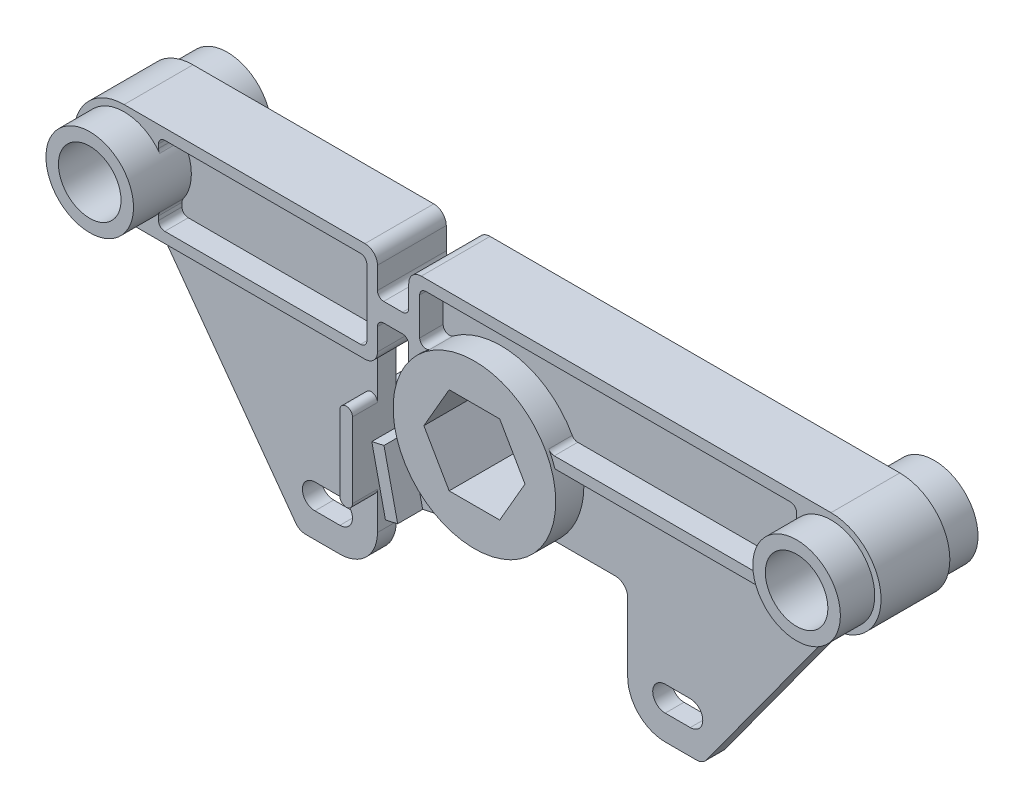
ISO-10303-21;
HEADER;
FILE_DESCRIPTION(('STEP AP214'),'2;1');
FILE_NAME('part.step','',(''),(''),'','','');
FILE_SCHEMA(('AUTOMOTIVE_DESIGN { 1 0 10303 214 1 1 1 1 }'));
ENDSEC;
DATA;
#1=APPLICATION_CONTEXT('core data for automotive mechanical design processes');
#2=APPLICATION_PROTOCOL_DEFINITION('international standard','automotive_design',2000,#1);
#3=PRODUCT_CONTEXT('',#1,'mechanical');
#4=PRODUCT('Part','Part','',(#3));
#5=PRODUCT_RELATED_PRODUCT_CATEGORY('part','',(#4));
#6=PRODUCT_DEFINITION_FORMATION('','',#4);
#7=PRODUCT_DEFINITION_CONTEXT('part definition',#1,'design');
#8=PRODUCT_DEFINITION('design','',#6,#7);
#9=PRODUCT_DEFINITION_SHAPE('','',#8);
#10=(LENGTH_UNIT() NAMED_UNIT(*) SI_UNIT(.MILLI.,.METRE.));
#11=(NAMED_UNIT(*) PLANE_ANGLE_UNIT() SI_UNIT($,.RADIAN.));
#12=(NAMED_UNIT(*) SI_UNIT($,.STERADIAN.) SOLID_ANGLE_UNIT());
#13=UNCERTAINTY_MEASURE_WITH_UNIT(LENGTH_MEASURE(1.E-05),#10,'distance_accuracy_value','');
#14=(GEOMETRIC_REPRESENTATION_CONTEXT(3) GLOBAL_UNCERTAINTY_ASSIGNED_CONTEXT((#13)) GLOBAL_UNIT_ASSIGNED_CONTEXT((#10,
#11,#12)) REPRESENTATION_CONTEXT('',''));
#15=CARTESIAN_POINT('',(0.,0.,0.));
#16=DIRECTION('',(0.,0.,1.));
#17=DIRECTION('',(1.,0.,0.));
#18=AXIS2_PLACEMENT_3D('',#15,#16,#17);
#19=CARTESIAN_POINT('',(0.,-4.5,1.5));
#20=DIRECTION('',(0.,0.,1.));
#21=DIRECTION('',(1.,0.,0.));
#22=AXIS2_PLACEMENT_3D('',#19,#20,#21);
#23=PLANE('',#22);
#24=DIRECTION('',(0.,1.,0.));
#25=VECTOR('',#24,1.);
#26=CARTESIAN_POINT('',(-20.,-4.5,1.5));
#27=LINE('',#26,#25);
#28=CARTESIAN_POINT('',(-20.,-23.,1.5));
#29=VERTEX_POINT('',#28);
#30=CARTESIAN_POINT('',(-20.,-17.,1.5));
#31=VERTEX_POINT('',#30);
#32=EDGE_CURVE('E967',#29,#31,#27,.T.);
#33=ORIENTED_EDGE('',*,*,#32,.T.);
#34=CARTESIAN_POINT('',(-21.,-17.,1.5));
#35=DIRECTION('',(0.,0.,1.));
#36=DIRECTION('',(1.,0.,0.));
#37=AXIS2_PLACEMENT_3D('',#34,#35,#36);
#38=CIRCLE('',#37,1.);
#39=CARTESIAN_POINT('',(-22.,-17.,1.5));
#40=VERTEX_POINT('',#39);
#41=EDGE_CURVE('E937',#31,#40,#38,.F.);
#42=ORIENTED_EDGE('',*,*,#41,.T.);
#43=DIRECTION('',(0.,1.,0.));
#44=VECTOR('',#43,1.);
#45=CARTESIAN_POINT('',(-22.,-4.5,1.5));
#46=LINE('',#45,#44);
#47=CARTESIAN_POINT('',(-22.,-5.00000000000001,1.5));
#48=VERTEX_POINT('',#47);
#49=EDGE_CURVE('E931',#40,#48,#46,.T.);
#50=ORIENTED_EDGE('',*,*,#49,.T.);
#51=CARTESIAN_POINT('',(-21.,-5.00000000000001,1.5));
#52=DIRECTION('',(0.,0.,1.));
#53=DIRECTION('',(1.,0.,0.));
#54=AXIS2_PLACEMENT_3D('',#51,#52,#53);
#55=CIRCLE('',#54,0.999999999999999);
#56=CARTESIAN_POINT('',(-20.,-5.00000000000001,1.5));
#57=VERTEX_POINT('',#56);
#58=EDGE_CURVE('E934',#48,#57,#55,.F.);
#59=ORIENTED_EDGE('',*,*,#58,.T.);
#60=CARTESIAN_POINT('',(-20.,4.,1.5));
#61=VERTEX_POINT('',#60);
#62=EDGE_CURVE('E959',#57,#61,#27,.T.);
#63=ORIENTED_EDGE('',*,*,#62,.T.);
#64=DIRECTION('',(1.,0.,0.));
#65=VECTOR('',#64,1.);
#66=CARTESIAN_POINT('',(-16.,4.,1.5));
#67=LINE('',#66,#65);
#68=CARTESIAN_POINT('',(-56.4759034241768,3.99999999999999,1.5));
#69=VERTEX_POINT('',#68);
#70=EDGE_CURVE('E982',#69,#61,#67,.T.);
#71=ORIENTED_EDGE('',*,*,#70,.F.);
#72=DIRECTION('',(0.587785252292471,-0.809016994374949,0.));
#73=VECTOR('',#72,1.);
#74=CARTESIAN_POINT('',(-56.8582218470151,4.52621616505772,1.5));
#75=LINE('',#74,#73);
#76=CARTESIAN_POINT('',(-33.098983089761,-28.175570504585,1.5));
#77=VERTEX_POINT('',#76);
#78=EDGE_CURVE('E955',#69,#77,#75,.T.);
#79=ORIENTED_EDGE('',*,*,#78,.T.);
#80=CARTESIAN_POINT('',(-31.4809491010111,-27.,1.5));
#81=DIRECTION('',(0.,0.,1.));
#82=DIRECTION('',(1.,0.,0.));
#83=AXIS2_PLACEMENT_3D('',#80,#81,#82);
#84=CIRCLE('',#83,2.00000000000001);
#85=CARTESIAN_POINT('',(-31.4809491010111,-29.,1.5));
#86=VERTEX_POINT('',#85);
#87=EDGE_CURVE('E963',#77,#86,#84,.T.);
#88=ORIENTED_EDGE('',*,*,#87,.T.);
#89=DIRECTION('',(1.,0.,0.));
#90=VECTOR('',#89,1.);
#91=CARTESIAN_POINT('',(0.,-29.,1.5));
#92=LINE('',#91,#90);
#93=CARTESIAN_POINT('',(-26.,-29.,1.5));
#94=VERTEX_POINT('',#93);
#95=EDGE_CURVE('E960',#86,#94,#92,.T.);
#96=ORIENTED_EDGE('',*,*,#95,.T.);
#97=CARTESIAN_POINT('',(-26.,-23.,1.5));
#98=DIRECTION('',(0.,0.,1.));
#99=DIRECTION('',(1.,0.,0.));
#100=AXIS2_PLACEMENT_3D('',#97,#98,#99);
#101=CIRCLE('',#100,6.);
#102=EDGE_CURVE('E956',#94,#29,#101,.T.);
#103=ORIENTED_EDGE('',*,*,#102,.T.);
#104=EDGE_LOOP('',(#33,#42,#50,#59,#63,#71,#79,#88,#96,#103));
#105=FACE_BOUND('',#104,.T.);
#106=DIRECTION('',(1.,0.,0.));
#107=VECTOR('',#106,1.);
#108=CARTESIAN_POINT('',(-26.,-21.,1.5));
#109=LINE('',#108,#107);
#110=CARTESIAN_POINT('',(-30.,-21.,1.5));
#111=VERTEX_POINT('',#110);
#112=CARTESIAN_POINT('',(-26.,-21.,1.5));
#113=VERTEX_POINT('',#112);
#114=EDGE_CURVE('E802',#111,#113,#109,.T.);
#115=ORIENTED_EDGE('',*,*,#114,.T.);
#116=CARTESIAN_POINT('',(-26.,-23.,1.5));
#117=DIRECTION('',(0.,0.,-1.));
#118=DIRECTION('',(-1.,0.,0.));
#119=AXIS2_PLACEMENT_3D('',#116,#117,#118);
#120=CIRCLE('',#119,2.);
#121=CARTESIAN_POINT('',(-26.,-25.,1.5));
#122=VERTEX_POINT('',#121);
#123=EDGE_CURVE('E793',#113,#122,#120,.T.);
#124=ORIENTED_EDGE('',*,*,#123,.T.);
#125=DIRECTION('',(-1.,0.,0.));
#126=VECTOR('',#125,1.);
#127=CARTESIAN_POINT('',(-26.,-25.,1.5));
#128=LINE('',#127,#126);
#129=CARTESIAN_POINT('',(-30.,-25.,1.5));
#130=VERTEX_POINT('',#129);
#131=EDGE_CURVE('E808',#122,#130,#128,.T.);
#132=ORIENTED_EDGE('',*,*,#131,.T.);
#133=CARTESIAN_POINT('',(-30.,-23.,1.5));
#134=DIRECTION('',(0.,0.,-1.));
#135=DIRECTION('',(-1.,0.,0.));
#136=AXIS2_PLACEMENT_3D('',#133,#134,#135);
#137=CIRCLE('',#136,2.);
#138=EDGE_CURVE('E805',#130,#111,#137,.T.);
#139=ORIENTED_EDGE('',*,*,#138,.T.);
#140=EDGE_LOOP('',(#115,#124,#132,#139));
#141=FACE_BOUND('',#140,.T.);
#142=ADVANCED_FACE('F35',(#105,#141),#23,.T.);
#143=CARTESIAN_POINT('',(0.,-4.5,-1.5));
#144=DIRECTION('',(0.,0.,1.));
#145=DIRECTION('',(1.,0.,0.));
#146=AXIS2_PLACEMENT_3D('',#143,#144,#145);
#147=PLANE('',#146);
#148=CARTESIAN_POINT('',(-21.,-17.,-1.5));
#149=DIRECTION('',(0.,0.,1.));
#150=DIRECTION('',(1.,0.,0.));
#151=AXIS2_PLACEMENT_3D('',#148,#149,#150);
#152=CIRCLE('',#151,1.);
#153=CARTESIAN_POINT('',(-20.,-17.,-1.5));
#154=VERTEX_POINT('',#153);
#155=CARTESIAN_POINT('',(-22.,-17.,-1.5));
#156=VERTEX_POINT('',#155);
#157=EDGE_CURVE('E1621',#154,#156,#152,.F.);
#158=ORIENTED_EDGE('',*,*,#157,.F.);
#159=DIRECTION('',(0.,1.,0.));
#160=VECTOR('',#159,1.);
#161=CARTESIAN_POINT('',(-20.,-4.5,-1.5));
#162=LINE('',#161,#160);
#163=CARTESIAN_POINT('',(-20.,-23.,-1.5));
#164=VERTEX_POINT('',#163);
#165=EDGE_CURVE('E952',#164,#154,#162,.T.);
#166=ORIENTED_EDGE('',*,*,#165,.F.);
#167=CARTESIAN_POINT('',(-26.,-23.,-1.5));
#168=DIRECTION('',(0.,0.,1.));
#169=DIRECTION('',(1.,0.,0.));
#170=AXIS2_PLACEMENT_3D('',#167,#168,#169);
#171=CIRCLE('',#170,6.);
#172=CARTESIAN_POINT('',(-26.,-29.,-1.5));
#173=VERTEX_POINT('',#172);
#174=EDGE_CURVE('E941',#173,#164,#171,.T.);
#175=ORIENTED_EDGE('',*,*,#174,.F.);
#176=DIRECTION('',(1.,0.,0.));
#177=VECTOR('',#176,1.);
#178=CARTESIAN_POINT('',(0.,-29.,-1.5));
#179=LINE('',#178,#177);
#180=CARTESIAN_POINT('',(-31.4809491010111,-29.,-1.5));
#181=VERTEX_POINT('',#180);
#182=EDGE_CURVE('E945',#181,#173,#179,.T.);
#183=ORIENTED_EDGE('',*,*,#182,.F.);
#184=CARTESIAN_POINT('',(-31.4809491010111,-27.,-1.5));
#185=DIRECTION('',(0.,0.,1.));
#186=DIRECTION('',(1.,0.,0.));
#187=AXIS2_PLACEMENT_3D('',#184,#185,#186);
#188=CIRCLE('',#187,2.00000000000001);
#189=CARTESIAN_POINT('',(-33.098983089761,-28.175570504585,-1.5));
#190=VERTEX_POINT('',#189);
#191=EDGE_CURVE('E948',#190,#181,#188,.T.);
#192=ORIENTED_EDGE('',*,*,#191,.F.);
#193=DIRECTION('',(0.587785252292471,-0.809016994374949,0.));
#194=VECTOR('',#193,1.);
#195=CARTESIAN_POINT('',(-56.8582218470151,4.52621616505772,-1.5));
#196=LINE('',#195,#194);
#197=CARTESIAN_POINT('',(-56.4759034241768,4.,-1.5));
#198=VERTEX_POINT('',#197);
#199=EDGE_CURVE('E940',#198,#190,#196,.T.);
#200=ORIENTED_EDGE('',*,*,#199,.F.);
#201=DIRECTION('',(1.,0.,0.));
#202=VECTOR('',#201,1.);
#203=CARTESIAN_POINT('',(-16.,4.,-1.5));
#204=LINE('',#203,#202);
#205=CARTESIAN_POINT('',(-20.,4.,-1.5));
#206=VERTEX_POINT('',#205);
#207=EDGE_CURVE('E978',#198,#206,#204,.T.);
#208=ORIENTED_EDGE('',*,*,#207,.T.);
#209=CARTESIAN_POINT('',(-20.,-5.00000000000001,-1.5));
#210=VERTEX_POINT('',#209);
#211=EDGE_CURVE('E944',#210,#206,#162,.T.);
#212=ORIENTED_EDGE('',*,*,#211,.F.);
#213=CARTESIAN_POINT('',(-21.,-5.00000000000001,-1.5));
#214=DIRECTION('',(0.,0.,1.));
#215=DIRECTION('',(1.,0.,0.));
#216=AXIS2_PLACEMENT_3D('',#213,#214,#215);
#217=CIRCLE('',#216,0.999999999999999);
#218=CARTESIAN_POINT('',(-22.,-5.00000000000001,-1.5));
#219=VERTEX_POINT('',#218);
#220=EDGE_CURVE('E1618',#219,#210,#217,.F.);
#221=ORIENTED_EDGE('',*,*,#220,.F.);
#222=DIRECTION('',(0.,1.,0.));
#223=VECTOR('',#222,1.);
#224=CARTESIAN_POINT('',(-22.,-4.5,-1.5));
#225=LINE('',#224,#223);
#226=EDGE_CURVE('E1615',#156,#219,#225,.T.);
#227=ORIENTED_EDGE('',*,*,#226,.F.);
#228=EDGE_LOOP('',(#158,#166,#175,#183,#192,#200,#208,#212,#221,#227));
#229=FACE_BOUND('',#228,.T.);
#230=CARTESIAN_POINT('',(-26.,-23.,-1.5));
#231=DIRECTION('',(0.,0.,1.));
#232=DIRECTION('',(1.,0.,0.));
#233=AXIS2_PLACEMENT_3D('',#230,#231,#232);
#234=CIRCLE('',#233,2.);
#235=CARTESIAN_POINT('',(-26.,-21.,-1.5));
#236=VERTEX_POINT('',#235);
#237=CARTESIAN_POINT('',(-26.,-25.,-1.5));
#238=VERTEX_POINT('',#237);
#239=EDGE_CURVE('E1656',#236,#238,#234,.F.);
#240=ORIENTED_EDGE('',*,*,#239,.F.);
#241=DIRECTION('',(1.,0.,0.));
#242=VECTOR('',#241,1.);
#243=CARTESIAN_POINT('',(0.,-21.,-1.5));
#244=LINE('',#243,#242);
#245=CARTESIAN_POINT('',(-30.,-21.,-1.5));
#246=VERTEX_POINT('',#245);
#247=EDGE_CURVE('E1649',#246,#236,#244,.T.);
#248=ORIENTED_EDGE('',*,*,#247,.F.);
#249=CARTESIAN_POINT('',(-30.,-23.,-1.5));
#250=DIRECTION('',(0.,0.,1.));
#251=DIRECTION('',(1.,0.,0.));
#252=AXIS2_PLACEMENT_3D('',#249,#250,#251);
#253=CIRCLE('',#252,2.);
#254=CARTESIAN_POINT('',(-30.,-25.,-1.5));
#255=VERTEX_POINT('',#254);
#256=EDGE_CURVE('E1651',#255,#246,#253,.F.);
#257=ORIENTED_EDGE('',*,*,#256,.F.);
#258=DIRECTION('',(-1.,0.,0.));
#259=VECTOR('',#258,1.);
#260=CARTESIAN_POINT('',(0.,-25.,-1.5));
#261=LINE('',#260,#259);
#262=EDGE_CURVE('E1654',#238,#255,#261,.T.);
#263=ORIENTED_EDGE('',*,*,#262,.F.);
#264=EDGE_LOOP('',(#240,#248,#257,#263));
#265=FACE_BOUND('',#264,.T.);
#266=ADVANCED_FACE('F1695',(#229,#265),#147,.F.);
#267=CARTESIAN_POINT('',(0.,-4.5,1.5));
#268=DIRECTION('',(0.,0.,1.));
#269=DIRECTION('',(1.,0.,0.));
#270=AXIS2_PLACEMENT_3D('',#267,#268,#269);
#271=PLANE('',#270);
#272=DIRECTION('',(0.975830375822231,0.218529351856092,0.));
#273=VECTOR('',#272,1.);
#274=CARTESIAN_POINT('',(-16.9093587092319,-6.86101946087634,1.5));
#275=LINE('',#274,#273);
#276=CARTESIAN_POINT('',(-14.9576979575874,-6.42396075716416,1.5));
#277=VERTEX_POINT('',#276);
#278=CARTESIAN_POINT('',(-13.9493036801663,-6.19813898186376,1.5));
#279=VERTEX_POINT('',#278);
#280=EDGE_CURVE('E876',#277,#279,#275,.T.);
#281=ORIENTED_EDGE('',*,*,#280,.F.);
#282=DIRECTION('',(0.218529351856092,-0.975830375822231,0.));
#283=VECTOR('',#282,1.);
#284=CARTESIAN_POINT('',(-14.6536719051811,-7.78157178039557,1.5));
#285=LINE('',#284,#283);
#286=CARTESIAN_POINT('',(-12.7724044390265,-16.1822645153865,1.5));
#287=VERTEX_POINT('',#286);
#288=EDGE_CURVE('E870',#277,#287,#285,.T.);
#289=ORIENTED_EDGE('',*,*,#288,.T.);
#290=DIRECTION('',(-0.975830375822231,-0.218529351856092,0.));
#291=VECTOR('',#290,1.);
#292=CARTESIAN_POINT('',(2.84088157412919,-12.685794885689,1.5));
#293=LINE('',#292,#291);
#294=CARTESIAN_POINT('',(2.84088157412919,-12.685794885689,1.5));
#295=VERTEX_POINT('',#294);
#296=EDGE_CURVE('E879',#295,#287,#293,.T.);
#297=ORIENTED_EDGE('',*,*,#296,.F.);
#298=CARTESIAN_POINT('',(0.,0.,1.5));
#299=DIRECTION('',(0.,0.,1.));
#300=DIRECTION('',(1.,0.,0.));
#301=AXIS2_PLACEMENT_3D('',#298,#299,#300);
#302=CIRCLE('',#301,13.);
#303=CARTESIAN_POINT('',(-12.4681807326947,-3.68028113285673,1.5));
#304=VERTEX_POINT('',#303);
#305=EDGE_CURVE('E894',#304,#295,#302,.T.);
#306=ORIENTED_EDGE('',*,*,#305,.F.);
#307=CARTESIAN_POINT('',(-14.3863623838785,-4.2464782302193,1.5));
#308=DIRECTION('',(0.,0.,1.));
#309=DIRECTION('',(1.,0.,0.));
#310=AXIS2_PLACEMENT_3D('',#307,#308,#309);
#311=CIRCLE('',#310,2.);
#312=EDGE_CURVE('E1632',#304,#279,#311,.F.);
#313=ORIENTED_EDGE('',*,*,#312,.T.);
#314=EDGE_LOOP('',(#281,#289,#297,#306,#313));
#315=FACE_BOUND('',#314,.T.);
#316=ADVANCED_FACE('F1701',(#315),#271,.T.);
#317=CARTESIAN_POINT('',(0.,-4.5,-1.5));
#318=DIRECTION('',(0.,0.,1.));
#319=DIRECTION('',(1.,0.,0.));
#320=AXIS2_PLACEMENT_3D('',#317,#318,#319);
#321=PLANE('',#320);
#322=DIRECTION('',(0.218529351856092,-0.975830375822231,0.));
#323=VECTOR('',#322,1.);
#324=CARTESIAN_POINT('',(-14.6536719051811,-7.78157178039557,-1.5));
#325=LINE('',#324,#323);
#326=CARTESIAN_POINT('',(-14.9576979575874,-6.42396075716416,-1.5));
#327=VERTEX_POINT('',#326);
#328=CARTESIAN_POINT('',(-12.7724044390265,-16.1822645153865,-1.5));
#329=VERTEX_POINT('',#328);
#330=EDGE_CURVE('E1624',#327,#329,#325,.T.);
#331=ORIENTED_EDGE('',*,*,#330,.F.);
#332=DIRECTION('',(0.975830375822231,0.218529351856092,0.));
#333=VECTOR('',#332,1.);
#334=CARTESIAN_POINT('',(-16.9093587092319,-6.86101946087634,-1.5));
#335=LINE('',#334,#333);
#336=CARTESIAN_POINT('',(-13.9493036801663,-6.19813898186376,-1.5));
#337=VERTEX_POINT('',#336);
#338=EDGE_CURVE('E873',#327,#337,#335,.T.);
#339=ORIENTED_EDGE('',*,*,#338,.T.);
#340=CARTESIAN_POINT('',(-14.3863623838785,-4.2464782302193,-1.5));
#341=DIRECTION('',(0.,0.,1.));
#342=DIRECTION('',(1.,0.,0.));
#343=AXIS2_PLACEMENT_3D('',#340,#341,#342);
#344=CIRCLE('',#343,2.);
#345=CARTESIAN_POINT('',(-12.4681807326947,-3.68028113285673,-1.5));
#346=VERTEX_POINT('',#345);
#347=EDGE_CURVE('E1634',#337,#346,#344,.T.);
#348=ORIENTED_EDGE('',*,*,#347,.T.);
#349=CARTESIAN_POINT('',(0.,0.,-1.5));
#350=DIRECTION('',(0.,0.,1.));
#351=DIRECTION('',(1.,0.,0.));
#352=AXIS2_PLACEMENT_3D('',#349,#350,#351);
#353=CIRCLE('',#352,13.);
#354=CARTESIAN_POINT('',(2.84088157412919,-12.685794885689,-1.5));
#355=VERTEX_POINT('',#354);
#356=EDGE_CURVE('E888',#346,#355,#353,.T.);
#357=ORIENTED_EDGE('',*,*,#356,.T.);
#358=DIRECTION('',(-0.975830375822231,-0.218529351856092,0.));
#359=VECTOR('',#358,1.);
#360=CARTESIAN_POINT('',(2.84088157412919,-12.685794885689,-1.5));
#361=LINE('',#360,#359);
#362=EDGE_CURVE('E874',#355,#329,#361,.T.);
#363=ORIENTED_EDGE('',*,*,#362,.T.);
#364=EDGE_LOOP('',(#331,#339,#348,#357,#363));
#365=FACE_BOUND('',#364,.T.);
#366=ADVANCED_FACE('F2803',(#365),#321,.F.);
#367=CARTESIAN_POINT('',(0.,0.,6.));
#368=DIRECTION('',(0.,0.,-1.));
#369=DIRECTION('',(-1.,0.,0.));
#370=AXIS2_PLACEMENT_3D('',#367,#368,#369);
#371=CYLINDRICAL_SURFACE('',#370,13.);
#372=DIRECTION('',(0.,0.,-1.));
#373=VECTOR('',#372,1.);
#374=CARTESIAN_POINT('',(8.30662386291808,-10.,6.));
#375=LINE('',#374,#373);
#376=CARTESIAN_POINT('',(8.30662386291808,-10.,-1.5));
#377=VERTEX_POINT('',#376);
#378=CARTESIAN_POINT('',(8.30662386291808,-10.,1.5));
#379=VERTEX_POINT('',#378);
#380=EDGE_CURVE('E1609',#377,#379,#375,.F.);
#381=ORIENTED_EDGE('',*,*,#380,.T.);
#382=CARTESIAN_POINT('',(0.,0.,1.5));
#383=DIRECTION('',(0.,0.,1.));
#384=DIRECTION('',(1.,0.,0.));
#385=AXIS2_PLACEMENT_3D('',#382,#383,#384);
#386=CIRCLE('',#385,13.);
#387=CARTESIAN_POINT('',(12.369316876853,4.,1.5));
#388=VERTEX_POINT('',#387);
#389=EDGE_CURVE('E1043',#379,#388,#386,.T.);
#390=ORIENTED_EDGE('',*,*,#389,.T.);
#391=DIRECTION('',(0.,0.,-1.));
#392=VECTOR('',#391,1.);
#393=CARTESIAN_POINT('',(12.369316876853,4.,6.));
#394=LINE('',#393,#392);
#395=CARTESIAN_POINT('',(12.369316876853,4.,5.5));
#396=VERTEX_POINT('',#395);
#397=EDGE_CURVE('E1300',#396,#388,#394,.T.);
#398=ORIENTED_EDGE('',*,*,#397,.F.);
#399=CARTESIAN_POINT('',(0.,0.,5.5));
#400=DIRECTION('',(0.,0.,1.));
#401=DIRECTION('',(1.,0.,0.));
#402=AXIS2_PLACEMENT_3D('',#399,#400,#401);
#403=CIRCLE('',#402,13.);
#404=CARTESIAN_POINT('',(11.3892039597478,6.26785714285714,5.5));
#405=VERTEX_POINT('',#404);
#406=EDGE_CURVE('E1306',#396,#405,#403,.T.);
#407=ORIENTED_EDGE('',*,*,#406,.T.);
#408=DIRECTION('',(0.,0.,-1.));
#409=VECTOR('',#408,1.);
#410=CARTESIAN_POINT('',(11.3892039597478,6.26785714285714,6.));
#411=LINE('',#410,#409);
#412=CARTESIAN_POINT('',(11.3892039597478,6.26785714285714,1.75));
#413=VERTEX_POINT('',#412);
#414=EDGE_CURVE('E1356',#405,#413,#411,.T.);
#415=ORIENTED_EDGE('',*,*,#414,.T.);
#416=CARTESIAN_POINT('',(0.,0.,1.75));
#417=DIRECTION('',(0.,0.,-1.));
#418=DIRECTION('',(1.,0.,0.));
#419=AXIS2_PLACEMENT_3D('',#416,#417,#418);
#420=CIRCLE('',#419,13.);
#421=CARTESIAN_POINT('',(-7.66071428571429,10.5030213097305,1.75));
#422=VERTEX_POINT('',#421);
#423=EDGE_CURVE('E1133',#422,#413,#420,.T.);
#424=ORIENTED_EDGE('',*,*,#423,.F.);
#425=DIRECTION('',(0.,0.,-1.));
#426=VECTOR('',#425,1.);
#427=CARTESIAN_POINT('',(-7.66071428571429,10.5030213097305,6.));
#428=LINE('',#427,#426);
#429=CARTESIAN_POINT('',(-7.66071428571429,10.5030213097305,5.5));
#430=VERTEX_POINT('',#429);
#431=EDGE_CURVE('E1358',#422,#430,#428,.F.);
#432=ORIENTED_EDGE('',*,*,#431,.T.);
#433=CARTESIAN_POINT('',(-11.,6.92820323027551,5.5));
#434=VERTEX_POINT('',#433);
#435=EDGE_CURVE('E1305',#430,#434,#403,.T.);
#436=ORIENTED_EDGE('',*,*,#435,.T.);
#437=DIRECTION('',(0.,0.,-1.));
#438=VECTOR('',#437,1.);
#439=CARTESIAN_POINT('',(-11.,6.92820323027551,6.));
#440=LINE('',#439,#438);
#441=CARTESIAN_POINT('',(-11.,6.92820323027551,-5.5));
#442=VERTEX_POINT('',#441);
#443=EDGE_CURVE('E1303',#442,#434,#440,.F.);
#444=ORIENTED_EDGE('',*,*,#443,.F.);
#445=CARTESIAN_POINT('',(0.,0.,-5.5));
#446=DIRECTION('',(0.,0.,1.));
#447=DIRECTION('',(1.,0.,0.));
#448=AXIS2_PLACEMENT_3D('',#445,#446,#447);
#449=CIRCLE('',#448,13.);
#450=CARTESIAN_POINT('',(-7.66071428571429,10.5030213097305,-5.5));
#451=VERTEX_POINT('',#450);
#452=EDGE_CURVE('E1296',#451,#442,#449,.T.);
#453=ORIENTED_EDGE('',*,*,#452,.F.);
#454=DIRECTION('',(0.,0.,-1.));
#455=VECTOR('',#454,1.);
#456=CARTESIAN_POINT('',(-7.66071428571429,10.5030213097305,6.));
#457=LINE('',#456,#455);
#458=CARTESIAN_POINT('',(-7.66071428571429,10.5030213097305,-1.75));
#459=VERTEX_POINT('',#458);
#460=EDGE_CURVE('E1479',#451,#459,#457,.F.);
#461=ORIENTED_EDGE('',*,*,#460,.T.);
#462=CARTESIAN_POINT('',(0.,0.,-1.75));
#463=DIRECTION('',(0.,0.,-1.));
#464=DIRECTION('',(1.,0.,0.));
#465=AXIS2_PLACEMENT_3D('',#462,#463,#464);
#466=CIRCLE('',#465,13.);
#467=CARTESIAN_POINT('',(11.3892039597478,6.26785714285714,-1.75));
#468=VERTEX_POINT('',#467);
#469=EDGE_CURVE('E1064',#459,#468,#466,.T.);
#470=ORIENTED_EDGE('',*,*,#469,.T.);
#471=DIRECTION('',(0.,0.,-1.));
#472=VECTOR('',#471,1.);
#473=CARTESIAN_POINT('',(11.3892039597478,6.26785714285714,6.));
#474=LINE('',#473,#472);
#475=CARTESIAN_POINT('',(11.3892039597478,6.26785714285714,-5.5));
#476=VERTEX_POINT('',#475);
#477=EDGE_CURVE('E1476',#468,#476,#474,.T.);
#478=ORIENTED_EDGE('',*,*,#477,.T.);
#479=CARTESIAN_POINT('',(12.369316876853,4.,-5.5));
#480=VERTEX_POINT('',#479);
#481=EDGE_CURVE('E1297',#480,#476,#449,.T.);
#482=ORIENTED_EDGE('',*,*,#481,.F.);
#483=CARTESIAN_POINT('',(12.369316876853,4.,-1.5));
#484=VERTEX_POINT('',#483);
#485=EDGE_CURVE('E1299',#484,#480,#394,.T.);
#486=ORIENTED_EDGE('',*,*,#485,.F.);
#487=CARTESIAN_POINT('',(0.,0.,-1.5));
#488=DIRECTION('',(0.,0.,1.));
#489=DIRECTION('',(1.,0.,0.));
#490=AXIS2_PLACEMENT_3D('',#487,#488,#489);
#491=CIRCLE('',#490,13.);
#492=EDGE_CURVE('E1039',#377,#484,#491,.T.);
#493=ORIENTED_EDGE('',*,*,#492,.F.);
#494=EDGE_LOOP('',(#381,#390,#398,#407,#415,#424,#432,#436,#444,#453,#461,#470,#478,#482,#486,#493));
#495=FACE_BOUND('',#494,.T.);
#496=CARTESIAN_POINT('',(0.,0.,-6.));
#497=DIRECTION('',(0.,0.,1.));
#498=DIRECTION('',(1.,0.,0.));
#499=AXIS2_PLACEMENT_3D('',#496,#497,#498);
#500=CIRCLE('',#499,13.);
#501=CARTESIAN_POINT('',(13.,0.,-6.));
#502=VERTEX_POINT('',#501);
#503=EDGE_CURVE('E1290',#502,#502,#500,.T.);
#504=ORIENTED_EDGE('',*,*,#503,.T.);
#505=EDGE_LOOP('',(#504));
#506=FACE_BOUND('',#505,.T.);
#507=CARTESIAN_POINT('',(0.,0.,6.));
#508=DIRECTION('',(0.,0.,1.));
#509=DIRECTION('',(1.,0.,0.));
#510=AXIS2_PLACEMENT_3D('',#507,#508,#509);
#511=CIRCLE('',#510,13.);
#512=CARTESIAN_POINT('',(13.,0.,6.));
#513=VERTEX_POINT('',#512);
#514=EDGE_CURVE('E1293',#513,#513,#511,.T.);
#515=ORIENTED_EDGE('',*,*,#514,.F.);
#516=EDGE_LOOP('',(#515));
#517=FACE_BOUND('',#516,.T.);
#518=DIRECTION('',(0.,0.,-1.));
#519=VECTOR('',#518,1.);
#520=CARTESIAN_POINT('',(-12.4681807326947,-3.68028113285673,6.));
#521=LINE('',#520,#519);
#522=EDGE_CURVE('E1627',#346,#304,#521,.F.);
#523=ORIENTED_EDGE('',*,*,#522,.T.);
#524=ORIENTED_EDGE('',*,*,#305,.T.);
#525=DIRECTION('',(0.,0.,-1.));
#526=VECTOR('',#525,1.);
#527=CARTESIAN_POINT('',(2.84088157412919,-12.685794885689,6.));
#528=LINE('',#527,#526);
#529=EDGE_CURVE('E891',#355,#295,#528,.F.);
#530=ORIENTED_EDGE('',*,*,#529,.F.);
#531=ORIENTED_EDGE('',*,*,#356,.F.);
#532=EDGE_LOOP('',(#523,#524,#530,#531));
#533=FACE_BOUND('',#532,.T.);
#534=ADVANCED_FACE('F37',(#495,#506,#517,#533),#371,.T.);
#535=CARTESIAN_POINT('',(56.5,12.,-5.5));
#536=DIRECTION('',(0.,0.,1.));
#537=DIRECTION('',(1.,0.,0.));
#538=AXIS2_PLACEMENT_3D('',#535,#536,#537);
#539=PLANE('',#538);
#540=DIRECTION('',(-1.,0.,0.));
#541=VECTOR('',#540,1.);
#542=CARTESIAN_POINT('',(-17.7,18.3,-5.5));
#543=LINE('',#542,#541);
#544=CARTESIAN_POINT('',(-18.7,18.3,-5.5));
#545=VERTEX_POINT('',#544);
#546=CARTESIAN_POINT('',(-50.,18.3,-5.5));
#547=VERTEX_POINT('',#546);
#548=EDGE_CURVE('E1094',#545,#547,#543,.T.);
#549=ORIENTED_EDGE('',*,*,#548,.T.);
#550=CARTESIAN_POINT('',(-50.,17.3,-5.5));
#551=DIRECTION('',(0.,0.,1.));
#552=DIRECTION('',(1.,0.,0.));
#553=AXIS2_PLACEMENT_3D('',#550,#551,#552);
#554=CIRCLE('',#553,1.);
#555=CARTESIAN_POINT('',(-51.,17.3,-5.5));
#556=VERTEX_POINT('',#555);
#557=EDGE_CURVE('E1547',#547,#556,#554,.T.);
#558=ORIENTED_EDGE('',*,*,#557,.T.);
#559=DIRECTION('',(0.,-1.,0.));
#560=VECTOR('',#559,1.);
#561=CARTESIAN_POINT('',(-51.,18.3,-5.5));
#562=LINE('',#561,#560);
#563=CARTESIAN_POINT('',(-51.,16.6636895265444,-5.5));
#564=VERTEX_POINT('',#563);
#565=EDGE_CURVE('E1091',#556,#564,#562,.T.);
#566=ORIENTED_EDGE('',*,*,#565,.T.);
#567=CARTESIAN_POINT('',(-50.,16.6636895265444,-5.5));
#568=DIRECTION('',(0.,0.,1.));
#569=DIRECTION('',(1.,0.,0.));
#570=AXIS2_PLACEMENT_3D('',#567,#568,#569);
#571=CIRCLE('',#570,1.);
#572=CARTESIAN_POINT('',(-50.8125,16.0807283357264,-5.5));
#573=VERTEX_POINT('',#572);
#574=EDGE_CURVE('E1549',#564,#573,#571,.T.);
#575=ORIENTED_EDGE('',*,*,#574,.T.);
#576=CARTESIAN_POINT('',(-56.5,12.,-5.5));
#577=DIRECTION('',(0.,0.,1.));
#578=DIRECTION('',(1.,0.,0.));
#579=AXIS2_PLACEMENT_3D('',#576,#577,#578);
#580=CIRCLE('',#579,7.);
#581=CARTESIAN_POINT('',(-50.8125,7.91927166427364,-5.5));
#582=VERTEX_POINT('',#581);
#583=EDGE_CURVE('E1310',#582,#573,#580,.F.);
#584=ORIENTED_EDGE('',*,*,#583,.F.);
#585=CARTESIAN_POINT('',(-50.,7.33631047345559,-5.5));
#586=DIRECTION('',(0.,0.,1.));
#587=DIRECTION('',(1.,0.,0.));
#588=AXIS2_PLACEMENT_3D('',#585,#586,#587);
#589=CIRCLE('',#588,1.);
#590=CARTESIAN_POINT('',(-51.,7.33631047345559,-5.5));
#591=VERTEX_POINT('',#590);
#592=EDGE_CURVE('E1539',#582,#591,#589,.T.);
#593=ORIENTED_EDGE('',*,*,#592,.T.);
#594=DIRECTION('',(0.,-1.,0.));
#595=VECTOR('',#594,1.);
#596=CARTESIAN_POINT('',(-51.,7.6698729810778,-5.5));
#597=LINE('',#596,#595);
#598=CARTESIAN_POINT('',(-51.,6.7,-5.5));
#599=VERTEX_POINT('',#598);
#600=EDGE_CURVE('E1088',#591,#599,#597,.T.);
#601=ORIENTED_EDGE('',*,*,#600,.T.);
#602=CARTESIAN_POINT('',(-50.,6.7,-5.5));
#603=DIRECTION('',(0.,0.,1.));
#604=DIRECTION('',(1.,0.,0.));
#605=AXIS2_PLACEMENT_3D('',#602,#603,#604);
#606=CIRCLE('',#605,1.);
#607=CARTESIAN_POINT('',(-50.,5.7,-5.5));
#608=VERTEX_POINT('',#607);
#609=EDGE_CURVE('E1541',#599,#608,#606,.T.);
#610=ORIENTED_EDGE('',*,*,#609,.T.);
#611=DIRECTION('',(1.,0.,0.));
#612=VECTOR('',#611,1.);
#613=CARTESIAN_POINT('',(-51.,5.7,-5.5));
#614=LINE('',#613,#612);
#615=CARTESIAN_POINT('',(-18.7,5.7,-5.5));
#616=VERTEX_POINT('',#615);
#617=EDGE_CURVE('E1085',#608,#616,#614,.T.);
#618=ORIENTED_EDGE('',*,*,#617,.T.);
#619=CARTESIAN_POINT('',(-18.7,6.7,-5.5));
#620=DIRECTION('',(0.,0.,1.));
#621=DIRECTION('',(1.,0.,0.));
#622=AXIS2_PLACEMENT_3D('',#619,#620,#621);
#623=CIRCLE('',#622,1.);
#624=CARTESIAN_POINT('',(-17.7,6.7,-5.5));
#625=VERTEX_POINT('',#624);
#626=EDGE_CURVE('E1543',#616,#625,#623,.T.);
#627=ORIENTED_EDGE('',*,*,#626,.T.);
#628=DIRECTION('',(0.,1.,0.));
#629=VECTOR('',#628,1.);
#630=CARTESIAN_POINT('',(-17.7,5.7,-5.5));
#631=LINE('',#630,#629);
#632=CARTESIAN_POINT('',(-17.7,17.3,-5.5));
#633=VERTEX_POINT('',#632);
#634=EDGE_CURVE('E1097',#625,#633,#631,.T.);
#635=ORIENTED_EDGE('',*,*,#634,.T.);
#636=CARTESIAN_POINT('',(-18.7,17.3,-5.5));
#637=DIRECTION('',(0.,0.,1.));
#638=DIRECTION('',(1.,0.,0.));
#639=AXIS2_PLACEMENT_3D('',#636,#637,#638);
#640=CIRCLE('',#639,1.);
#641=EDGE_CURVE('E1545',#633,#545,#640,.T.);
#642=ORIENTED_EDGE('',*,*,#641,.T.);
#643=EDGE_LOOP('',(#549,#558,#566,#575,#584,#593,#601,#610,#618,#627,#635,#642));
#644=FACE_BOUND('',#643,.T.);
#645=DIRECTION('',(0.,1.,0.));
#646=VECTOR('',#645,1.);
#647=CARTESIAN_POINT('',(-16.,10.5,-5.5));
#648=LINE('',#647,#646);
#649=CARTESIAN_POINT('',(-16.,6.,-5.5));
#650=VERTEX_POINT('',#649);
#651=CARTESIAN_POINT('',(-16.,9.49999999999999,-5.5));
#652=VERTEX_POINT('',#651);
#653=EDGE_CURVE('E1238',#650,#652,#648,.T.);
#654=ORIENTED_EDGE('',*,*,#653,.F.);
#655=CARTESIAN_POINT('',(-18.,6.,-5.5));
#656=DIRECTION('',(0.,0.,1.));
#657=DIRECTION('',(1.,0.,0.));
#658=AXIS2_PLACEMENT_3D('',#655,#656,#657);
#659=CIRCLE('',#658,2.);
#660=CARTESIAN_POINT('',(-18.,4.,-5.5));
#661=VERTEX_POINT('',#660);
#662=EDGE_CURVE('E1559',#650,#661,#659,.F.);
#663=ORIENTED_EDGE('',*,*,#662,.T.);
#664=DIRECTION('',(1.,0.,0.));
#665=VECTOR('',#664,1.);
#666=CARTESIAN_POINT('',(-16.,4.,-5.5));
#667=LINE('',#666,#665);
#668=CARTESIAN_POINT('',(-56.5,4.,-5.5));
#669=VERTEX_POINT('',#668);
#670=EDGE_CURVE('E1235',#669,#661,#667,.T.);
#671=ORIENTED_EDGE('',*,*,#670,.F.);
#672=CARTESIAN_POINT('',(-56.5,12.,-5.5));
#673=DIRECTION('',(0.,0.,1.));
#674=DIRECTION('',(1.,0.,0.));
#675=AXIS2_PLACEMENT_3D('',#672,#673,#674);
#676=CIRCLE('',#675,8.);
#677=CARTESIAN_POINT('',(-56.5,20.,-5.5));
#678=VERTEX_POINT('',#677);
#679=EDGE_CURVE('E1232',#678,#669,#676,.T.);
#680=ORIENTED_EDGE('',*,*,#679,.F.);
#681=DIRECTION('',(-1.,0.,0.));
#682=VECTOR('',#681,1.);
#683=CARTESIAN_POINT('',(-16.,20.,-5.5));
#684=LINE('',#683,#682);
#685=CARTESIAN_POINT('',(-18.,20.,-5.5));
#686=VERTEX_POINT('',#685);
#687=EDGE_CURVE('E1229',#686,#678,#684,.T.);
#688=ORIENTED_EDGE('',*,*,#687,.F.);
#689=CARTESIAN_POINT('',(-18.,18.,-5.5));
#690=DIRECTION('',(0.,0.,1.));
#691=DIRECTION('',(1.,0.,0.));
#692=AXIS2_PLACEMENT_3D('',#689,#690,#691);
#693=CIRCLE('',#692,2.);
#694=CARTESIAN_POINT('',(-16.,18.,-5.5));
#695=VERTEX_POINT('',#694);
#696=EDGE_CURVE('E1556',#686,#695,#693,.F.);
#697=ORIENTED_EDGE('',*,*,#696,.T.);
#698=DIRECTION('',(0.,1.,0.));
#699=VECTOR('',#698,1.);
#700=CARTESIAN_POINT('',(-16.,20.,-5.5));
#701=LINE('',#700,#699);
#702=CARTESIAN_POINT('',(-16.,14.5,-5.5));
#703=VERTEX_POINT('',#702);
#704=EDGE_CURVE('E1227',#703,#695,#701,.T.);
#705=ORIENTED_EDGE('',*,*,#704,.F.);
#706=CARTESIAN_POINT('',(-15.,14.5,-5.5));
#707=DIRECTION('',(0.,0.,1.));
#708=DIRECTION('',(1.,0.,0.));
#709=AXIS2_PLACEMENT_3D('',#706,#707,#708);
#710=CIRCLE('',#709,1.);
#711=CARTESIAN_POINT('',(-15.,13.5,-5.5));
#712=VERTEX_POINT('',#711);
#713=EDGE_CURVE('E1601',#703,#712,#710,.T.);
#714=ORIENTED_EDGE('',*,*,#713,.T.);
#715=DIRECTION('',(-1.,0.,0.));
#716=VECTOR('',#715,1.);
#717=CARTESIAN_POINT('',(-16.,13.5,-5.5));
#718=LINE('',#717,#716);
#719=CARTESIAN_POINT('',(-12.,13.5,-5.5));
#720=VERTEX_POINT('',#719);
#721=EDGE_CURVE('E1224',#720,#712,#718,.T.);
#722=ORIENTED_EDGE('',*,*,#721,.F.);
#723=CARTESIAN_POINT('',(-12.,14.5,-5.5));
#724=DIRECTION('',(0.,0.,1.));
#725=DIRECTION('',(1.,0.,0.));
#726=AXIS2_PLACEMENT_3D('',#723,#724,#725);
#727=CIRCLE('',#726,1.);
#728=CARTESIAN_POINT('',(-11.,14.5,-5.5));
#729=VERTEX_POINT('',#728);
#730=EDGE_CURVE('E1597',#720,#729,#727,.T.);
#731=ORIENTED_EDGE('',*,*,#730,.T.);
#732=DIRECTION('',(0.,-1.,0.));
#733=VECTOR('',#732,1.);
#734=CARTESIAN_POINT('',(-11.,20.,-5.5));
#735=LINE('',#734,#733);
#736=CARTESIAN_POINT('',(-11.,18.,-5.5));
#737=VERTEX_POINT('',#736);
#738=EDGE_CURVE('E1221',#737,#729,#735,.T.);
#739=ORIENTED_EDGE('',*,*,#738,.F.);
#740=CARTESIAN_POINT('',(-9.,18.,-5.5));
#741=DIRECTION('',(0.,0.,1.));
#742=DIRECTION('',(1.,0.,0.));
#743=AXIS2_PLACEMENT_3D('',#740,#741,#742);
#744=CIRCLE('',#743,2.);
#745=CARTESIAN_POINT('',(-9.,20.,-5.5));
#746=VERTEX_POINT('',#745);
#747=EDGE_CURVE('E1554',#737,#746,#744,.F.);
#748=ORIENTED_EDGE('',*,*,#747,.T.);
#749=DIRECTION('',(-1.,0.,0.));
#750=VECTOR('',#749,1.);
#751=CARTESIAN_POINT('',(-11.,20.,-5.5));
#752=LINE('',#751,#750);
#753=CARTESIAN_POINT('',(56.5,20.,-5.5));
#754=VERTEX_POINT('',#753);
#755=EDGE_CURVE('E1218',#754,#746,#752,.T.);
#756=ORIENTED_EDGE('',*,*,#755,.F.);
#757=CARTESIAN_POINT('',(56.5,12.,-5.5));
#758=DIRECTION('',(0.,0.,1.));
#759=DIRECTION('',(1.,0.,0.));
#760=AXIS2_PLACEMENT_3D('',#757,#758,#759);
#761=CIRCLE('',#760,8.);
#762=CARTESIAN_POINT('',(56.5,4.,-5.5));
#763=VERTEX_POINT('',#762);
#764=EDGE_CURVE('E1215',#763,#754,#761,.T.);
#765=ORIENTED_EDGE('',*,*,#764,.F.);
#766=DIRECTION('',(1.,0.,0.));
#767=VECTOR('',#766,1.);
#768=CARTESIAN_POINT('',(-11.,4.,-5.5));
#769=LINE('',#768,#767);
#770=EDGE_CURVE('E1246',#480,#763,#769,.T.);
#771=ORIENTED_EDGE('',*,*,#770,.F.);
#772=ORIENTED_EDGE('',*,*,#481,.T.);
#773=CARTESIAN_POINT('',(12.2652965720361,6.75,-5.5));
#774=DIRECTION('',(0.,0.,1.));
#775=DIRECTION('',(1.,0.,0.));
#776=AXIS2_PLACEMENT_3D('',#773,#774,#775);
#777=CIRCLE('',#776,1.);
#778=CARTESIAN_POINT('',(12.2652965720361,5.75,-5.5));
#779=VERTEX_POINT('',#778);
#780=EDGE_CURVE('E1537',#476,#779,#777,.T.);
#781=ORIENTED_EDGE('',*,*,#780,.T.);
#782=DIRECTION('',(1.,0.,0.));
#783=VECTOR('',#782,1.);
#784=CARTESIAN_POINT('',(51.,5.75,-5.5));
#785=LINE('',#784,#783);
#786=CARTESIAN_POINT('',(50.,5.75,-5.5));
#787=VERTEX_POINT('',#786);
#788=EDGE_CURVE('E1061',#779,#787,#785,.T.);
#789=ORIENTED_EDGE('',*,*,#788,.T.);
#790=CARTESIAN_POINT('',(50.,6.75,-5.5));
#791=DIRECTION('',(0.,0.,1.));
#792=DIRECTION('',(1.,0.,0.));
#793=AXIS2_PLACEMENT_3D('',#790,#791,#792);
#794=CIRCLE('',#793,1.);
#795=CARTESIAN_POINT('',(51.,6.75,-5.5));
#796=VERTEX_POINT('',#795);
#797=EDGE_CURVE('E1523',#787,#796,#794,.T.);
#798=ORIENTED_EDGE('',*,*,#797,.T.);
#799=DIRECTION('',(0.,1.,0.));
#800=VECTOR('',#799,1.);
#801=CARTESIAN_POINT('',(51.,7.66987298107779,-5.5));
#802=LINE('',#801,#800);
#803=CARTESIAN_POINT('',(51.,7.33631047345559,-5.5));
#804=VERTEX_POINT('',#803);
#805=EDGE_CURVE('E1058',#796,#804,#802,.T.);
#806=ORIENTED_EDGE('',*,*,#805,.T.);
#807=CARTESIAN_POINT('',(50.,7.33631047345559,-5.5));
#808=DIRECTION('',(0.,0.,1.));
#809=DIRECTION('',(1.,0.,0.));
#810=AXIS2_PLACEMENT_3D('',#807,#808,#809);
#811=CIRCLE('',#810,1.);
#812=CARTESIAN_POINT('',(50.8125,7.91927166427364,-5.5));
#813=VERTEX_POINT('',#812);
#814=EDGE_CURVE('E1525',#804,#813,#811,.T.);
#815=ORIENTED_EDGE('',*,*,#814,.T.);
#816=CARTESIAN_POINT('',(56.5,12.,-5.5));
#817=DIRECTION('',(0.,0.,1.));
#818=DIRECTION('',(1.,0.,0.));
#819=AXIS2_PLACEMENT_3D('',#816,#817,#818);
#820=CIRCLE('',#819,7.);
#821=CARTESIAN_POINT('',(50.8125,16.0807283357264,-5.5));
#822=VERTEX_POINT('',#821);
#823=EDGE_CURVE('E1308',#822,#813,#820,.F.);
#824=ORIENTED_EDGE('',*,*,#823,.F.);
#825=CARTESIAN_POINT('',(50.,16.6636895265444,-5.5));
#826=DIRECTION('',(0.,0.,1.));
#827=DIRECTION('',(1.,0.,0.));
#828=AXIS2_PLACEMENT_3D('',#825,#826,#827);
#829=CIRCLE('',#828,1.);
#830=CARTESIAN_POINT('',(51.,16.6636895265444,-5.5));
#831=VERTEX_POINT('',#830);
#832=EDGE_CURVE('E1528',#822,#831,#829,.T.);
#833=ORIENTED_EDGE('',*,*,#832,.T.);
#834=DIRECTION('',(0.,1.,0.));
#835=VECTOR('',#834,1.);
#836=CARTESIAN_POINT('',(51.,18.25,-5.5));
#837=LINE('',#836,#835);
#838=CARTESIAN_POINT('',(51.,17.25,-5.5));
#839=VERTEX_POINT('',#838);
#840=EDGE_CURVE('E1055',#831,#839,#837,.T.);
#841=ORIENTED_EDGE('',*,*,#840,.T.);
#842=CARTESIAN_POINT('',(50.,17.25,-5.5));
#843=DIRECTION('',(0.,0.,1.));
#844=DIRECTION('',(1.,0.,0.));
#845=AXIS2_PLACEMENT_3D('',#842,#843,#844);
#846=CIRCLE('',#845,1.);
#847=CARTESIAN_POINT('',(50.,18.25,-5.5));
#848=VERTEX_POINT('',#847);
#849=EDGE_CURVE('E1530',#839,#848,#846,.T.);
#850=ORIENTED_EDGE('',*,*,#849,.T.);
#851=DIRECTION('',(-1.,0.,0.));
#852=VECTOR('',#851,1.);
#853=CARTESIAN_POINT('',(51.,18.25,-5.5));
#854=LINE('',#853,#852);
#855=CARTESIAN_POINT('',(-8.25,18.25,-5.5));
#856=VERTEX_POINT('',#855);
#857=EDGE_CURVE('E1052',#848,#856,#854,.T.);
#858=ORIENTED_EDGE('',*,*,#857,.T.);
#859=CARTESIAN_POINT('',(-8.25,17.25,-5.5));
#860=DIRECTION('',(0.,0.,1.));
#861=DIRECTION('',(1.,0.,0.));
#862=AXIS2_PLACEMENT_3D('',#859,#860,#861);
#863=CIRCLE('',#862,1.);
#864=CARTESIAN_POINT('',(-9.25000000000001,17.25,-5.5));
#865=VERTEX_POINT('',#864);
#866=EDGE_CURVE('E1532',#856,#865,#863,.T.);
#867=ORIENTED_EDGE('',*,*,#866,.T.);
#868=DIRECTION('',(0.,-1.,0.));
#869=VECTOR('',#868,1.);
#870=CARTESIAN_POINT('',(-9.25000000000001,18.25,-5.5));
#871=LINE('',#870,#869);
#872=CARTESIAN_POINT('',(-9.25,11.3109460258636,-5.5));
#873=VERTEX_POINT('',#872);
#874=EDGE_CURVE('E1049',#865,#873,#871,.T.);
#875=ORIENTED_EDGE('',*,*,#874,.T.);
#876=CARTESIAN_POINT('',(-8.25,11.3109460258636,-5.5));
#877=DIRECTION('',(0.,0.,1.));
#878=DIRECTION('',(1.,0.,0.));
#879=AXIS2_PLACEMENT_3D('',#876,#877,#878);
#880=CIRCLE('',#879,1.);
#881=EDGE_CURVE('E1534',#873,#451,#880,.T.);
#882=ORIENTED_EDGE('',*,*,#881,.T.);
#883=ORIENTED_EDGE('',*,*,#452,.T.);
#884=DIRECTION('',(0.,-1.,0.));
#885=VECTOR('',#884,1.);
#886=CARTESIAN_POINT('',(-11.,10.5,-5.5));
#887=LINE('',#886,#885);
#888=CARTESIAN_POINT('',(-11.,9.49999999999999,-5.5));
#889=VERTEX_POINT('',#888);
#890=EDGE_CURVE('E1244',#889,#442,#887,.T.);
#891=ORIENTED_EDGE('',*,*,#890,.F.);
#892=CARTESIAN_POINT('',(-12.,9.49999999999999,-5.5));
#893=DIRECTION('',(0.,0.,1.));
#894=DIRECTION('',(1.,0.,0.));
#895=AXIS2_PLACEMENT_3D('',#892,#893,#894);
#896=CIRCLE('',#895,1.);
#897=CARTESIAN_POINT('',(-12.,10.5,-5.5));
#898=VERTEX_POINT('',#897);
#899=EDGE_CURVE('E1593',#889,#898,#896,.T.);
#900=ORIENTED_EDGE('',*,*,#899,.T.);
#901=DIRECTION('',(1.,0.,0.));
#902=VECTOR('',#901,1.);
#903=CARTESIAN_POINT('',(-16.,10.5,-5.5));
#904=LINE('',#903,#902);
#905=CARTESIAN_POINT('',(-15.,10.5,-5.5));
#906=VERTEX_POINT('',#905);
#907=EDGE_CURVE('E1241',#906,#898,#904,.T.);
#908=ORIENTED_EDGE('',*,*,#907,.F.);
#909=CARTESIAN_POINT('',(-15.,9.49999999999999,-5.5));
#910=DIRECTION('',(0.,0.,1.));
#911=DIRECTION('',(1.,0.,0.));
#912=AXIS2_PLACEMENT_3D('',#909,#910,#911);
#913=CIRCLE('',#912,1.);
#914=EDGE_CURVE('E1605',#906,#652,#913,.T.);
#915=ORIENTED_EDGE('',*,*,#914,.T.);
#916=EDGE_LOOP('',(#654,#663,#671,#680,#688,#697,#705,#714,#722,#731,#739,#748,#756,#765,#771,
#772,#781,#789,#798,#806,#815,#824,#833,#841,#850,#858,#867,#875,#882,#883,#891,#900,#908,#915));
#917=FACE_BOUND('',#916,.T.);
#918=ADVANCED_FACE('F2027',(#644,#917),#539,.F.);
#919=CARTESIAN_POINT('',(56.5,12.,5.5));
#920=DIRECTION('',(0.,0.,1.));
#921=DIRECTION('',(1.,0.,0.));
#922=AXIS2_PLACEMENT_3D('',#919,#920,#921);
#923=PLANE('',#922);
#924=DIRECTION('',(1.,0.,0.));
#925=VECTOR('',#924,1.);
#926=CARTESIAN_POINT('',(-16.,4.,5.5));
#927=LINE('',#926,#925);
#928=CARTESIAN_POINT('',(-56.5,4.,5.5));
#929=VERTEX_POINT('',#928);
#930=CARTESIAN_POINT('',(-18.,4.,5.5));
#931=VERTEX_POINT('',#930);
#932=EDGE_CURVE('E1268',#929,#931,#927,.T.);
#933=ORIENTED_EDGE('',*,*,#932,.T.);
#934=CARTESIAN_POINT('',(-18.,6.,5.5));
#935=DIRECTION('',(0.,0.,1.));
#936=DIRECTION('',(1.,0.,0.));
#937=AXIS2_PLACEMENT_3D('',#934,#935,#936);
#938=CIRCLE('',#937,2.);
#939=CARTESIAN_POINT('',(-16.,6.,5.5));
#940=VERTEX_POINT('',#939);
#941=EDGE_CURVE('E1567',#931,#940,#938,.T.);
#942=ORIENTED_EDGE('',*,*,#941,.T.);
#943=DIRECTION('',(0.,1.,0.));
#944=VECTOR('',#943,1.);
#945=CARTESIAN_POINT('',(-16.,10.5,5.5));
#946=LINE('',#945,#944);
#947=CARTESIAN_POINT('',(-16.,9.49999999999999,5.5));
#948=VERTEX_POINT('',#947);
#949=EDGE_CURVE('E1271',#940,#948,#946,.T.);
#950=ORIENTED_EDGE('',*,*,#949,.T.);
#951=CARTESIAN_POINT('',(-15.,9.49999999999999,5.5));
#952=DIRECTION('',(0.,0.,1.));
#953=DIRECTION('',(1.,0.,0.));
#954=AXIS2_PLACEMENT_3D('',#951,#952,#953);
#955=CIRCLE('',#954,1.);
#956=CARTESIAN_POINT('',(-15.,10.5,5.5));
#957=VERTEX_POINT('',#956);
#958=EDGE_CURVE('E1607',#948,#957,#955,.F.);
#959=ORIENTED_EDGE('',*,*,#958,.T.);
#960=DIRECTION('',(1.,0.,0.));
#961=VECTOR('',#960,1.);
#962=CARTESIAN_POINT('',(-16.,10.5,5.5));
#963=LINE('',#962,#961);
#964=CARTESIAN_POINT('',(-12.,10.5,5.5));
#965=VERTEX_POINT('',#964);
#966=EDGE_CURVE('E1274',#957,#965,#963,.T.);
#967=ORIENTED_EDGE('',*,*,#966,.T.);
#968=CARTESIAN_POINT('',(-12.,9.49999999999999,5.5));
#969=DIRECTION('',(0.,0.,1.));
#970=DIRECTION('',(1.,0.,0.));
#971=AXIS2_PLACEMENT_3D('',#968,#969,#970);
#972=CIRCLE('',#971,1.);
#973=CARTESIAN_POINT('',(-11.,9.49999999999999,5.5));
#974=VERTEX_POINT('',#973);
#975=EDGE_CURVE('E1595',#965,#974,#972,.F.);
#976=ORIENTED_EDGE('',*,*,#975,.T.);
#977=DIRECTION('',(0.,-1.,0.));
#978=VECTOR('',#977,1.);
#979=CARTESIAN_POINT('',(-11.,10.5,5.5));
#980=LINE('',#979,#978);
#981=EDGE_CURVE('E1277',#974,#434,#980,.T.);
#982=ORIENTED_EDGE('',*,*,#981,.T.);
#983=ORIENTED_EDGE('',*,*,#435,.F.);
#984=CARTESIAN_POINT('',(-8.25,11.3109460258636,5.5));
#985=DIRECTION('',(0.,0.,1.));
#986=DIRECTION('',(1.,0.,0.));
#987=AXIS2_PLACEMENT_3D('',#984,#985,#986);
#988=CIRCLE('',#987,1.);
#989=CARTESIAN_POINT('',(-9.25,11.3109460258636,5.5));
#990=VERTEX_POINT('',#989);
#991=EDGE_CURVE('E1414',#430,#990,#988,.F.);
#992=ORIENTED_EDGE('',*,*,#991,.T.);
#993=DIRECTION('',(0.,-1.,0.));
#994=VECTOR('',#993,1.);
#995=CARTESIAN_POINT('',(-9.25000000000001,18.25,5.5));
#996=LINE('',#995,#994);
#997=CARTESIAN_POINT('',(-9.25000000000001,17.25,5.5));
#998=VERTEX_POINT('',#997);
#999=EDGE_CURVE('E1130',#998,#990,#996,.T.);
#1000=ORIENTED_EDGE('',*,*,#999,.F.);
#1001=CARTESIAN_POINT('',(-8.25,17.25,5.5));
#1002=DIRECTION('',(0.,0.,1.));
#1003=DIRECTION('',(1.,0.,0.));
#1004=AXIS2_PLACEMENT_3D('',#1001,#1002,#1003);
#1005=CIRCLE('',#1004,1.);
#1006=CARTESIAN_POINT('',(-8.25,18.25,5.5));
#1007=VERTEX_POINT('',#1006);
#1008=EDGE_CURVE('E1412',#998,#1007,#1005,.F.);
#1009=ORIENTED_EDGE('',*,*,#1008,.T.);
#1010=DIRECTION('',(-1.,0.,0.));
#1011=VECTOR('',#1010,1.);
#1012=CARTESIAN_POINT('',(51.,18.25,5.5));
#1013=LINE('',#1012,#1011);
#1014=CARTESIAN_POINT('',(50.,18.25,5.5));
#1015=VERTEX_POINT('',#1014);
#1016=EDGE_CURVE('E1127',#1015,#1007,#1013,.T.);
#1017=ORIENTED_EDGE('',*,*,#1016,.F.);
#1018=CARTESIAN_POINT('',(50.,17.25,5.5));
#1019=DIRECTION('',(0.,0.,1.));
#1020=DIRECTION('',(1.,0.,0.));
#1021=AXIS2_PLACEMENT_3D('',#1018,#1019,#1020);
#1022=CIRCLE('',#1021,1.);
#1023=CARTESIAN_POINT('',(51.,17.25,5.5));
#1024=VERTEX_POINT('',#1023);
#1025=EDGE_CURVE('E1410',#1015,#1024,#1022,.F.);
#1026=ORIENTED_EDGE('',*,*,#1025,.T.);
#1027=DIRECTION('',(0.,1.,0.));
#1028=VECTOR('',#1027,1.);
#1029=CARTESIAN_POINT('',(51.,18.25,5.5));
#1030=LINE('',#1029,#1028);
#1031=CARTESIAN_POINT('',(51.,16.6636895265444,5.5));
#1032=VERTEX_POINT('',#1031);
#1033=EDGE_CURVE('E1124',#1032,#1024,#1030,.T.);
#1034=ORIENTED_EDGE('',*,*,#1033,.F.);
#1035=CARTESIAN_POINT('',(50.,16.6636895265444,5.5));
#1036=DIRECTION('',(0.,0.,1.));
#1037=DIRECTION('',(1.,0.,0.));
#1038=AXIS2_PLACEMENT_3D('',#1035,#1036,#1037);
#1039=CIRCLE('',#1038,1.);
#1040=CARTESIAN_POINT('',(50.8125,16.0807283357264,5.5));
#1041=VERTEX_POINT('',#1040);
#1042=EDGE_CURVE('E1407',#1032,#1041,#1039,.F.);
#1043=ORIENTED_EDGE('',*,*,#1042,.T.);
#1044=CARTESIAN_POINT('',(56.5,12.,5.5));
#1045=DIRECTION('',(0.,0.,1.));
#1046=DIRECTION('',(1.,0.,0.));
#1047=AXIS2_PLACEMENT_3D('',#1044,#1045,#1046);
#1048=CIRCLE('',#1047,7.);
#1049=CARTESIAN_POINT('',(50.8125,7.91927166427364,5.5));
#1050=VERTEX_POINT('',#1049);
#1051=EDGE_CURVE('E1213',#1041,#1050,#1048,.F.);
#1052=ORIENTED_EDGE('',*,*,#1051,.T.);
#1053=CARTESIAN_POINT('',(50.,7.33631047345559,5.5));
#1054=DIRECTION('',(0.,0.,1.));
#1055=DIRECTION('',(1.,0.,0.));
#1056=AXIS2_PLACEMENT_3D('',#1053,#1054,#1055);
#1057=CIRCLE('',#1056,1.);
#1058=CARTESIAN_POINT('',(51.,7.33631047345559,5.5));
#1059=VERTEX_POINT('',#1058);
#1060=EDGE_CURVE('E1405',#1050,#1059,#1057,.F.);
#1061=ORIENTED_EDGE('',*,*,#1060,.T.);
#1062=DIRECTION('',(0.,1.,0.));
#1063=VECTOR('',#1062,1.);
#1064=CARTESIAN_POINT('',(51.,7.66987298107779,5.5));
#1065=LINE('',#1064,#1063);
#1066=CARTESIAN_POINT('',(51.,6.75,5.5));
#1067=VERTEX_POINT('',#1066);
#1068=EDGE_CURVE('E1121',#1067,#1059,#1065,.T.);
#1069=ORIENTED_EDGE('',*,*,#1068,.F.);
#1070=CARTESIAN_POINT('',(50.,6.75,5.5));
#1071=DIRECTION('',(0.,0.,1.));
#1072=DIRECTION('',(1.,0.,0.));
#1073=AXIS2_PLACEMENT_3D('',#1070,#1071,#1072);
#1074=CIRCLE('',#1073,1.);
#1075=CARTESIAN_POINT('',(50.,5.75,5.5));
#1076=VERTEX_POINT('',#1075);
#1077=EDGE_CURVE('E1403',#1067,#1076,#1074,.F.);
#1078=ORIENTED_EDGE('',*,*,#1077,.T.);
#1079=DIRECTION('',(1.,0.,0.));
#1080=VECTOR('',#1079,1.);
#1081=CARTESIAN_POINT('',(51.,5.75,5.5));
#1082=LINE('',#1081,#1080);
#1083=CARTESIAN_POINT('',(12.2652965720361,5.75,5.5));
#1084=VERTEX_POINT('',#1083);
#1085=EDGE_CURVE('E1118',#1084,#1076,#1082,.T.);
#1086=ORIENTED_EDGE('',*,*,#1085,.F.);
#1087=CARTESIAN_POINT('',(12.2652965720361,6.75,5.5));
#1088=DIRECTION('',(0.,0.,1.));
#1089=DIRECTION('',(1.,0.,0.));
#1090=AXIS2_PLACEMENT_3D('',#1087,#1088,#1089);
#1091=CIRCLE('',#1090,1.);
#1092=EDGE_CURVE('E1416',#1084,#405,#1091,.F.);
#1093=ORIENTED_EDGE('',*,*,#1092,.T.);
#1094=ORIENTED_EDGE('',*,*,#406,.F.);
#1095=DIRECTION('',(1.,0.,0.));
#1096=VECTOR('',#1095,1.);
#1097=CARTESIAN_POINT('',(-11.,4.,5.5));
#1098=LINE('',#1097,#1096);
#1099=CARTESIAN_POINT('',(56.5,4.,5.5));
#1100=VERTEX_POINT('',#1099);
#1101=EDGE_CURVE('E1280',#396,#1100,#1098,.T.);
#1102=ORIENTED_EDGE('',*,*,#1101,.T.);
#1103=CARTESIAN_POINT('',(56.5,12.,5.5));
#1104=DIRECTION('',(0.,0.,1.));
#1105=DIRECTION('',(1.,0.,0.));
#1106=AXIS2_PLACEMENT_3D('',#1103,#1104,#1105);
#1107=CIRCLE('',#1106,8.);
#1108=CARTESIAN_POINT('',(56.5,20.,5.5));
#1109=VERTEX_POINT('',#1108);
#1110=EDGE_CURVE('E1249',#1100,#1109,#1107,.T.);
#1111=ORIENTED_EDGE('',*,*,#1110,.T.);
#1112=DIRECTION('',(-1.,0.,0.));
#1113=VECTOR('',#1112,1.);
#1114=CARTESIAN_POINT('',(-11.,20.,5.5));
#1115=LINE('',#1114,#1113);
#1116=CARTESIAN_POINT('',(-9.,20.,5.5));
#1117=VERTEX_POINT('',#1116);
#1118=EDGE_CURVE('E1252',#1109,#1117,#1115,.T.);
#1119=ORIENTED_EDGE('',*,*,#1118,.T.);
#1120=CARTESIAN_POINT('',(-9.,18.,5.5));
#1121=DIRECTION('',(0.,0.,1.));
#1122=DIRECTION('',(1.,0.,0.));
#1123=AXIS2_PLACEMENT_3D('',#1120,#1121,#1122);
#1124=CIRCLE('',#1123,2.);
#1125=CARTESIAN_POINT('',(-11.,18.,5.5));
#1126=VERTEX_POINT('',#1125);
#1127=EDGE_CURVE('E1563',#1117,#1126,#1124,.T.);
#1128=ORIENTED_EDGE('',*,*,#1127,.T.);
#1129=DIRECTION('',(0.,-1.,0.));
#1130=VECTOR('',#1129,1.);
#1131=CARTESIAN_POINT('',(-11.,20.,5.5));
#1132=LINE('',#1131,#1130);
#1133=CARTESIAN_POINT('',(-11.,14.5,5.5));
#1134=VERTEX_POINT('',#1133);
#1135=EDGE_CURVE('E1255',#1126,#1134,#1132,.T.);
#1136=ORIENTED_EDGE('',*,*,#1135,.T.);
#1137=CARTESIAN_POINT('',(-12.,14.5,5.5));
#1138=DIRECTION('',(0.,0.,1.));
#1139=DIRECTION('',(1.,0.,0.));
#1140=AXIS2_PLACEMENT_3D('',#1137,#1138,#1139);
#1141=CIRCLE('',#1140,1.);
#1142=CARTESIAN_POINT('',(-12.,13.5,5.5));
#1143=VERTEX_POINT('',#1142);
#1144=EDGE_CURVE('E1599',#1134,#1143,#1141,.F.);
#1145=ORIENTED_EDGE('',*,*,#1144,.T.);
#1146=DIRECTION('',(-1.,0.,0.));
#1147=VECTOR('',#1146,1.);
#1148=CARTESIAN_POINT('',(-16.,13.5,5.5));
#1149=LINE('',#1148,#1147);
#1150=CARTESIAN_POINT('',(-15.,13.5,5.5));
#1151=VERTEX_POINT('',#1150);
#1152=EDGE_CURVE('E1258',#1143,#1151,#1149,.T.);
#1153=ORIENTED_EDGE('',*,*,#1152,.T.);
#1154=CARTESIAN_POINT('',(-15.,14.5,5.5));
#1155=DIRECTION('',(0.,0.,1.));
#1156=DIRECTION('',(1.,0.,0.));
#1157=AXIS2_PLACEMENT_3D('',#1154,#1155,#1156);
#1158=CIRCLE('',#1157,1.);
#1159=CARTESIAN_POINT('',(-16.,14.5,5.5));
#1160=VERTEX_POINT('',#1159);
#1161=EDGE_CURVE('E1603',#1151,#1160,#1158,.F.);
#1162=ORIENTED_EDGE('',*,*,#1161,.T.);
#1163=DIRECTION('',(0.,1.,0.));
#1164=VECTOR('',#1163,1.);
#1165=CARTESIAN_POINT('',(-16.,20.,5.5));
#1166=LINE('',#1165,#1164);
#1167=CARTESIAN_POINT('',(-16.,18.,5.5));
#1168=VERTEX_POINT('',#1167);
#1169=EDGE_CURVE('E1261',#1160,#1168,#1166,.T.);
#1170=ORIENTED_EDGE('',*,*,#1169,.T.);
#1171=CARTESIAN_POINT('',(-18.,18.,5.5));
#1172=DIRECTION('',(0.,0.,1.));
#1173=DIRECTION('',(1.,0.,0.));
#1174=AXIS2_PLACEMENT_3D('',#1171,#1172,#1173);
#1175=CIRCLE('',#1174,2.);
#1176=CARTESIAN_POINT('',(-18.,20.,5.5));
#1177=VERTEX_POINT('',#1176);
#1178=EDGE_CURVE('E1565',#1168,#1177,#1175,.T.);
#1179=ORIENTED_EDGE('',*,*,#1178,.T.);
#1180=DIRECTION('',(-1.,0.,0.));
#1181=VECTOR('',#1180,1.);
#1182=CARTESIAN_POINT('',(-16.,20.,5.5));
#1183=LINE('',#1182,#1181);
#1184=CARTESIAN_POINT('',(-56.5,20.,5.5));
#1185=VERTEX_POINT('',#1184);
#1186=EDGE_CURVE('E1264',#1177,#1185,#1183,.T.);
#1187=ORIENTED_EDGE('',*,*,#1186,.T.);
#1188=CARTESIAN_POINT('',(-56.5,12.,5.5));
#1189=DIRECTION('',(0.,0.,1.));
#1190=DIRECTION('',(1.,0.,0.));
#1191=AXIS2_PLACEMENT_3D('',#1188,#1189,#1190);
#1192=CIRCLE('',#1191,8.);
#1193=EDGE_CURVE('E1266',#1185,#929,#1192,.T.);
#1194=ORIENTED_EDGE('',*,*,#1193,.T.);
#1195=EDGE_LOOP('',(#933,#942,#950,#959,#967,#976,#982,#983,#992,#1000,#1009,#1017,#1026,#1034,
#1043,#1052,#1061,#1069,#1078,#1086,#1093,#1094,#1102,#1111,#1119,#1128,#1136,#1145,#1153,#1162,
#1170,#1179,#1187,#1194));
#1196=FACE_BOUND('',#1195,.T.);
#1197=DIRECTION('',(0.,-1.,0.));
#1198=VECTOR('',#1197,1.);
#1199=CARTESIAN_POINT('',(-51.,7.6698729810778,5.5));
#1200=LINE('',#1199,#1198);
#1201=CARTESIAN_POINT('',(-51.,7.33631047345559,5.5));
#1202=VERTEX_POINT('',#1201);
#1203=CARTESIAN_POINT('',(-51.,6.7,5.5));
#1204=VERTEX_POINT('',#1203);
#1205=EDGE_CURVE('E1166',#1202,#1204,#1200,.T.);
#1206=ORIENTED_EDGE('',*,*,#1205,.F.);
#1207=CARTESIAN_POINT('',(-50.,7.33631047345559,5.5));
#1208=DIRECTION('',(0.,0.,1.));
#1209=DIRECTION('',(1.,0.,0.));
#1210=AXIS2_PLACEMENT_3D('',#1207,#1208,#1209);
#1211=CIRCLE('',#1210,1.);
#1212=CARTESIAN_POINT('',(-50.8125,7.91927166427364,5.5));
#1213=VERTEX_POINT('',#1212);
#1214=EDGE_CURVE('E1419',#1202,#1213,#1211,.F.);
#1215=ORIENTED_EDGE('',*,*,#1214,.T.);
#1216=CARTESIAN_POINT('',(-56.5,12.,5.5));
#1217=DIRECTION('',(0.,0.,1.));
#1218=DIRECTION('',(1.,0.,0.));
#1219=AXIS2_PLACEMENT_3D('',#1216,#1217,#1218);
#1220=CIRCLE('',#1219,7.);
#1221=CARTESIAN_POINT('',(-50.8125,16.0807283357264,5.5));
#1222=VERTEX_POINT('',#1221);
#1223=EDGE_CURVE('E1205',#1213,#1222,#1220,.F.);
#1224=ORIENTED_EDGE('',*,*,#1223,.T.);
#1225=CARTESIAN_POINT('',(-50.,16.6636895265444,5.5));
#1226=DIRECTION('',(0.,0.,1.));
#1227=DIRECTION('',(1.,0.,0.));
#1228=AXIS2_PLACEMENT_3D('',#1225,#1226,#1227);
#1229=CIRCLE('',#1228,1.);
#1230=CARTESIAN_POINT('',(-51.,16.6636895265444,5.5));
#1231=VERTEX_POINT('',#1230);
#1232=EDGE_CURVE('E1430',#1222,#1231,#1229,.F.);
#1233=ORIENTED_EDGE('',*,*,#1232,.T.);
#1234=DIRECTION('',(0.,-1.,0.));
#1235=VECTOR('',#1234,1.);
#1236=CARTESIAN_POINT('',(-51.,18.3,5.5));
#1237=LINE('',#1236,#1235);
#1238=CARTESIAN_POINT('',(-51.,17.3,5.5));
#1239=VERTEX_POINT('',#1238);
#1240=EDGE_CURVE('E1163',#1239,#1231,#1237,.T.);
#1241=ORIENTED_EDGE('',*,*,#1240,.F.);
#1242=CARTESIAN_POINT('',(-50.,17.3,5.5));
#1243=DIRECTION('',(0.,0.,1.));
#1244=DIRECTION('',(1.,0.,0.));
#1245=AXIS2_PLACEMENT_3D('',#1242,#1243,#1244);
#1246=CIRCLE('',#1245,1.);
#1247=CARTESIAN_POINT('',(-50.,18.3,5.5));
#1248=VERTEX_POINT('',#1247);
#1249=EDGE_CURVE('E1428',#1239,#1248,#1246,.F.);
#1250=ORIENTED_EDGE('',*,*,#1249,.T.);
#1251=DIRECTION('',(-1.,0.,0.));
#1252=VECTOR('',#1251,1.);
#1253=CARTESIAN_POINT('',(-17.7,18.3,5.5));
#1254=LINE('',#1253,#1252);
#1255=CARTESIAN_POINT('',(-18.7,18.3,5.5));
#1256=VERTEX_POINT('',#1255);
#1257=EDGE_CURVE('E1160',#1256,#1248,#1254,.T.);
#1258=ORIENTED_EDGE('',*,*,#1257,.F.);
#1259=CARTESIAN_POINT('',(-18.7,17.3,5.5));
#1260=DIRECTION('',(0.,0.,1.));
#1261=DIRECTION('',(1.,0.,0.));
#1262=AXIS2_PLACEMENT_3D('',#1259,#1260,#1261);
#1263=CIRCLE('',#1262,1.);
#1264=CARTESIAN_POINT('',(-17.7,17.3,5.5));
#1265=VERTEX_POINT('',#1264);
#1266=EDGE_CURVE('E1426',#1256,#1265,#1263,.F.);
#1267=ORIENTED_EDGE('',*,*,#1266,.T.);
#1268=DIRECTION('',(0.,1.,0.));
#1269=VECTOR('',#1268,1.);
#1270=CARTESIAN_POINT('',(-17.7,5.7,5.5));
#1271=LINE('',#1270,#1269);
#1272=CARTESIAN_POINT('',(-17.7,6.7,5.5));
#1273=VERTEX_POINT('',#1272);
#1274=EDGE_CURVE('E1157',#1273,#1265,#1271,.T.);
#1275=ORIENTED_EDGE('',*,*,#1274,.F.);
#1276=CARTESIAN_POINT('',(-18.7,6.7,5.5));
#1277=DIRECTION('',(0.,0.,1.));
#1278=DIRECTION('',(1.,0.,0.));
#1279=AXIS2_PLACEMENT_3D('',#1276,#1277,#1278);
#1280=CIRCLE('',#1279,1.);
#1281=CARTESIAN_POINT('',(-18.7,5.7,5.5));
#1282=VERTEX_POINT('',#1281);
#1283=EDGE_CURVE('E1424',#1273,#1282,#1280,.F.);
#1284=ORIENTED_EDGE('',*,*,#1283,.T.);
#1285=DIRECTION('',(1.,0.,0.));
#1286=VECTOR('',#1285,1.);
#1287=CARTESIAN_POINT('',(-51.,5.7,5.5));
#1288=LINE('',#1287,#1286);
#1289=CARTESIAN_POINT('',(-50.,5.7,5.5));
#1290=VERTEX_POINT('',#1289);
#1291=EDGE_CURVE('E1154',#1290,#1282,#1288,.T.);
#1292=ORIENTED_EDGE('',*,*,#1291,.F.);
#1293=CARTESIAN_POINT('',(-50.,6.7,5.5));
#1294=DIRECTION('',(0.,0.,1.));
#1295=DIRECTION('',(1.,0.,0.));
#1296=AXIS2_PLACEMENT_3D('',#1293,#1294,#1295);
#1297=CIRCLE('',#1296,1.);
#1298=EDGE_CURVE('E1422',#1290,#1204,#1297,.F.);
#1299=ORIENTED_EDGE('',*,*,#1298,.T.);
#1300=EDGE_LOOP('',(#1206,#1215,#1224,#1233,#1241,#1250,#1258,#1267,#1275,#1284,#1292,#1299));
#1301=FACE_BOUND('',#1300,.T.);
#1302=ADVANCED_FACE('F2030',(#1196,#1301),#923,.T.);
#1303=CARTESIAN_POINT('',(0.,0.,6.));
#1304=DIRECTION('',(0.,0.,1.));
#1305=DIRECTION('',(1.,0.,0.));
#1306=AXIS2_PLACEMENT_3D('',#1303,#1304,#1305);
#1307=PLANE('',#1306);
#1308=DIRECTION('',(0.5,0.866025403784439,0.));
#1309=VECTOR('',#1308,1.);
#1310=CARTESIAN_POINT('',(4.04145188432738,-7.,6.));
#1311=LINE('',#1310,#1309);
#1312=CARTESIAN_POINT('',(4.04145188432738,-7.,6.));
#1313=VERTEX_POINT('',#1312);
#1314=CARTESIAN_POINT('',(8.08290376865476,0.,6.));
#1315=VERTEX_POINT('',#1314);
#1316=EDGE_CURVE('E50',#1313,#1315,#1311,.T.);
#1317=ORIENTED_EDGE('',*,*,#1316,.F.);
#1318=DIRECTION('',(1.,0.,0.));
#1319=VECTOR('',#1318,1.);
#1320=CARTESIAN_POINT('',(-4.04145188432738,-7.,6.));
#1321=LINE('',#1320,#1319);
#1322=CARTESIAN_POINT('',(-4.04145188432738,-7.,6.));
#1323=VERTEX_POINT('',#1322);
#1324=EDGE_CURVE('E788',#1323,#1313,#1321,.T.);
#1325=ORIENTED_EDGE('',*,*,#1324,.F.);
#1326=DIRECTION('',(0.5,-0.866025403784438,0.));
#1327=VECTOR('',#1326,1.);
#1328=CARTESIAN_POINT('',(-8.08290376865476,0.,6.));
#1329=LINE('',#1328,#1327);
#1330=CARTESIAN_POINT('',(-8.08290376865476,0.,6.));
#1331=VERTEX_POINT('',#1330);
#1332=EDGE_CURVE('E782',#1331,#1323,#1329,.T.);
#1333=ORIENTED_EDGE('',*,*,#1332,.F.);
#1334=DIRECTION('',(-0.5,-0.866025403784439,0.));
#1335=VECTOR('',#1334,1.);
#1336=CARTESIAN_POINT('',(-4.04145188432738,7.,6.));
#1337=LINE('',#1336,#1335);
#1338=CARTESIAN_POINT('',(-4.04145188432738,7.,6.));
#1339=VERTEX_POINT('',#1338);
#1340=EDGE_CURVE('E780',#1339,#1331,#1337,.T.);
#1341=ORIENTED_EDGE('',*,*,#1340,.F.);
#1342=DIRECTION('',(-1.,0.,0.));
#1343=VECTOR('',#1342,1.);
#1344=CARTESIAN_POINT('',(4.04145188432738,7.,6.));
#1345=LINE('',#1344,#1343);
#1346=CARTESIAN_POINT('',(4.04145188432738,7.,6.));
#1347=VERTEX_POINT('',#1346);
#1348=EDGE_CURVE('E763',#1347,#1339,#1345,.T.);
#1349=ORIENTED_EDGE('',*,*,#1348,.F.);
#1350=DIRECTION('',(-0.5,0.866025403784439,0.));
#1351=VECTOR('',#1350,1.);
#1352=CARTESIAN_POINT('',(8.08290376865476,0.,6.));
#1353=LINE('',#1352,#1351);
#1354=EDGE_CURVE('E772',#1315,#1347,#1353,.T.);
#1355=ORIENTED_EDGE('',*,*,#1354,.F.);
#1356=EDGE_LOOP('',(#1317,#1325,#1333,#1341,#1349,#1355));
#1357=FACE_BOUND('',#1356,.T.);
#1358=ORIENTED_EDGE('',*,*,#514,.T.);
#1359=EDGE_LOOP('',(#1358));
#1360=FACE_BOUND('',#1359,.T.);
#1361=ADVANCED_FACE('F776',(#1357,#1360),#1307,.T.);
#1362=CARTESIAN_POINT('',(0.,0.,-6.));
#1363=DIRECTION('',(0.,0.,1.));
#1364=DIRECTION('',(1.,0.,0.));
#1365=AXIS2_PLACEMENT_3D('',#1362,#1363,#1364);
#1366=PLANE('',#1365);
#1367=DIRECTION('',(1.,0.,0.));
#1368=VECTOR('',#1367,1.);
#1369=CARTESIAN_POINT('',(0.,-7.,-6.));
#1370=LINE('',#1369,#1368);
#1371=CARTESIAN_POINT('',(-4.04145188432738,-7.,-6.));
#1372=VERTEX_POINT('',#1371);
#1373=CARTESIAN_POINT('',(4.04145188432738,-7.,-6.));
#1374=VERTEX_POINT('',#1373);
#1375=EDGE_CURVE('E43',#1372,#1374,#1370,.T.);
#1376=ORIENTED_EDGE('',*,*,#1375,.T.);
#1377=DIRECTION('',(0.5,0.866025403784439,0.));
#1378=VECTOR('',#1377,1.);
#1379=CARTESIAN_POINT('',(6.06217782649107,-3.5,-6.));
#1380=LINE('',#1379,#1378);
#1381=CARTESIAN_POINT('',(8.08290376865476,0.,-6.));
#1382=VERTEX_POINT('',#1381);
#1383=EDGE_CURVE('E11',#1374,#1382,#1380,.T.);
#1384=ORIENTED_EDGE('',*,*,#1383,.T.);
#1385=DIRECTION('',(-0.5,0.866025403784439,0.));
#1386=VECTOR('',#1385,1.);
#1387=CARTESIAN_POINT('',(6.06217782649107,3.5,-6.));
#1388=LINE('',#1387,#1386);
#1389=CARTESIAN_POINT('',(4.04145188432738,7.,-6.));
#1390=VERTEX_POINT('',#1389);
#1391=EDGE_CURVE('E1658',#1382,#1390,#1388,.T.);
#1392=ORIENTED_EDGE('',*,*,#1391,.T.);
#1393=DIRECTION('',(-1.,0.,0.));
#1394=VECTOR('',#1393,1.);
#1395=CARTESIAN_POINT('',(0.,7.,-6.));
#1396=LINE('',#1395,#1394);
#1397=CARTESIAN_POINT('',(-4.04145188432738,7.,-6.));
#1398=VERTEX_POINT('',#1397);
#1399=EDGE_CURVE('E766',#1390,#1398,#1396,.T.);
#1400=ORIENTED_EDGE('',*,*,#1399,.T.);
#1401=DIRECTION('',(-0.5,-0.866025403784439,0.));
#1402=VECTOR('',#1401,1.);
#1403=CARTESIAN_POINT('',(-6.06217782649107,3.5,-6.));
#1404=LINE('',#1403,#1402);
#1405=CARTESIAN_POINT('',(-8.08290376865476,0.,-6.));
#1406=VERTEX_POINT('',#1405);
#1407=EDGE_CURVE('E1661',#1398,#1406,#1404,.T.);
#1408=ORIENTED_EDGE('',*,*,#1407,.T.);
#1409=DIRECTION('',(0.5,-0.866025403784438,0.));
#1410=VECTOR('',#1409,1.);
#1411=CARTESIAN_POINT('',(-6.06217782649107,-3.5,-6.));
#1412=LINE('',#1411,#1410);
#1413=EDGE_CURVE('E1664',#1406,#1372,#1412,.T.);
#1414=ORIENTED_EDGE('',*,*,#1413,.T.);
#1415=EDGE_LOOP('',(#1376,#1384,#1392,#1400,#1408,#1414));
#1416=FACE_BOUND('',#1415,.T.);
#1417=ORIENTED_EDGE('',*,*,#503,.F.);
#1418=EDGE_LOOP('',(#1417));
#1419=FACE_BOUND('',#1418,.T.);
#1420=ADVANCED_FACE('F1668',(#1416,#1419),#1366,.F.);
#1421=CARTESIAN_POINT('',(-11.,10.5,5.5));
#1422=DIRECTION('',(1.,0.,0.));
#1423=DIRECTION('',(0.,0.,-1.));
#1424=AXIS2_PLACEMENT_3D('',#1421,#1422,#1423);
#1425=PLANE('',#1424);
#1426=DIRECTION('',(0.,0.,-1.));
#1427=VECTOR('',#1426,1.);
#1428=CARTESIAN_POINT('',(-11.,9.49999999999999,-5.5));
#1429=LINE('',#1428,#1427);
#1430=EDGE_CURVE('E1577',#974,#889,#1429,.T.);
#1431=ORIENTED_EDGE('',*,*,#1430,.T.);
#1432=ORIENTED_EDGE('',*,*,#890,.T.);
#1433=ORIENTED_EDGE('',*,*,#443,.T.);
#1434=ORIENTED_EDGE('',*,*,#981,.F.);
#1435=EDGE_LOOP('',(#1431,#1432,#1433,#1434));
#1436=FACE_BOUND('',#1435,.T.);
#1437=ADVANCED_FACE('F2039',(#1436),#1425,.F.);
#1438=CARTESIAN_POINT('',(-11.,4.,5.5));
#1439=DIRECTION('',(0.,1.,0.));
#1440=DIRECTION('',(0.,0.,1.));
#1441=AXIS2_PLACEMENT_3D('',#1438,#1439,#1440);
#1442=PLANE('',#1441);
#1443=DIRECTION('',(1.,0.,0.));
#1444=VECTOR('',#1443,1.);
#1445=CARTESIAN_POINT('',(-11.,4.,1.5));
#1446=LINE('',#1445,#1444);
#1447=CARTESIAN_POINT('',(55.9759034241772,4.,1.5));
#1448=VERTEX_POINT('',#1447);
#1449=EDGE_CURVE('E1041',#388,#1448,#1446,.T.);
#1450=ORIENTED_EDGE('',*,*,#1449,.T.);
#1451=DIRECTION('',(0.,0.,1.));
#1452=VECTOR('',#1451,1.);
#1453=CARTESIAN_POINT('',(55.9759034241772,4.,5.5));
#1454=LINE('',#1453,#1452);
#1455=CARTESIAN_POINT('',(55.9759034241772,4.,-1.5));
#1456=VERTEX_POINT('',#1455);
#1457=EDGE_CURVE('E1045',#1448,#1456,#1454,.F.);
#1458=ORIENTED_EDGE('',*,*,#1457,.T.);
#1459=DIRECTION('',(1.,0.,0.));
#1460=VECTOR('',#1459,1.);
#1461=CARTESIAN_POINT('',(-11.,4.,-1.5));
#1462=LINE('',#1461,#1460);
#1463=EDGE_CURVE('E1037',#484,#1456,#1462,.T.);
#1464=ORIENTED_EDGE('',*,*,#1463,.F.);
#1465=ORIENTED_EDGE('',*,*,#485,.T.);
#1466=ORIENTED_EDGE('',*,*,#770,.T.);
#1467=DIRECTION('',(0.,0.,-1.));
#1468=VECTOR('',#1467,1.);
#1469=CARTESIAN_POINT('',(56.5,4.,5.5));
#1470=LINE('',#1469,#1468);
#1471=EDGE_CURVE('E1282',#1100,#763,#1470,.T.);
#1472=ORIENTED_EDGE('',*,*,#1471,.F.);
#1473=ORIENTED_EDGE('',*,*,#1101,.F.);
#1474=ORIENTED_EDGE('',*,*,#397,.T.);
#1475=EDGE_LOOP('',(#1450,#1458,#1464,#1465,#1466,#1472,#1473,#1474));
#1476=FACE_BOUND('',#1475,.T.);
#1477=ADVANCED_FACE('F2035',(#1476),#1442,.F.);
#1478=CARTESIAN_POINT('',(56.5,12.,5.5));
#1479=DIRECTION('',(0.,0.,-1.));
#1480=DIRECTION('',(-1.,0.,0.));
#1481=AXIS2_PLACEMENT_3D('',#1478,#1479,#1480);
#1482=CYLINDRICAL_SURFACE('',#1481,8.);
#1483=ORIENTED_EDGE('',*,*,#1471,.T.);
#1484=ORIENTED_EDGE('',*,*,#764,.T.);
#1485=DIRECTION('',(0.,0.,-1.));
#1486=VECTOR('',#1485,1.);
#1487=CARTESIAN_POINT('',(56.5,20.,5.5));
#1488=LINE('',#1487,#1486);
#1489=EDGE_CURVE('E1288',#1109,#754,#1488,.T.);
#1490=ORIENTED_EDGE('',*,*,#1489,.F.);
#1491=ORIENTED_EDGE('',*,*,#1110,.F.);
#1492=EDGE_LOOP('',(#1483,#1484,#1490,#1491));
#1493=FACE_BOUND('',#1492,.T.);
#1494=ADVANCED_FACE('F2038',(#1493),#1482,.T.);
#1495=CARTESIAN_POINT('',(-11.,20.,5.5));
#1496=DIRECTION('',(0.,-1.,0.));
#1497=DIRECTION('',(0.,0.,-1.));
#1498=AXIS2_PLACEMENT_3D('',#1495,#1496,#1497);
#1499=PLANE('',#1498);
#1500=ORIENTED_EDGE('',*,*,#1489,.T.);
#1501=ORIENTED_EDGE('',*,*,#755,.T.);
#1502=DIRECTION('',(0.,0.,-1.));
#1503=VECTOR('',#1502,1.);
#1504=CARTESIAN_POINT('',(-9.,20.,5.5));
#1505=LINE('',#1504,#1503);
#1506=EDGE_CURVE('E1575',#746,#1117,#1505,.F.);
#1507=ORIENTED_EDGE('',*,*,#1506,.T.);
#1508=ORIENTED_EDGE('',*,*,#1118,.F.);
#1509=EDGE_LOOP('',(#1500,#1501,#1507,#1508));
#1510=FACE_BOUND('',#1509,.T.);
#1511=ADVANCED_FACE('F2074',(#1510),#1499,.F.);
#1512=CARTESIAN_POINT('',(-11.,20.,5.5));
#1513=DIRECTION('',(1.,0.,0.));
#1514=DIRECTION('',(0.,0.,-1.));
#1515=AXIS2_PLACEMENT_3D('',#1512,#1513,#1514);
#1516=PLANE('',#1515);
#1517=DIRECTION('',(0.,0.,-1.));
#1518=VECTOR('',#1517,1.);
#1519=CARTESIAN_POINT('',(-11.,18.,5.5));
#1520=LINE('',#1519,#1518);
#1521=EDGE_CURVE('E1573',#1126,#737,#1520,.T.);
#1522=ORIENTED_EDGE('',*,*,#1521,.T.);
#1523=ORIENTED_EDGE('',*,*,#738,.T.);
#1524=DIRECTION('',(0.,0.,-1.));
#1525=VECTOR('',#1524,1.);
#1526=CARTESIAN_POINT('',(-11.,14.5,5.5));
#1527=LINE('',#1526,#1525);
#1528=EDGE_CURVE('E1587',#729,#1134,#1527,.F.);
#1529=ORIENTED_EDGE('',*,*,#1528,.T.);
#1530=ORIENTED_EDGE('',*,*,#1135,.F.);
#1531=EDGE_LOOP('',(#1522,#1523,#1529,#1530));
#1532=FACE_BOUND('',#1531,.T.);
#1533=ADVANCED_FACE('F2070',(#1532),#1516,.F.);
#1534=CARTESIAN_POINT('',(-16.,13.5,5.5));
#1535=DIRECTION('',(0.,-1.,0.));
#1536=DIRECTION('',(0.,0.,-1.));
#1537=AXIS2_PLACEMENT_3D('',#1534,#1535,#1536);
#1538=PLANE('',#1537);
#1539=DIRECTION('',(0.,0.,-1.));
#1540=VECTOR('',#1539,1.);
#1541=CARTESIAN_POINT('',(-12.,13.5,-5.5));
#1542=LINE('',#1541,#1540);
#1543=EDGE_CURVE('E1585',#1143,#720,#1542,.T.);
#1544=ORIENTED_EDGE('',*,*,#1543,.T.);
#1545=ORIENTED_EDGE('',*,*,#721,.T.);
#1546=DIRECTION('',(0.,0.,-1.));
#1547=VECTOR('',#1546,1.);
#1548=CARTESIAN_POINT('',(-15.,13.5,5.5));
#1549=LINE('',#1548,#1547);
#1550=EDGE_CURVE('E1583',#712,#1151,#1549,.F.);
#1551=ORIENTED_EDGE('',*,*,#1550,.T.);
#1552=ORIENTED_EDGE('',*,*,#1152,.F.);
#1553=EDGE_LOOP('',(#1544,#1545,#1551,#1552));
#1554=FACE_BOUND('',#1553,.T.);
#1555=ADVANCED_FACE('F2066',(#1554),#1538,.F.);
#1556=CARTESIAN_POINT('',(-16.,20.,5.5));
#1557=DIRECTION('',(-1.,0.,0.));
#1558=DIRECTION('',(0.,0.,1.));
#1559=AXIS2_PLACEMENT_3D('',#1556,#1557,#1558);
#1560=PLANE('',#1559);
#1561=DIRECTION('',(0.,0.,-1.));
#1562=VECTOR('',#1561,1.);
#1563=CARTESIAN_POINT('',(-16.,14.5,-5.5));
#1564=LINE('',#1563,#1562);
#1565=EDGE_CURVE('E1589',#1160,#703,#1564,.T.);
#1566=ORIENTED_EDGE('',*,*,#1565,.T.);
#1567=ORIENTED_EDGE('',*,*,#704,.T.);
#1568=DIRECTION('',(0.,0.,-1.));
#1569=VECTOR('',#1568,1.);
#1570=CARTESIAN_POINT('',(-16.,18.,5.5));
#1571=LINE('',#1570,#1569);
#1572=EDGE_CURVE('E1571',#695,#1168,#1571,.F.);
#1573=ORIENTED_EDGE('',*,*,#1572,.T.);
#1574=ORIENTED_EDGE('',*,*,#1169,.F.);
#1575=EDGE_LOOP('',(#1566,#1567,#1573,#1574));
#1576=FACE_BOUND('',#1575,.T.);
#1577=ADVANCED_FACE('F2062',(#1576),#1560,.F.);
#1578=CARTESIAN_POINT('',(-16.,20.,5.5));
#1579=DIRECTION('',(0.,-1.,0.));
#1580=DIRECTION('',(1.,0.,0.));
#1581=AXIS2_PLACEMENT_3D('',#1578,#1579,#1580);
#1582=PLANE('',#1581);
#1583=ORIENTED_EDGE('',*,*,#687,.T.);
#1584=DIRECTION('',(0.,0.,-1.));
#1585=VECTOR('',#1584,1.);
#1586=CARTESIAN_POINT('',(-56.5,20.,5.5));
#1587=LINE('',#1586,#1585);
#1588=EDGE_CURVE('E1286',#1185,#678,#1587,.T.);
#1589=ORIENTED_EDGE('',*,*,#1588,.F.);
#1590=ORIENTED_EDGE('',*,*,#1186,.F.);
#1591=DIRECTION('',(0.,0.,-1.));
#1592=VECTOR('',#1591,1.);
#1593=CARTESIAN_POINT('',(-18.,20.,5.5));
#1594=LINE('',#1593,#1592);
#1595=EDGE_CURVE('E1569',#1177,#686,#1594,.T.);
#1596=ORIENTED_EDGE('',*,*,#1595,.T.);
#1597=EDGE_LOOP('',(#1583,#1589,#1590,#1596));
#1598=FACE_BOUND('',#1597,.T.);
#1599=ADVANCED_FACE('F2058',(#1598),#1582,.F.);
#1600=CARTESIAN_POINT('',(-56.5,12.,5.5));
#1601=DIRECTION('',(0.,0.,-1.));
#1602=DIRECTION('',(-1.,0.,0.));
#1603=AXIS2_PLACEMENT_3D('',#1600,#1601,#1602);
#1604=CYLINDRICAL_SURFACE('',#1603,8.);
#1605=ORIENTED_EDGE('',*,*,#1588,.T.);
#1606=ORIENTED_EDGE('',*,*,#679,.T.);
#1607=DIRECTION('',(0.,0.,-1.));
#1608=VECTOR('',#1607,1.);
#1609=CARTESIAN_POINT('',(-56.5,4.,5.5));
#1610=LINE('',#1609,#1608);
#1611=EDGE_CURVE('E1284',#929,#669,#1610,.T.);
#1612=ORIENTED_EDGE('',*,*,#1611,.F.);
#1613=ORIENTED_EDGE('',*,*,#1193,.F.);
#1614=EDGE_LOOP('',(#1605,#1606,#1612,#1613));
#1615=FACE_BOUND('',#1614,.T.);
#1616=ADVANCED_FACE('F2054',(#1615),#1604,.T.);
#1617=CARTESIAN_POINT('',(-16.,4.,5.5));
#1618=DIRECTION('',(0.,1.,0.));
#1619=DIRECTION('',(-1.,0.,0.));
#1620=AXIS2_PLACEMENT_3D('',#1617,#1618,#1619);
#1621=PLANE('',#1620);
#1622=DIRECTION('',(0.,0.,1.));
#1623=VECTOR('',#1622,1.);
#1624=CARTESIAN_POINT('',(-56.4759034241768,3.99999999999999,5.5));
#1625=LINE('',#1624,#1623);
#1626=EDGE_CURVE('E985',#198,#69,#1625,.T.);
#1627=ORIENTED_EDGE('',*,*,#1626,.T.);
#1628=ORIENTED_EDGE('',*,*,#70,.T.);
#1629=DIRECTION('',(0.,0.,-1.));
#1630=VECTOR('',#1629,1.);
#1631=CARTESIAN_POINT('',(-20.,4.,5.5));
#1632=LINE('',#1631,#1630);
#1633=EDGE_CURVE('E1612',#61,#206,#1632,.T.);
#1634=ORIENTED_EDGE('',*,*,#1633,.T.);
#1635=ORIENTED_EDGE('',*,*,#207,.F.);
#1636=EDGE_LOOP('',(#1627,#1628,#1634,#1635));
#1637=FACE_BOUND('',#1636,.T.);
#1638=ORIENTED_EDGE('',*,*,#1611,.T.);
#1639=ORIENTED_EDGE('',*,*,#670,.T.);
#1640=DIRECTION('',(0.,0.,-1.));
#1641=VECTOR('',#1640,1.);
#1642=CARTESIAN_POINT('',(-18.,4.,5.5));
#1643=LINE('',#1642,#1641);
#1644=EDGE_CURVE('E1561',#661,#931,#1643,.F.);
#1645=ORIENTED_EDGE('',*,*,#1644,.T.);
#1646=ORIENTED_EDGE('',*,*,#932,.F.);
#1647=EDGE_LOOP('',(#1638,#1639,#1645,#1646));
#1648=FACE_BOUND('',#1647,.T.);
#1649=ADVANCED_FACE('F2050',(#1637,#1648),#1621,.F.);
#1650=CARTESIAN_POINT('',(-16.,10.5,5.5));
#1651=DIRECTION('',(-1.,0.,0.));
#1652=DIRECTION('',(0.,0.,1.));
#1653=AXIS2_PLACEMENT_3D('',#1650,#1651,#1652);
#1654=PLANE('',#1653);
#1655=DIRECTION('',(0.,0.,-1.));
#1656=VECTOR('',#1655,1.);
#1657=CARTESIAN_POINT('',(-16.,6.,5.5));
#1658=LINE('',#1657,#1656);
#1659=EDGE_CURVE('E1552',#940,#650,#1658,.T.);
#1660=ORIENTED_EDGE('',*,*,#1659,.T.);
#1661=ORIENTED_EDGE('',*,*,#653,.T.);
#1662=DIRECTION('',(0.,0.,-1.));
#1663=VECTOR('',#1662,1.);
#1664=CARTESIAN_POINT('',(-16.,9.49999999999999,5.5));
#1665=LINE('',#1664,#1663);
#1666=EDGE_CURVE('E1591',#652,#948,#1665,.F.);
#1667=ORIENTED_EDGE('',*,*,#1666,.T.);
#1668=ORIENTED_EDGE('',*,*,#949,.F.);
#1669=EDGE_LOOP('',(#1660,#1661,#1667,#1668));
#1670=FACE_BOUND('',#1669,.T.);
#1671=ADVANCED_FACE('F2046',(#1670),#1654,.F.);
#1672=CARTESIAN_POINT('',(-16.,10.5,5.5));
#1673=DIRECTION('',(0.,1.,0.));
#1674=DIRECTION('',(0.,0.,1.));
#1675=AXIS2_PLACEMENT_3D('',#1672,#1673,#1674);
#1676=PLANE('',#1675);
#1677=DIRECTION('',(0.,0.,-1.));
#1678=VECTOR('',#1677,1.);
#1679=CARTESIAN_POINT('',(-15.,10.5,-5.5));
#1680=LINE('',#1679,#1678);
#1681=EDGE_CURVE('E1579',#957,#906,#1680,.T.);
#1682=ORIENTED_EDGE('',*,*,#1681,.T.);
#1683=ORIENTED_EDGE('',*,*,#907,.T.);
#1684=DIRECTION('',(0.,0.,-1.));
#1685=VECTOR('',#1684,1.);
#1686=CARTESIAN_POINT('',(-12.,10.5,5.5));
#1687=LINE('',#1686,#1685);
#1688=EDGE_CURVE('E1581',#898,#965,#1687,.F.);
#1689=ORIENTED_EDGE('',*,*,#1688,.T.);
#1690=ORIENTED_EDGE('',*,*,#966,.F.);
#1691=EDGE_LOOP('',(#1682,#1683,#1689,#1690));
#1692=FACE_BOUND('',#1691,.T.);
#1693=ADVANCED_FACE('F2018',(#1692),#1676,.F.);
#1694=CARTESIAN_POINT('',(56.5,12.,-11.));
#1695=DIRECTION('',(0.,0.,1.));
#1696=DIRECTION('',(1.,0.,0.));
#1697=AXIS2_PLACEMENT_3D('',#1694,#1695,#1696);
#1698=PLANE('',#1697);
#1699=CARTESIAN_POINT('',(56.5,12.,-11.));
#1700=DIRECTION('',(0.,0.,1.));
#1701=DIRECTION('',(1.,0.,0.));
#1702=AXIS2_PLACEMENT_3D('',#1699,#1700,#1701);
#1703=CIRCLE('',#1702,5.);
#1704=CARTESIAN_POINT('',(61.5,12.,-11.));
#1705=VERTEX_POINT('',#1704);
#1706=EDGE_CURVE('E1190',#1705,#1705,#1703,.T.);
#1707=ORIENTED_EDGE('',*,*,#1706,.T.);
#1708=EDGE_LOOP('',(#1707));
#1709=FACE_BOUND('',#1708,.T.);
#1710=CARTESIAN_POINT('',(56.5,12.,-11.));
#1711=DIRECTION('',(0.,0.,1.));
#1712=DIRECTION('',(1.,0.,0.));
#1713=AXIS2_PLACEMENT_3D('',#1710,#1711,#1712);
#1714=CIRCLE('',#1713,7.);
#1715=CARTESIAN_POINT('',(63.5,12.,-11.));
#1716=VERTEX_POINT('',#1715);
#1717=EDGE_CURVE('E1207',#1716,#1716,#1714,.T.);
#1718=ORIENTED_EDGE('',*,*,#1717,.F.);
#1719=EDGE_LOOP('',(#1718));
#1720=FACE_BOUND('',#1719,.T.);
#1721=ADVANCED_FACE('F2014',(#1709,#1720),#1698,.F.);
#1722=CARTESIAN_POINT('',(56.5,12.,11.));
#1723=DIRECTION('',(0.,0.,-1.));
#1724=DIRECTION('',(-1.,0.,0.));
#1725=AXIS2_PLACEMENT_3D('',#1722,#1723,#1724);
#1726=CYLINDRICAL_SURFACE('',#1725,7.);
#1727=ORIENTED_EDGE('',*,*,#1717,.T.);
#1728=EDGE_LOOP('',(#1727));
#1729=FACE_BOUND('',#1728,.T.);
#1730=ORIENTED_EDGE('',*,*,#823,.T.);
#1731=DIRECTION('',(0.,0.,-1.));
#1732=VECTOR('',#1731,1.);
#1733=CARTESIAN_POINT('',(50.8125,7.91927166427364,11.));
#1734=LINE('',#1733,#1732);
#1735=CARTESIAN_POINT('',(50.8125,7.91927166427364,-1.75));
#1736=VERTEX_POINT('',#1735);
#1737=EDGE_CURVE('E1459',#813,#1736,#1734,.F.);
#1738=ORIENTED_EDGE('',*,*,#1737,.T.);
#1739=CARTESIAN_POINT('',(56.5,12.,-1.75));
#1740=DIRECTION('',(0.,0.,-1.));
#1741=DIRECTION('',(1.,0.,0.));
#1742=AXIS2_PLACEMENT_3D('',#1739,#1740,#1741);
#1743=CIRCLE('',#1742,7.00000000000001);
#1744=CARTESIAN_POINT('',(50.8125,16.0807283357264,-1.75));
#1745=VERTEX_POINT('',#1744);
#1746=EDGE_CURVE('E1076',#1736,#1745,#1743,.T.);
#1747=ORIENTED_EDGE('',*,*,#1746,.T.);
#1748=DIRECTION('',(0.,0.,-1.));
#1749=VECTOR('',#1748,1.);
#1750=CARTESIAN_POINT('',(50.8125,16.0807283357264,11.));
#1751=LINE('',#1750,#1749);
#1752=EDGE_CURVE('E1456',#1745,#822,#1751,.T.);
#1753=ORIENTED_EDGE('',*,*,#1752,.T.);
#1754=EDGE_LOOP('',(#1730,#1738,#1747,#1753));
#1755=FACE_BOUND('',#1754,.T.);
#1756=ADVANCED_FACE('F2017',(#1729,#1755),#1726,.T.);
#1757=CARTESIAN_POINT('',(56.5,12.,1.75));
#1758=DIRECTION('',(0.,0.,-1.));
#1759=DIRECTION('',(1.,0.,0.));
#1760=AXIS2_PLACEMENT_3D('',#1757,#1758,#1759);
#1761=CIRCLE('',#1760,7.00000000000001);
#1762=CARTESIAN_POINT('',(50.8125,7.91927166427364,1.75));
#1763=VERTEX_POINT('',#1762);
#1764=CARTESIAN_POINT('',(50.8125,16.0807283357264,1.75));
#1765=VERTEX_POINT('',#1764);
#1766=EDGE_CURVE('E1142',#1763,#1765,#1761,.T.);
#1767=ORIENTED_EDGE('',*,*,#1766,.F.);
#1768=DIRECTION('',(0.,0.,-1.));
#1769=VECTOR('',#1768,1.);
#1770=CARTESIAN_POINT('',(50.8125,7.91927166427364,11.));
#1771=LINE('',#1770,#1769);
#1772=EDGE_CURVE('E1338',#1763,#1050,#1771,.F.);
#1773=ORIENTED_EDGE('',*,*,#1772,.T.);
#1774=ORIENTED_EDGE('',*,*,#1051,.F.);
#1775=DIRECTION('',(0.,0.,-1.));
#1776=VECTOR('',#1775,1.);
#1777=CARTESIAN_POINT('',(50.8125,16.0807283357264,11.));
#1778=LINE('',#1777,#1776);
#1779=EDGE_CURVE('E1336',#1041,#1765,#1778,.T.);
#1780=ORIENTED_EDGE('',*,*,#1779,.T.);
#1781=EDGE_LOOP('',(#1767,#1773,#1774,#1780));
#1782=FACE_BOUND('',#1781,.T.);
#1783=CARTESIAN_POINT('',(56.5,12.,11.));
#1784=DIRECTION('',(0.,0.,1.));
#1785=DIRECTION('',(1.,0.,0.));
#1786=AXIS2_PLACEMENT_3D('',#1783,#1784,#1785);
#1787=CIRCLE('',#1786,7.);
#1788=CARTESIAN_POINT('',(63.5,12.,11.));
#1789=VERTEX_POINT('',#1788);
#1790=EDGE_CURVE('E1210',#1789,#1789,#1787,.T.);
#1791=ORIENTED_EDGE('',*,*,#1790,.F.);
#1792=EDGE_LOOP('',(#1791));
#1793=FACE_BOUND('',#1792,.T.);
#1794=ADVANCED_FACE('F2022',(#1782,#1793),#1726,.T.);
#1795=CARTESIAN_POINT('',(56.5,12.,11.));
#1796=DIRECTION('',(0.,0.,1.));
#1797=DIRECTION('',(1.,0.,0.));
#1798=AXIS2_PLACEMENT_3D('',#1795,#1796,#1797);
#1799=PLANE('',#1798);
#1800=CARTESIAN_POINT('',(56.5,12.,11.));
#1801=DIRECTION('',(0.,0.,1.));
#1802=DIRECTION('',(1.,0.,0.));
#1803=AXIS2_PLACEMENT_3D('',#1800,#1801,#1802);
#1804=CIRCLE('',#1803,5.);
#1805=CARTESIAN_POINT('',(61.5,12.,11.));
#1806=VERTEX_POINT('',#1805);
#1807=EDGE_CURVE('E1187',#1806,#1806,#1804,.T.);
#1808=ORIENTED_EDGE('',*,*,#1807,.F.);
#1809=EDGE_LOOP('',(#1808));
#1810=FACE_BOUND('',#1809,.T.);
#1811=ORIENTED_EDGE('',*,*,#1790,.T.);
#1812=EDGE_LOOP('',(#1811));
#1813=FACE_BOUND('',#1812,.T.);
#1814=ADVANCED_FACE('F2005',(#1810,#1813),#1799,.T.);
#1815=CARTESIAN_POINT('',(-56.5,12.,-11.));
#1816=DIRECTION('',(0.,0.,1.));
#1817=DIRECTION('',(1.,0.,0.));
#1818=AXIS2_PLACEMENT_3D('',#1815,#1816,#1817);
#1819=PLANE('',#1818);
#1820=CARTESIAN_POINT('',(-56.5,12.,-11.));
#1821=DIRECTION('',(0.,0.,1.));
#1822=DIRECTION('',(1.,0.,0.));
#1823=AXIS2_PLACEMENT_3D('',#1820,#1821,#1822);
#1824=CIRCLE('',#1823,5.);
#1825=CARTESIAN_POINT('',(-51.5,12.,-11.));
#1826=VERTEX_POINT('',#1825);
#1827=EDGE_CURVE('E1196',#1826,#1826,#1824,.T.);
#1828=ORIENTED_EDGE('',*,*,#1827,.T.);
#1829=EDGE_LOOP('',(#1828));
#1830=FACE_BOUND('',#1829,.T.);
#1831=CARTESIAN_POINT('',(-56.5,12.,-11.));
#1832=DIRECTION('',(0.,0.,1.));
#1833=DIRECTION('',(1.,0.,0.));
#1834=AXIS2_PLACEMENT_3D('',#1831,#1832,#1833);
#1835=CIRCLE('',#1834,7.);
#1836=CARTESIAN_POINT('',(-49.5,12.,-11.));
#1837=VERTEX_POINT('',#1836);
#1838=EDGE_CURVE('E1199',#1837,#1837,#1835,.T.);
#1839=ORIENTED_EDGE('',*,*,#1838,.F.);
#1840=EDGE_LOOP('',(#1839));
#1841=FACE_BOUND('',#1840,.T.);
#1842=ADVANCED_FACE('F2001',(#1830,#1841),#1819,.F.);
#1843=CARTESIAN_POINT('',(-56.5,12.,11.));
#1844=DIRECTION('',(0.,0.,-1.));
#1845=DIRECTION('',(-1.,0.,0.));
#1846=AXIS2_PLACEMENT_3D('',#1843,#1844,#1845);
#1847=CYLINDRICAL_SURFACE('',#1846,7.);
#1848=ORIENTED_EDGE('',*,*,#1838,.T.);
#1849=EDGE_LOOP('',(#1848));
#1850=FACE_BOUND('',#1849,.T.);
#1851=CARTESIAN_POINT('',(-56.5,12.,-1.75));
#1852=DIRECTION('',(0.,0.,-1.));
#1853=DIRECTION('',(1.,0.,0.));
#1854=AXIS2_PLACEMENT_3D('',#1851,#1852,#1853);
#1855=CIRCLE('',#1854,7.);
#1856=CARTESIAN_POINT('',(-50.8125,16.0807283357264,-1.75));
#1857=VERTEX_POINT('',#1856);
#1858=CARTESIAN_POINT('',(-50.8125,7.91927166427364,-1.75));
#1859=VERTEX_POINT('',#1858);
#1860=EDGE_CURVE('E1106',#1857,#1859,#1855,.T.);
#1861=ORIENTED_EDGE('',*,*,#1860,.T.);
#1862=DIRECTION('',(0.,0.,-1.));
#1863=VECTOR('',#1862,1.);
#1864=CARTESIAN_POINT('',(-50.8125,7.91927166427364,11.));
#1865=LINE('',#1864,#1863);
#1866=EDGE_CURVE('E1483',#1859,#582,#1865,.T.);
#1867=ORIENTED_EDGE('',*,*,#1866,.T.);
#1868=ORIENTED_EDGE('',*,*,#583,.T.);
#1869=DIRECTION('',(0.,0.,-1.));
#1870=VECTOR('',#1869,1.);
#1871=CARTESIAN_POINT('',(-50.8125,16.0807283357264,11.));
#1872=LINE('',#1871,#1870);
#1873=EDGE_CURVE('E1481',#573,#1857,#1872,.F.);
#1874=ORIENTED_EDGE('',*,*,#1873,.T.);
#1875=EDGE_LOOP('',(#1861,#1867,#1868,#1874));
#1876=FACE_BOUND('',#1875,.T.);
#1877=ADVANCED_FACE('F2004',(#1850,#1876),#1847,.T.);
#1878=ORIENTED_EDGE('',*,*,#1223,.F.);
#1879=DIRECTION('',(0.,0.,-1.));
#1880=VECTOR('',#1879,1.);
#1881=CARTESIAN_POINT('',(-50.8125,7.91927166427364,11.));
#1882=LINE('',#1881,#1880);
#1883=CARTESIAN_POINT('',(-50.8125,7.91927166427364,1.75));
#1884=VERTEX_POINT('',#1883);
#1885=EDGE_CURVE('E1369',#1213,#1884,#1882,.T.);
#1886=ORIENTED_EDGE('',*,*,#1885,.T.);
#1887=CARTESIAN_POINT('',(-56.5,12.,1.75));
#1888=DIRECTION('',(0.,0.,-1.));
#1889=DIRECTION('',(1.,0.,0.));
#1890=AXIS2_PLACEMENT_3D('',#1887,#1888,#1889);
#1891=CIRCLE('',#1890,7.);
#1892=CARTESIAN_POINT('',(-50.8125,16.0807283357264,1.75));
#1893=VERTEX_POINT('',#1892);
#1894=EDGE_CURVE('E1181',#1893,#1884,#1891,.T.);
#1895=ORIENTED_EDGE('',*,*,#1894,.F.);
#1896=DIRECTION('',(0.,0.,-1.));
#1897=VECTOR('',#1896,1.);
#1898=CARTESIAN_POINT('',(-50.8125,16.0807283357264,11.));
#1899=LINE('',#1898,#1897);
#1900=EDGE_CURVE('E1366',#1893,#1222,#1899,.F.);
#1901=ORIENTED_EDGE('',*,*,#1900,.T.);
#1902=EDGE_LOOP('',(#1878,#1886,#1895,#1901));
#1903=FACE_BOUND('',#1902,.T.);
#1904=CARTESIAN_POINT('',(-56.5,12.,11.));
#1905=DIRECTION('',(0.,0.,1.));
#1906=DIRECTION('',(1.,0.,0.));
#1907=AXIS2_PLACEMENT_3D('',#1904,#1905,#1906);
#1908=CIRCLE('',#1907,7.);
#1909=CARTESIAN_POINT('',(-49.5,12.,11.));
#1910=VERTEX_POINT('',#1909);
#1911=EDGE_CURVE('E1202',#1910,#1910,#1908,.T.);
#1912=ORIENTED_EDGE('',*,*,#1911,.F.);
#1913=EDGE_LOOP('',(#1912));
#1914=FACE_BOUND('',#1913,.T.);
#1915=ADVANCED_FACE('F2009',(#1903,#1914),#1847,.T.);
#1916=CARTESIAN_POINT('',(-56.5,12.,11.));
#1917=DIRECTION('',(0.,0.,1.));
#1918=DIRECTION('',(1.,0.,0.));
#1919=AXIS2_PLACEMENT_3D('',#1916,#1917,#1918);
#1920=PLANE('',#1919);
#1921=CARTESIAN_POINT('',(-56.5,12.,11.));
#1922=DIRECTION('',(0.,0.,1.));
#1923=DIRECTION('',(1.,0.,0.));
#1924=AXIS2_PLACEMENT_3D('',#1921,#1922,#1923);
#1925=CIRCLE('',#1924,5.);
#1926=CARTESIAN_POINT('',(-51.5,12.,11.));
#1927=VERTEX_POINT('',#1926);
#1928=EDGE_CURVE('E1193',#1927,#1927,#1925,.T.);
#1929=ORIENTED_EDGE('',*,*,#1928,.F.);
#1930=EDGE_LOOP('',(#1929));
#1931=FACE_BOUND('',#1930,.T.);
#1932=ORIENTED_EDGE('',*,*,#1911,.T.);
#1933=EDGE_LOOP('',(#1932));
#1934=FACE_BOUND('',#1933,.T.);
#1935=ADVANCED_FACE('F1999',(#1931,#1934),#1920,.T.);
#1936=CARTESIAN_POINT('',(-56.5,12.,-11.));
#1937=DIRECTION('',(0.,0.,1.));
#1938=DIRECTION('',(1.,0.,0.));
#1939=AXIS2_PLACEMENT_3D('',#1936,#1937,#1938);
#1940=CYLINDRICAL_SURFACE('',#1939,5.);
#1941=ORIENTED_EDGE('',*,*,#1928,.T.);
#1942=EDGE_LOOP('',(#1941));
#1943=FACE_BOUND('',#1942,.T.);
#1944=ORIENTED_EDGE('',*,*,#1827,.F.);
#1945=EDGE_LOOP('',(#1944));
#1946=FACE_BOUND('',#1945,.T.);
#1947=ADVANCED_FACE('F1995',(#1943,#1946),#1940,.F.);
#1948=CARTESIAN_POINT('',(56.5,12.,-11.));
#1949=DIRECTION('',(0.,0.,1.));
#1950=DIRECTION('',(1.,0.,0.));
#1951=AXIS2_PLACEMENT_3D('',#1948,#1949,#1950);
#1952=CYLINDRICAL_SURFACE('',#1951,5.);
#1953=ORIENTED_EDGE('',*,*,#1706,.F.);
#1954=EDGE_LOOP('',(#1953));
#1955=FACE_BOUND('',#1954,.T.);
#1956=ORIENTED_EDGE('',*,*,#1807,.T.);
#1957=EDGE_LOOP('',(#1956));
#1958=FACE_BOUND('',#1957,.T.);
#1959=ADVANCED_FACE('F1991',(#1955,#1958),#1952,.F.);
#1960=CARTESIAN_POINT('',(-51.,5.7,1.75));
#1961=DIRECTION('',(0.,-1.,0.));
#1962=DIRECTION('',(1.,0.,0.));
#1963=AXIS2_PLACEMENT_3D('',#1960,#1961,#1962);
#1964=PLANE('',#1963);
#1965=DIRECTION('',(1.,0.,0.));
#1966=VECTOR('',#1965,1.);
#1967=CARTESIAN_POINT('',(-51.,5.7,1.75));
#1968=LINE('',#1967,#1966);
#1969=CARTESIAN_POINT('',(-50.,5.7,1.75));
#1970=VERTEX_POINT('',#1969);
#1971=CARTESIAN_POINT('',(-18.7,5.7,1.75));
#1972=VERTEX_POINT('',#1971);
#1973=EDGE_CURVE('E1169',#1970,#1972,#1968,.T.);
#1974=ORIENTED_EDGE('',*,*,#1973,.F.);
#1975=DIRECTION('',(0.,0.,1.));
#1976=VECTOR('',#1975,1.);
#1977=CARTESIAN_POINT('',(-50.,5.7,5.5));
#1978=LINE('',#1977,#1976);
#1979=EDGE_CURVE('E1385',#1970,#1290,#1978,.T.);
#1980=ORIENTED_EDGE('',*,*,#1979,.T.);
#1981=ORIENTED_EDGE('',*,*,#1291,.T.);
#1982=DIRECTION('',(0.,0.,1.));
#1983=VECTOR('',#1982,1.);
#1984=CARTESIAN_POINT('',(-18.7,5.7,1.75));
#1985=LINE('',#1984,#1983);
#1986=EDGE_CURVE('E1383',#1282,#1972,#1985,.F.);
#1987=ORIENTED_EDGE('',*,*,#1986,.T.);
#1988=EDGE_LOOP('',(#1974,#1980,#1981,#1987));
#1989=FACE_BOUND('',#1988,.T.);
#1990=ADVANCED_FACE('F1977',(#1989),#1964,.F.);
#1991=CARTESIAN_POINT('',(-51.,7.6698729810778,1.75));
#1992=DIRECTION('',(-1.,0.,0.));
#1993=DIRECTION('',(0.,0.,1.));
#1994=AXIS2_PLACEMENT_3D('',#1991,#1992,#1993);
#1995=PLANE('',#1994);
#1996=DIRECTION('',(0.,-1.,0.));
#1997=VECTOR('',#1996,1.);
#1998=CARTESIAN_POINT('',(-51.,7.6698729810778,1.75));
#1999=LINE('',#1998,#1997);
#2000=CARTESIAN_POINT('',(-51.,7.33631047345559,1.75));
#2001=VERTEX_POINT('',#2000);
#2002=CARTESIAN_POINT('',(-51.,6.7,1.75));
#2003=VERTEX_POINT('',#2002);
#2004=EDGE_CURVE('E1184',#2001,#2003,#1999,.T.);
#2005=ORIENTED_EDGE('',*,*,#2004,.F.);
#2006=DIRECTION('',(0.,0.,1.));
#2007=VECTOR('',#2006,1.);
#2008=CARTESIAN_POINT('',(-51.,7.33631047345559,5.5));
#2009=LINE('',#2008,#2007);
#2010=EDGE_CURVE('E1363',#2001,#1202,#2009,.T.);
#2011=ORIENTED_EDGE('',*,*,#2010,.T.);
#2012=ORIENTED_EDGE('',*,*,#1205,.T.);
#2013=DIRECTION('',(0.,0.,1.));
#2014=VECTOR('',#2013,1.);
#2015=CARTESIAN_POINT('',(-51.,6.7,1.75));
#2016=LINE('',#2015,#2014);
#2017=EDGE_CURVE('E1361',#1204,#2003,#2016,.F.);
#2018=ORIENTED_EDGE('',*,*,#2017,.T.);
#2019=EDGE_LOOP('',(#2005,#2011,#2012,#2018));
#2020=FACE_BOUND('',#2019,.T.);
#2021=ADVANCED_FACE('F1973',(#2020),#1995,.F.);
#2022=CARTESIAN_POINT('',(-51.,18.3,1.75));
#2023=DIRECTION('',(-1.,0.,0.));
#2024=DIRECTION('',(0.,-1.,0.));
#2025=AXIS2_PLACEMENT_3D('',#2022,#2023,#2024);
#2026=PLANE('',#2025);
#2027=DIRECTION('',(0.,-1.,0.));
#2028=VECTOR('',#2027,1.);
#2029=CARTESIAN_POINT('',(-51.,18.3,1.75));
#2030=LINE('',#2029,#2028);
#2031=CARTESIAN_POINT('',(-51.,17.3,1.75));
#2032=VERTEX_POINT('',#2031);
#2033=CARTESIAN_POINT('',(-51.,16.6636895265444,1.75));
#2034=VERTEX_POINT('',#2033);
#2035=EDGE_CURVE('E1178',#2032,#2034,#2030,.T.);
#2036=ORIENTED_EDGE('',*,*,#2035,.F.);
#2037=DIRECTION('',(0.,0.,1.));
#2038=VECTOR('',#2037,1.);
#2039=CARTESIAN_POINT('',(-51.,17.3,5.5));
#2040=LINE('',#2039,#2038);
#2041=EDGE_CURVE('E1400',#2032,#1239,#2040,.T.);
#2042=ORIENTED_EDGE('',*,*,#2041,.T.);
#2043=ORIENTED_EDGE('',*,*,#1240,.T.);
#2044=DIRECTION('',(0.,0.,1.));
#2045=VECTOR('',#2044,1.);
#2046=CARTESIAN_POINT('',(-51.,16.6636895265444,1.75));
#2047=LINE('',#2046,#2045);
#2048=EDGE_CURVE('E1398',#1231,#2034,#2047,.F.);
#2049=ORIENTED_EDGE('',*,*,#2048,.T.);
#2050=EDGE_LOOP('',(#2036,#2042,#2043,#2049));
#2051=FACE_BOUND('',#2050,.T.);
#2052=ADVANCED_FACE('F1976',(#2051),#2026,.F.);
#2053=CARTESIAN_POINT('',(-17.7,18.3,1.75));
#2054=DIRECTION('',(0.,1.,0.));
#2055=DIRECTION('',(-1.,0.,0.));
#2056=AXIS2_PLACEMENT_3D('',#2053,#2054,#2055);
#2057=PLANE('',#2056);
#2058=DIRECTION('',(-1.,0.,0.));
#2059=VECTOR('',#2058,1.);
#2060=CARTESIAN_POINT('',(-17.7,18.3,1.75));
#2061=LINE('',#2060,#2059);
#2062=CARTESIAN_POINT('',(-18.7,18.3,1.75));
#2063=VERTEX_POINT('',#2062);
#2064=CARTESIAN_POINT('',(-50.,18.3,1.75));
#2065=VERTEX_POINT('',#2064);
#2066=EDGE_CURVE('E1175',#2063,#2065,#2061,.T.);
#2067=ORIENTED_EDGE('',*,*,#2066,.F.);
#2068=DIRECTION('',(0.,0.,1.));
#2069=VECTOR('',#2068,1.);
#2070=CARTESIAN_POINT('',(-18.7,18.3,5.5));
#2071=LINE('',#2070,#2069);
#2072=EDGE_CURVE('E1395',#2063,#1256,#2071,.T.);
#2073=ORIENTED_EDGE('',*,*,#2072,.T.);
#2074=ORIENTED_EDGE('',*,*,#1257,.T.);
#2075=DIRECTION('',(0.,0.,1.));
#2076=VECTOR('',#2075,1.);
#2077=CARTESIAN_POINT('',(-50.,18.3,1.75));
#2078=LINE('',#2077,#2076);
#2079=EDGE_CURVE('E1393',#1248,#2065,#2078,.F.);
#2080=ORIENTED_EDGE('',*,*,#2079,.T.);
#2081=EDGE_LOOP('',(#2067,#2073,#2074,#2080));
#2082=FACE_BOUND('',#2081,.T.);
#2083=ADVANCED_FACE('F1981',(#2082),#2057,.F.);
#2084=CARTESIAN_POINT('',(-17.7,5.7,1.75));
#2085=DIRECTION('',(1.,0.,0.));
#2086=DIRECTION('',(0.,1.,0.));
#2087=AXIS2_PLACEMENT_3D('',#2084,#2085,#2086);
#2088=PLANE('',#2087);
#2089=DIRECTION('',(0.,1.,0.));
#2090=VECTOR('',#2089,1.);
#2091=CARTESIAN_POINT('',(-17.7,5.7,1.75));
#2092=LINE('',#2091,#2090);
#2093=CARTESIAN_POINT('',(-17.7,6.7,1.75));
#2094=VERTEX_POINT('',#2093);
#2095=CARTESIAN_POINT('',(-17.7,17.3,1.75));
#2096=VERTEX_POINT('',#2095);
#2097=EDGE_CURVE('E1172',#2094,#2096,#2092,.T.);
#2098=ORIENTED_EDGE('',*,*,#2097,.F.);
#2099=DIRECTION('',(0.,0.,1.));
#2100=VECTOR('',#2099,1.);
#2101=CARTESIAN_POINT('',(-17.7,6.7,5.5));
#2102=LINE('',#2101,#2100);
#2103=EDGE_CURVE('E1390',#2094,#1273,#2102,.T.);
#2104=ORIENTED_EDGE('',*,*,#2103,.T.);
#2105=ORIENTED_EDGE('',*,*,#1274,.T.);
#2106=DIRECTION('',(0.,0.,1.));
#2107=VECTOR('',#2106,1.);
#2108=CARTESIAN_POINT('',(-17.7,17.3,1.75));
#2109=LINE('',#2108,#2107);
#2110=EDGE_CURVE('E1388',#1265,#2096,#2109,.F.);
#2111=ORIENTED_EDGE('',*,*,#2110,.T.);
#2112=EDGE_LOOP('',(#2098,#2104,#2105,#2111));
#2113=FACE_BOUND('',#2112,.T.);
#2114=ADVANCED_FACE('F1971',(#2113),#2088,.F.);
#2115=CARTESIAN_POINT('',(-56.5,12.,1.75));
#2116=DIRECTION('',(0.,0.,1.));
#2117=DIRECTION('',(1.,0.,0.));
#2118=AXIS2_PLACEMENT_3D('',#2115,#2116,#2117);
#2119=PLANE('',#2118);
#2120=ORIENTED_EDGE('',*,*,#1894,.T.);
#2121=CARTESIAN_POINT('',(-50.,7.33631047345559,1.75));
#2122=DIRECTION('',(0.,0.,1.));
#2123=DIRECTION('',(1.,0.,0.));
#2124=AXIS2_PLACEMENT_3D('',#2121,#2122,#2123);
#2125=CIRCLE('',#2124,1.);
#2126=EDGE_CURVE('E1381',#1884,#2001,#2125,.T.);
#2127=ORIENTED_EDGE('',*,*,#2126,.T.);
#2128=ORIENTED_EDGE('',*,*,#2004,.T.);
#2129=CARTESIAN_POINT('',(-50.,6.7,1.75));
#2130=DIRECTION('',(0.,0.,1.));
#2131=DIRECTION('',(1.,0.,0.));
#2132=AXIS2_PLACEMENT_3D('',#2129,#2130,#2131);
#2133=CIRCLE('',#2132,1.);
#2134=EDGE_CURVE('E1379',#2003,#1970,#2133,.T.);
#2135=ORIENTED_EDGE('',*,*,#2134,.T.);
#2136=ORIENTED_EDGE('',*,*,#1973,.T.);
#2137=CARTESIAN_POINT('',(-18.7,6.7,1.75));
#2138=DIRECTION('',(0.,0.,1.));
#2139=DIRECTION('',(1.,0.,0.));
#2140=AXIS2_PLACEMENT_3D('',#2137,#2138,#2139);
#2141=CIRCLE('',#2140,1.);
#2142=EDGE_CURVE('E1377',#1972,#2094,#2141,.T.);
#2143=ORIENTED_EDGE('',*,*,#2142,.T.);
#2144=ORIENTED_EDGE('',*,*,#2097,.T.);
#2145=CARTESIAN_POINT('',(-18.7,17.3,1.75));
#2146=DIRECTION('',(0.,0.,1.));
#2147=DIRECTION('',(1.,0.,0.));
#2148=AXIS2_PLACEMENT_3D('',#2145,#2146,#2147);
#2149=CIRCLE('',#2148,1.);
#2150=EDGE_CURVE('E1375',#2096,#2063,#2149,.T.);
#2151=ORIENTED_EDGE('',*,*,#2150,.T.);
#2152=ORIENTED_EDGE('',*,*,#2066,.T.);
#2153=CARTESIAN_POINT('',(-50.,17.3,1.75));
#2154=DIRECTION('',(0.,0.,1.));
#2155=DIRECTION('',(1.,0.,0.));
#2156=AXIS2_PLACEMENT_3D('',#2153,#2154,#2155);
#2157=CIRCLE('',#2156,1.);
#2158=EDGE_CURVE('E1373',#2065,#2032,#2157,.T.);
#2159=ORIENTED_EDGE('',*,*,#2158,.T.);
#2160=ORIENTED_EDGE('',*,*,#2035,.T.);
#2161=CARTESIAN_POINT('',(-50.,16.6636895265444,1.75));
#2162=DIRECTION('',(0.,0.,1.));
#2163=DIRECTION('',(1.,0.,0.));
#2164=AXIS2_PLACEMENT_3D('',#2161,#2162,#2163);
#2165=CIRCLE('',#2164,1.);
#2166=EDGE_CURVE('E1371',#2034,#1893,#2165,.T.);
#2167=ORIENTED_EDGE('',*,*,#2166,.T.);
#2168=EDGE_LOOP('',(#2120,#2127,#2128,#2135,#2136,#2143,#2144,#2151,#2152,#2159,#2160,#2167));
#2169=FACE_BOUND('',#2168,.T.);
#2170=ADVANCED_FACE('F1953',(#2169),#2119,.T.);
#2171=CARTESIAN_POINT('',(-9.25000000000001,18.25,1.75));
#2172=DIRECTION('',(-1.,0.,0.));
#2173=DIRECTION('',(0.,-1.,0.));
#2174=AXIS2_PLACEMENT_3D('',#2171,#2172,#2173);
#2175=PLANE('',#2174);
#2176=DIRECTION('',(0.,-1.,0.));
#2177=VECTOR('',#2176,1.);
#2178=CARTESIAN_POINT('',(-9.25000000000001,18.25,1.75));
#2179=LINE('',#2178,#2177);
#2180=CARTESIAN_POINT('',(-9.25000000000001,17.25,1.75));
#2181=VERTEX_POINT('',#2180);
#2182=CARTESIAN_POINT('',(-9.25,11.3109460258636,1.75));
#2183=VERTEX_POINT('',#2182);
#2184=EDGE_CURVE('E1151',#2181,#2183,#2179,.T.);
#2185=ORIENTED_EDGE('',*,*,#2184,.F.);
#2186=DIRECTION('',(0.,0.,1.));
#2187=VECTOR('',#2186,1.);
#2188=CARTESIAN_POINT('',(-9.25000000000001,17.25,5.5));
#2189=LINE('',#2188,#2187);
#2190=EDGE_CURVE('E1353',#2181,#998,#2189,.T.);
#2191=ORIENTED_EDGE('',*,*,#2190,.T.);
#2192=ORIENTED_EDGE('',*,*,#999,.T.);
#2193=DIRECTION('',(0.,0.,1.));
#2194=VECTOR('',#2193,1.);
#2195=CARTESIAN_POINT('',(-9.25,11.3109460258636,1.75));
#2196=LINE('',#2195,#2194);
#2197=EDGE_CURVE('E1351',#990,#2183,#2196,.F.);
#2198=ORIENTED_EDGE('',*,*,#2197,.T.);
#2199=EDGE_LOOP('',(#2185,#2191,#2192,#2198));
#2200=FACE_BOUND('',#2199,.T.);
#2201=ADVANCED_FACE('F1949',(#2200),#2175,.F.);
#2202=CARTESIAN_POINT('',(51.,18.25,1.75));
#2203=DIRECTION('',(0.,1.,0.));
#2204=DIRECTION('',(-1.,0.,0.));
#2205=AXIS2_PLACEMENT_3D('',#2202,#2203,#2204);
#2206=PLANE('',#2205);
#2207=DIRECTION('',(-1.,0.,0.));
#2208=VECTOR('',#2207,1.);
#2209=CARTESIAN_POINT('',(51.,18.25,1.75));
#2210=LINE('',#2209,#2208);
#2211=CARTESIAN_POINT('',(50.,18.25,1.75));
#2212=VERTEX_POINT('',#2211);
#2213=CARTESIAN_POINT('',(-8.25,18.25,1.75));
#2214=VERTEX_POINT('',#2213);
#2215=EDGE_CURVE('E1148',#2212,#2214,#2210,.T.);
#2216=ORIENTED_EDGE('',*,*,#2215,.F.);
#2217=DIRECTION('',(0.,0.,1.));
#2218=VECTOR('',#2217,1.);
#2219=CARTESIAN_POINT('',(50.,18.25,5.5));
#2220=LINE('',#2219,#2218);
#2221=EDGE_CURVE('E1348',#2212,#1015,#2220,.T.);
#2222=ORIENTED_EDGE('',*,*,#2221,.T.);
#2223=ORIENTED_EDGE('',*,*,#1016,.T.);
#2224=DIRECTION('',(0.,0.,1.));
#2225=VECTOR('',#2224,1.);
#2226=CARTESIAN_POINT('',(-8.25,18.25,1.75));
#2227=LINE('',#2226,#2225);
#2228=EDGE_CURVE('E1346',#1007,#2214,#2227,.F.);
#2229=ORIENTED_EDGE('',*,*,#2228,.T.);
#2230=EDGE_LOOP('',(#2216,#2222,#2223,#2229));
#2231=FACE_BOUND('',#2230,.T.);
#2232=ADVANCED_FACE('F1952',(#2231),#2206,.F.);
#2233=CARTESIAN_POINT('',(51.,18.25,1.75));
#2234=DIRECTION('',(1.,0.,0.));
#2235=DIRECTION('',(0.,0.,-1.));
#2236=AXIS2_PLACEMENT_3D('',#2233,#2234,#2235);
#2237=PLANE('',#2236);
#2238=DIRECTION('',(0.,1.,0.));
#2239=VECTOR('',#2238,1.);
#2240=CARTESIAN_POINT('',(51.,18.25,1.75));
#2241=LINE('',#2240,#2239);
#2242=CARTESIAN_POINT('',(51.,16.6636895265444,1.75));
#2243=VERTEX_POINT('',#2242);
#2244=CARTESIAN_POINT('',(51.,17.25,1.75));
#2245=VERTEX_POINT('',#2244);
#2246=EDGE_CURVE('E1145',#2243,#2245,#2241,.T.);
#2247=ORIENTED_EDGE('',*,*,#2246,.F.);
#2248=DIRECTION('',(0.,0.,1.));
#2249=VECTOR('',#2248,1.);
#2250=CARTESIAN_POINT('',(51.,16.6636895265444,5.5));
#2251=LINE('',#2250,#2249);
#2252=EDGE_CURVE('E1343',#2243,#1032,#2251,.T.);
#2253=ORIENTED_EDGE('',*,*,#2252,.T.);
#2254=ORIENTED_EDGE('',*,*,#1033,.T.);
#2255=DIRECTION('',(0.,0.,1.));
#2256=VECTOR('',#2255,1.);
#2257=CARTESIAN_POINT('',(51.,17.25,1.75));
#2258=LINE('',#2257,#2256);
#2259=EDGE_CURVE('E1341',#1024,#2245,#2258,.F.);
#2260=ORIENTED_EDGE('',*,*,#2259,.T.);
#2261=EDGE_LOOP('',(#2247,#2253,#2254,#2260));
#2262=FACE_BOUND('',#2261,.T.);
#2263=ADVANCED_FACE('F1957',(#2262),#2237,.F.);
#2264=CARTESIAN_POINT('',(51.,7.66987298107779,1.75));
#2265=DIRECTION('',(1.,0.,0.));
#2266=DIRECTION('',(0.,0.,-1.));
#2267=AXIS2_PLACEMENT_3D('',#2264,#2265,#2266);
#2268=PLANE('',#2267);
#2269=DIRECTION('',(0.,1.,0.));
#2270=VECTOR('',#2269,1.);
#2271=CARTESIAN_POINT('',(51.,7.66987298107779,1.75));
#2272=LINE('',#2271,#2270);
#2273=CARTESIAN_POINT('',(51.,6.75,1.75));
#2274=VERTEX_POINT('',#2273);
#2275=CARTESIAN_POINT('',(51.,7.33631047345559,1.75));
#2276=VERTEX_POINT('',#2275);
#2277=EDGE_CURVE('E1139',#2274,#2276,#2272,.T.);
#2278=ORIENTED_EDGE('',*,*,#2277,.F.);
#2279=DIRECTION('',(0.,0.,1.));
#2280=VECTOR('',#2279,1.);
#2281=CARTESIAN_POINT('',(51.,6.75,5.5));
#2282=LINE('',#2281,#2280);
#2283=EDGE_CURVE('E1314',#2274,#1067,#2282,.T.);
#2284=ORIENTED_EDGE('',*,*,#2283,.T.);
#2285=ORIENTED_EDGE('',*,*,#1068,.T.);
#2286=DIRECTION('',(0.,0.,1.));
#2287=VECTOR('',#2286,1.);
#2288=CARTESIAN_POINT('',(51.,7.33631047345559,1.75));
#2289=LINE('',#2288,#2287);
#2290=EDGE_CURVE('E1312',#1059,#2276,#2289,.F.);
#2291=ORIENTED_EDGE('',*,*,#2290,.T.);
#2292=EDGE_LOOP('',(#2278,#2284,#2285,#2291));
#2293=FACE_BOUND('',#2292,.T.);
#2294=ADVANCED_FACE('F1961',(#2293),#2268,.F.);
#2295=CARTESIAN_POINT('',(51.,5.75,1.75));
#2296=DIRECTION('',(0.,-1.,0.));
#2297=DIRECTION('',(1.,0.,0.));
#2298=AXIS2_PLACEMENT_3D('',#2295,#2296,#2297);
#2299=PLANE('',#2298);
#2300=ORIENTED_EDGE('',*,*,#1085,.T.);
#2301=DIRECTION('',(0.,0.,1.));
#2302=VECTOR('',#2301,1.);
#2303=CARTESIAN_POINT('',(50.,5.75,1.75));
#2304=LINE('',#2303,#2302);
#2305=CARTESIAN_POINT('',(50.,5.75,1.75));
#2306=VERTEX_POINT('',#2305);
#2307=EDGE_CURVE('E1320',#1076,#2306,#2304,.F.);
#2308=ORIENTED_EDGE('',*,*,#2307,.T.);
#2309=DIRECTION('',(1.,0.,0.));
#2310=VECTOR('',#2309,1.);
#2311=CARTESIAN_POINT('',(51.,5.75,1.75));
#2312=LINE('',#2311,#2310);
#2313=CARTESIAN_POINT('',(12.2652965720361,5.75,1.75));
#2314=VERTEX_POINT('',#2313);
#2315=EDGE_CURVE('E1136',#2314,#2306,#2312,.T.);
#2316=ORIENTED_EDGE('',*,*,#2315,.F.);
#2317=DIRECTION('',(0.,0.,1.));
#2318=VECTOR('',#2317,1.);
#2319=CARTESIAN_POINT('',(12.2652965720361,5.75,5.5));
#2320=LINE('',#2319,#2318);
#2321=EDGE_CURVE('E1317',#2314,#1084,#2320,.T.);
#2322=ORIENTED_EDGE('',*,*,#2321,.T.);
#2323=EDGE_LOOP('',(#2300,#2308,#2316,#2322));
#2324=FACE_BOUND('',#2323,.T.);
#2325=ADVANCED_FACE('F1947',(#2324),#2299,.F.);
#2326=CARTESIAN_POINT('',(0.,0.,1.75));
#2327=DIRECTION('',(0.,0.,1.));
#2328=DIRECTION('',(1.,0.,0.));
#2329=AXIS2_PLACEMENT_3D('',#2326,#2327,#2328);
#2330=PLANE('',#2329);
#2331=ORIENTED_EDGE('',*,*,#2315,.T.);
#2332=CARTESIAN_POINT('',(50.,6.75,1.75));
#2333=DIRECTION('',(0.,0.,1.));
#2334=DIRECTION('',(1.,0.,0.));
#2335=AXIS2_PLACEMENT_3D('',#2332,#2333,#2334);
#2336=CIRCLE('',#2335,1.);
#2337=EDGE_CURVE('E1334',#2306,#2274,#2336,.T.);
#2338=ORIENTED_EDGE('',*,*,#2337,.T.);
#2339=ORIENTED_EDGE('',*,*,#2277,.T.);
#2340=CARTESIAN_POINT('',(50.,7.33631047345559,1.75));
#2341=DIRECTION('',(0.,0.,1.));
#2342=DIRECTION('',(1.,0.,0.));
#2343=AXIS2_PLACEMENT_3D('',#2340,#2341,#2342);
#2344=CIRCLE('',#2343,1.);
#2345=EDGE_CURVE('E1332',#2276,#1763,#2344,.T.);
#2346=ORIENTED_EDGE('',*,*,#2345,.T.);
#2347=ORIENTED_EDGE('',*,*,#1766,.T.);
#2348=CARTESIAN_POINT('',(50.,16.6636895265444,1.75));
#2349=DIRECTION('',(0.,0.,1.));
#2350=DIRECTION('',(1.,0.,0.));
#2351=AXIS2_PLACEMENT_3D('',#2348,#2349,#2350);
#2352=CIRCLE('',#2351,1.);
#2353=EDGE_CURVE('E1330',#1765,#2243,#2352,.T.);
#2354=ORIENTED_EDGE('',*,*,#2353,.T.);
#2355=ORIENTED_EDGE('',*,*,#2246,.T.);
#2356=CARTESIAN_POINT('',(50.,17.25,1.75));
#2357=DIRECTION('',(0.,0.,1.));
#2358=DIRECTION('',(1.,0.,0.));
#2359=AXIS2_PLACEMENT_3D('',#2356,#2357,#2358);
#2360=CIRCLE('',#2359,1.);
#2361=EDGE_CURVE('E1328',#2245,#2212,#2360,.T.);
#2362=ORIENTED_EDGE('',*,*,#2361,.T.);
#2363=ORIENTED_EDGE('',*,*,#2215,.T.);
#2364=CARTESIAN_POINT('',(-8.25,17.25,1.75));
#2365=DIRECTION('',(0.,0.,1.));
#2366=DIRECTION('',(1.,0.,0.));
#2367=AXIS2_PLACEMENT_3D('',#2364,#2365,#2366);
#2368=CIRCLE('',#2367,1.);
#2369=EDGE_CURVE('E1326',#2214,#2181,#2368,.T.);
#2370=ORIENTED_EDGE('',*,*,#2369,.T.);
#2371=ORIENTED_EDGE('',*,*,#2184,.T.);
#2372=CARTESIAN_POINT('',(-8.25,11.3109460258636,1.75));
#2373=DIRECTION('',(0.,0.,1.));
#2374=DIRECTION('',(1.,0.,0.));
#2375=AXIS2_PLACEMENT_3D('',#2372,#2373,#2374);
#2376=CIRCLE('',#2375,1.);
#2377=EDGE_CURVE('E1324',#2183,#422,#2376,.T.);
#2378=ORIENTED_EDGE('',*,*,#2377,.T.);
#2379=ORIENTED_EDGE('',*,*,#423,.T.);
#2380=CARTESIAN_POINT('',(12.2652965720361,6.75,1.75));
#2381=DIRECTION('',(0.,0.,1.));
#2382=DIRECTION('',(1.,0.,0.));
#2383=AXIS2_PLACEMENT_3D('',#2380,#2381,#2382);
#2384=CIRCLE('',#2383,1.);
#2385=EDGE_CURVE('E1322',#413,#2314,#2384,.T.);
#2386=ORIENTED_EDGE('',*,*,#2385,.T.);
#2387=EDGE_LOOP('',(#2331,#2338,#2339,#2346,#2347,#2354,#2355,#2362,#2363,#2370,#2371,#2378,
#2379,#2386));
#2388=FACE_BOUND('',#2387,.T.);
#2389=ADVANCED_FACE('F1943',(#2388),#2330,.T.);
#2390=CARTESIAN_POINT('',(50.,6.75,1.75));
#2391=DIRECTION('',(0.,0.,-1.));
#2392=DIRECTION('',(-1.,0.,0.));
#2393=AXIS2_PLACEMENT_3D('',#2390,#2391,#2392);
#2394=CYLINDRICAL_SURFACE('',#2393,1.);
#2395=ORIENTED_EDGE('',*,*,#2337,.F.);
#2396=ORIENTED_EDGE('',*,*,#2307,.F.);
#2397=ORIENTED_EDGE('',*,*,#1077,.F.);
#2398=ORIENTED_EDGE('',*,*,#2283,.F.);
#2399=EDGE_LOOP('',(#2395,#2396,#2397,#2398));
#2400=FACE_BOUND('',#2399,.T.);
#2401=ADVANCED_FACE('F1939',(#2400),#2394,.F.);
#2402=CARTESIAN_POINT('',(50.,7.33631047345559,11.));
#2403=DIRECTION('',(0.,0.,-1.));
#2404=DIRECTION('',(-1.,0.,0.));
#2405=AXIS2_PLACEMENT_3D('',#2402,#2403,#2404);
#2406=CYLINDRICAL_SURFACE('',#2405,1.);
#2407=ORIENTED_EDGE('',*,*,#2345,.F.);
#2408=ORIENTED_EDGE('',*,*,#2290,.F.);
#2409=ORIENTED_EDGE('',*,*,#1060,.F.);
#2410=ORIENTED_EDGE('',*,*,#1772,.F.);
#2411=EDGE_LOOP('',(#2407,#2408,#2409,#2410));
#2412=FACE_BOUND('',#2411,.T.);
#2413=ADVANCED_FACE('F1935',(#2412),#2406,.F.);
#2414=CARTESIAN_POINT('',(50.,16.6636895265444,11.));
#2415=DIRECTION('',(0.,0.,-1.));
#2416=DIRECTION('',(-1.,0.,0.));
#2417=AXIS2_PLACEMENT_3D('',#2414,#2415,#2416);
#2418=CYLINDRICAL_SURFACE('',#2417,1.);
#2419=ORIENTED_EDGE('',*,*,#2353,.F.);
#2420=ORIENTED_EDGE('',*,*,#1779,.F.);
#2421=ORIENTED_EDGE('',*,*,#1042,.F.);
#2422=ORIENTED_EDGE('',*,*,#2252,.F.);
#2423=EDGE_LOOP('',(#2419,#2420,#2421,#2422));
#2424=FACE_BOUND('',#2423,.T.);
#2425=ADVANCED_FACE('F1931',(#2424),#2418,.F.);
#2426=CARTESIAN_POINT('',(50.,17.25,1.75));
#2427=DIRECTION('',(0.,0.,-1.));
#2428=DIRECTION('',(-1.,0.,0.));
#2429=AXIS2_PLACEMENT_3D('',#2426,#2427,#2428);
#2430=CYLINDRICAL_SURFACE('',#2429,1.);
#2431=ORIENTED_EDGE('',*,*,#2361,.F.);
#2432=ORIENTED_EDGE('',*,*,#2259,.F.);
#2433=ORIENTED_EDGE('',*,*,#1025,.F.);
#2434=ORIENTED_EDGE('',*,*,#2221,.F.);
#2435=EDGE_LOOP('',(#2431,#2432,#2433,#2434));
#2436=FACE_BOUND('',#2435,.T.);
#2437=ADVANCED_FACE('F1927',(#2436),#2430,.F.);
#2438=CARTESIAN_POINT('',(-8.25,17.25,1.75));
#2439=DIRECTION('',(0.,0.,-1.));
#2440=DIRECTION('',(-1.,0.,0.));
#2441=AXIS2_PLACEMENT_3D('',#2438,#2439,#2440);
#2442=CYLINDRICAL_SURFACE('',#2441,1.);
#2443=ORIENTED_EDGE('',*,*,#2369,.F.);
#2444=ORIENTED_EDGE('',*,*,#2228,.F.);
#2445=ORIENTED_EDGE('',*,*,#1008,.F.);
#2446=ORIENTED_EDGE('',*,*,#2190,.F.);
#2447=EDGE_LOOP('',(#2443,#2444,#2445,#2446));
#2448=FACE_BOUND('',#2447,.T.);
#2449=ADVANCED_FACE('F1923',(#2448),#2442,.F.);
#2450=CARTESIAN_POINT('',(-8.25,11.3109460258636,6.));
#2451=DIRECTION('',(0.,0.,-1.));
#2452=DIRECTION('',(-1.,0.,0.));
#2453=AXIS2_PLACEMENT_3D('',#2450,#2451,#2452);
#2454=CYLINDRICAL_SURFACE('',#2453,1.);
#2455=ORIENTED_EDGE('',*,*,#2377,.F.);
#2456=ORIENTED_EDGE('',*,*,#2197,.F.);
#2457=ORIENTED_EDGE('',*,*,#991,.F.);
#2458=ORIENTED_EDGE('',*,*,#431,.F.);
#2459=EDGE_LOOP('',(#2455,#2456,#2457,#2458));
#2460=FACE_BOUND('',#2459,.T.);
#2461=ADVANCED_FACE('F1919',(#2460),#2454,.F.);
#2462=CARTESIAN_POINT('',(12.2652965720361,6.75,6.));
#2463=DIRECTION('',(0.,0.,-1.));
#2464=DIRECTION('',(-1.,0.,0.));
#2465=AXIS2_PLACEMENT_3D('',#2462,#2463,#2464);
#2466=CYLINDRICAL_SURFACE('',#2465,1.);
#2467=ORIENTED_EDGE('',*,*,#2385,.F.);
#2468=ORIENTED_EDGE('',*,*,#414,.F.);
#2469=ORIENTED_EDGE('',*,*,#1092,.F.);
#2470=ORIENTED_EDGE('',*,*,#2321,.F.);
#2471=EDGE_LOOP('',(#2467,#2468,#2469,#2470));
#2472=FACE_BOUND('',#2471,.T.);
#2473=ADVANCED_FACE('F1915',(#2472),#2466,.F.);
#2474=CARTESIAN_POINT('',(-50.,7.33631047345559,11.));
#2475=DIRECTION('',(0.,0.,-1.));
#2476=DIRECTION('',(-1.,0.,0.));
#2477=AXIS2_PLACEMENT_3D('',#2474,#2475,#2476);
#2478=CYLINDRICAL_SURFACE('',#2477,1.);
#2479=ORIENTED_EDGE('',*,*,#2126,.F.);
#2480=ORIENTED_EDGE('',*,*,#1885,.F.);
#2481=ORIENTED_EDGE('',*,*,#1214,.F.);
#2482=ORIENTED_EDGE('',*,*,#2010,.F.);
#2483=EDGE_LOOP('',(#2479,#2480,#2481,#2482));
#2484=FACE_BOUND('',#2483,.T.);
#2485=ADVANCED_FACE('F1911',(#2484),#2478,.F.);
#2486=CARTESIAN_POINT('',(-50.,6.7,1.75));
#2487=DIRECTION('',(0.,0.,-1.));
#2488=DIRECTION('',(-1.,0.,0.));
#2489=AXIS2_PLACEMENT_3D('',#2486,#2487,#2488);
#2490=CYLINDRICAL_SURFACE('',#2489,1.);
#2491=ORIENTED_EDGE('',*,*,#2134,.F.);
#2492=ORIENTED_EDGE('',*,*,#2017,.F.);
#2493=ORIENTED_EDGE('',*,*,#1298,.F.);
#2494=ORIENTED_EDGE('',*,*,#1979,.F.);
#2495=EDGE_LOOP('',(#2491,#2492,#2493,#2494));
#2496=FACE_BOUND('',#2495,.T.);
#2497=ADVANCED_FACE('F1907',(#2496),#2490,.F.);
#2498=CARTESIAN_POINT('',(-18.7,6.7,1.75));
#2499=DIRECTION('',(0.,0.,-1.));
#2500=DIRECTION('',(-1.,0.,0.));
#2501=AXIS2_PLACEMENT_3D('',#2498,#2499,#2500);
#2502=CYLINDRICAL_SURFACE('',#2501,1.);
#2503=ORIENTED_EDGE('',*,*,#2142,.F.);
#2504=ORIENTED_EDGE('',*,*,#1986,.F.);
#2505=ORIENTED_EDGE('',*,*,#1283,.F.);
#2506=ORIENTED_EDGE('',*,*,#2103,.F.);
#2507=EDGE_LOOP('',(#2503,#2504,#2505,#2506));
#2508=FACE_BOUND('',#2507,.T.);
#2509=ADVANCED_FACE('F1903',(#2508),#2502,.F.);
#2510=CARTESIAN_POINT('',(-18.7,17.3,1.75));
#2511=DIRECTION('',(0.,0.,-1.));
#2512=DIRECTION('',(-1.,0.,0.));
#2513=AXIS2_PLACEMENT_3D('',#2510,#2511,#2512);
#2514=CYLINDRICAL_SURFACE('',#2513,1.);
#2515=ORIENTED_EDGE('',*,*,#2150,.F.);
#2516=ORIENTED_EDGE('',*,*,#2110,.F.);
#2517=ORIENTED_EDGE('',*,*,#1266,.F.);
#2518=ORIENTED_EDGE('',*,*,#2072,.F.);
#2519=EDGE_LOOP('',(#2515,#2516,#2517,#2518));
#2520=FACE_BOUND('',#2519,.T.);
#2521=ADVANCED_FACE('F1899',(#2520),#2514,.F.);
#2522=CARTESIAN_POINT('',(-50.,17.3,1.75));
#2523=DIRECTION('',(0.,0.,-1.));
#2524=DIRECTION('',(-1.,0.,0.));
#2525=AXIS2_PLACEMENT_3D('',#2522,#2523,#2524);
#2526=CYLINDRICAL_SURFACE('',#2525,1.);
#2527=ORIENTED_EDGE('',*,*,#2158,.F.);
#2528=ORIENTED_EDGE('',*,*,#2079,.F.);
#2529=ORIENTED_EDGE('',*,*,#1249,.F.);
#2530=ORIENTED_EDGE('',*,*,#2041,.F.);
#2531=EDGE_LOOP('',(#2527,#2528,#2529,#2530));
#2532=FACE_BOUND('',#2531,.T.);
#2533=ADVANCED_FACE('F1895',(#2532),#2526,.F.);
#2534=CARTESIAN_POINT('',(-50.,16.6636895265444,11.));
#2535=DIRECTION('',(0.,0.,-1.));
#2536=DIRECTION('',(-1.,0.,0.));
#2537=AXIS2_PLACEMENT_3D('',#2534,#2535,#2536);
#2538=CYLINDRICAL_SURFACE('',#2537,1.);
#2539=ORIENTED_EDGE('',*,*,#2166,.F.);
#2540=ORIENTED_EDGE('',*,*,#2048,.F.);
#2541=ORIENTED_EDGE('',*,*,#1232,.F.);
#2542=ORIENTED_EDGE('',*,*,#1900,.F.);
#2543=EDGE_LOOP('',(#2539,#2540,#2541,#2542));
#2544=FACE_BOUND('',#2543,.T.);
#2545=ADVANCED_FACE('F1891',(#2544),#2538,.F.);
#2546=CARTESIAN_POINT('',(-51.,5.7,-1.75));
#2547=DIRECTION('',(0.,1.,0.));
#2548=DIRECTION('',(-1.,0.,0.));
#2549=AXIS2_PLACEMENT_3D('',#2546,#2547,#2548);
#2550=PLANE('',#2549);
#2551=ORIENTED_EDGE('',*,*,#617,.F.);
#2552=DIRECTION('',(0.,0.,-1.));
#2553=VECTOR('',#2552,1.);
#2554=CARTESIAN_POINT('',(-50.,5.7,-1.75));
#2555=LINE('',#2554,#2553);
#2556=CARTESIAN_POINT('',(-50.,5.7,-1.75));
#2557=VERTEX_POINT('',#2556);
#2558=EDGE_CURVE('E1506',#608,#2557,#2555,.F.);
#2559=ORIENTED_EDGE('',*,*,#2558,.T.);
#2560=DIRECTION('',(1.,0.,0.));
#2561=VECTOR('',#2560,1.);
#2562=CARTESIAN_POINT('',(-51.,5.7,-1.75));
#2563=LINE('',#2562,#2561);
#2564=CARTESIAN_POINT('',(-18.7,5.7,-1.75));
#2565=VERTEX_POINT('',#2564);
#2566=EDGE_CURVE('E1100',#2557,#2565,#2563,.T.);
#2567=ORIENTED_EDGE('',*,*,#2566,.T.);
#2568=DIRECTION('',(0.,0.,-1.));
#2569=VECTOR('',#2568,1.);
#2570=CARTESIAN_POINT('',(-18.7,5.7,-5.5));
#2571=LINE('',#2570,#2569);
#2572=EDGE_CURVE('E1503',#2565,#616,#2571,.T.);
#2573=ORIENTED_EDGE('',*,*,#2572,.T.);
#2574=EDGE_LOOP('',(#2551,#2559,#2567,#2573));
#2575=FACE_BOUND('',#2574,.T.);
#2576=ADVANCED_FACE('F1877',(#2575),#2550,.T.);
#2577=CARTESIAN_POINT('',(-17.7,5.7,-1.75));
#2578=DIRECTION('',(-1.,0.,0.));
#2579=DIRECTION('',(0.,-1.,0.));
#2580=AXIS2_PLACEMENT_3D('',#2577,#2578,#2579);
#2581=PLANE('',#2580);
#2582=ORIENTED_EDGE('',*,*,#634,.F.);
#2583=DIRECTION('',(0.,0.,-1.));
#2584=VECTOR('',#2583,1.);
#2585=CARTESIAN_POINT('',(-17.7,6.7,-1.75));
#2586=LINE('',#2585,#2584);
#2587=CARTESIAN_POINT('',(-17.7,6.7,-1.75));
#2588=VERTEX_POINT('',#2587);
#2589=EDGE_CURVE('E1511',#625,#2588,#2586,.F.);
#2590=ORIENTED_EDGE('',*,*,#2589,.T.);
#2591=DIRECTION('',(0.,1.,0.));
#2592=VECTOR('',#2591,1.);
#2593=CARTESIAN_POINT('',(-17.7,5.7,-1.75));
#2594=LINE('',#2593,#2592);
#2595=CARTESIAN_POINT('',(-17.7,17.3,-1.75));
#2596=VERTEX_POINT('',#2595);
#2597=EDGE_CURVE('E1115',#2588,#2596,#2594,.T.);
#2598=ORIENTED_EDGE('',*,*,#2597,.T.);
#2599=DIRECTION('',(0.,0.,-1.));
#2600=VECTOR('',#2599,1.);
#2601=CARTESIAN_POINT('',(-17.7,17.3,-5.5));
#2602=LINE('',#2601,#2600);
#2603=EDGE_CURVE('E1508',#2596,#633,#2602,.T.);
#2604=ORIENTED_EDGE('',*,*,#2603,.T.);
#2605=EDGE_LOOP('',(#2582,#2590,#2598,#2604));
#2606=FACE_BOUND('',#2605,.T.);
#2607=ADVANCED_FACE('F1873',(#2606),#2581,.T.);
#2608=CARTESIAN_POINT('',(-17.7,18.3,-1.75));
#2609=DIRECTION('',(0.,-1.,0.));
#2610=DIRECTION('',(1.,0.,0.));
#2611=AXIS2_PLACEMENT_3D('',#2608,#2609,#2610);
#2612=PLANE('',#2611);
#2613=ORIENTED_EDGE('',*,*,#548,.F.);
#2614=DIRECTION('',(0.,0.,-1.));
#2615=VECTOR('',#2614,1.);
#2616=CARTESIAN_POINT('',(-18.7,18.3,-1.75));
#2617=LINE('',#2616,#2615);
#2618=CARTESIAN_POINT('',(-18.7,18.3,-1.75));
#2619=VERTEX_POINT('',#2618);
#2620=EDGE_CURVE('E1516',#545,#2619,#2617,.F.);
#2621=ORIENTED_EDGE('',*,*,#2620,.T.);
#2622=DIRECTION('',(-1.,0.,0.));
#2623=VECTOR('',#2622,1.);
#2624=CARTESIAN_POINT('',(-17.7,18.3,-1.75));
#2625=LINE('',#2624,#2623);
#2626=CARTESIAN_POINT('',(-50.,18.3,-1.75));
#2627=VERTEX_POINT('',#2626);
#2628=EDGE_CURVE('E1112',#2619,#2627,#2625,.T.);
#2629=ORIENTED_EDGE('',*,*,#2628,.T.);
#2630=DIRECTION('',(0.,0.,-1.));
#2631=VECTOR('',#2630,1.);
#2632=CARTESIAN_POINT('',(-50.,18.3,-5.5));
#2633=LINE('',#2632,#2631);
#2634=EDGE_CURVE('E1513',#2627,#547,#2633,.T.);
#2635=ORIENTED_EDGE('',*,*,#2634,.T.);
#2636=EDGE_LOOP('',(#2613,#2621,#2629,#2635));
#2637=FACE_BOUND('',#2636,.T.);
#2638=ADVANCED_FACE('F1876',(#2637),#2612,.T.);
#2639=CARTESIAN_POINT('',(-51.,18.3,-1.75));
#2640=DIRECTION('',(1.,0.,0.));
#2641=DIRECTION('',(0.,1.,0.));
#2642=AXIS2_PLACEMENT_3D('',#2639,#2640,#2641);
#2643=PLANE('',#2642);
#2644=ORIENTED_EDGE('',*,*,#565,.F.);
#2645=DIRECTION('',(0.,0.,-1.));
#2646=VECTOR('',#2645,1.);
#2647=CARTESIAN_POINT('',(-51.,17.3,-1.75));
#2648=LINE('',#2647,#2646);
#2649=CARTESIAN_POINT('',(-51.,17.3,-1.75));
#2650=VERTEX_POINT('',#2649);
#2651=EDGE_CURVE('E1521',#556,#2650,#2648,.F.);
#2652=ORIENTED_EDGE('',*,*,#2651,.T.);
#2653=DIRECTION('',(0.,-1.,0.));
#2654=VECTOR('',#2653,1.);
#2655=CARTESIAN_POINT('',(-51.,18.3,-1.75));
#2656=LINE('',#2655,#2654);
#2657=CARTESIAN_POINT('',(-51.,16.6636895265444,-1.75));
#2658=VERTEX_POINT('',#2657);
#2659=EDGE_CURVE('E1109',#2650,#2658,#2656,.T.);
#2660=ORIENTED_EDGE('',*,*,#2659,.T.);
#2661=DIRECTION('',(0.,0.,-1.));
#2662=VECTOR('',#2661,1.);
#2663=CARTESIAN_POINT('',(-51.,16.6636895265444,-1.75));
#2664=LINE('',#2663,#2662);
#2665=EDGE_CURVE('E1518',#2658,#564,#2664,.T.);
#2666=ORIENTED_EDGE('',*,*,#2665,.T.);
#2667=EDGE_LOOP('',(#2644,#2652,#2660,#2666));
#2668=FACE_BOUND('',#2667,.T.);
#2669=ADVANCED_FACE('F1881',(#2668),#2643,.T.);
#2670=CARTESIAN_POINT('',(-51.,7.6698729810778,-1.75));
#2671=DIRECTION('',(1.,0.,0.));
#2672=DIRECTION('',(0.,0.,-1.));
#2673=AXIS2_PLACEMENT_3D('',#2670,#2671,#2672);
#2674=PLANE('',#2673);
#2675=ORIENTED_EDGE('',*,*,#600,.F.);
#2676=DIRECTION('',(0.,0.,-1.));
#2677=VECTOR('',#2676,1.);
#2678=CARTESIAN_POINT('',(-51.,7.33631047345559,-1.75));
#2679=LINE('',#2678,#2677);
#2680=CARTESIAN_POINT('',(-51.,7.33631047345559,-1.75));
#2681=VERTEX_POINT('',#2680);
#2682=EDGE_CURVE('E1489',#591,#2681,#2679,.F.);
#2683=ORIENTED_EDGE('',*,*,#2682,.T.);
#2684=DIRECTION('',(0.,-1.,0.));
#2685=VECTOR('',#2684,1.);
#2686=CARTESIAN_POINT('',(-51.,7.6698729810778,-1.75));
#2687=LINE('',#2686,#2685);
#2688=CARTESIAN_POINT('',(-51.,6.7,-1.75));
#2689=VERTEX_POINT('',#2688);
#2690=EDGE_CURVE('E1103',#2681,#2689,#2687,.T.);
#2691=ORIENTED_EDGE('',*,*,#2690,.T.);
#2692=DIRECTION('',(0.,0.,-1.));
#2693=VECTOR('',#2692,1.);
#2694=CARTESIAN_POINT('',(-51.,6.7,-5.5));
#2695=LINE('',#2694,#2693);
#2696=EDGE_CURVE('E1486',#2689,#599,#2695,.T.);
#2697=ORIENTED_EDGE('',*,*,#2696,.T.);
#2698=EDGE_LOOP('',(#2675,#2683,#2691,#2697));
#2699=FACE_BOUND('',#2698,.T.);
#2700=ADVANCED_FACE('F1871',(#2699),#2674,.T.);
#2701=CARTESIAN_POINT('',(-56.5,12.,-1.75));
#2702=DIRECTION('',(0.,0.,-1.));
#2703=DIRECTION('',(1.,0.,0.));
#2704=AXIS2_PLACEMENT_3D('',#2701,#2702,#2703);
#2705=PLANE('',#2704);
#2706=ORIENTED_EDGE('',*,*,#2690,.F.);
#2707=CARTESIAN_POINT('',(-50.,7.33631047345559,-1.75));
#2708=DIRECTION('',(0.,0.,-1.));
#2709=DIRECTION('',(-1.,0.,0.));
#2710=AXIS2_PLACEMENT_3D('',#2707,#2708,#2709);
#2711=CIRCLE('',#2710,1.);
#2712=EDGE_CURVE('E1501',#2681,#1859,#2711,.T.);
#2713=ORIENTED_EDGE('',*,*,#2712,.T.);
#2714=ORIENTED_EDGE('',*,*,#1860,.F.);
#2715=CARTESIAN_POINT('',(-50.,16.6636895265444,-1.75));
#2716=DIRECTION('',(0.,0.,-1.));
#2717=DIRECTION('',(-1.,0.,0.));
#2718=AXIS2_PLACEMENT_3D('',#2715,#2716,#2717);
#2719=CIRCLE('',#2718,1.);
#2720=EDGE_CURVE('E1491',#1857,#2658,#2719,.T.);
#2721=ORIENTED_EDGE('',*,*,#2720,.T.);
#2722=ORIENTED_EDGE('',*,*,#2659,.F.);
#2723=CARTESIAN_POINT('',(-50.,17.3,-1.75));
#2724=DIRECTION('',(0.,0.,-1.));
#2725=DIRECTION('',(-1.,0.,0.));
#2726=AXIS2_PLACEMENT_3D('',#2723,#2724,#2725);
#2727=CIRCLE('',#2726,1.);
#2728=EDGE_CURVE('E1493',#2650,#2627,#2727,.T.);
#2729=ORIENTED_EDGE('',*,*,#2728,.T.);
#2730=ORIENTED_EDGE('',*,*,#2628,.F.);
#2731=CARTESIAN_POINT('',(-18.7,17.3,-1.75));
#2732=DIRECTION('',(0.,0.,-1.));
#2733=DIRECTION('',(-1.,0.,0.));
#2734=AXIS2_PLACEMENT_3D('',#2731,#2732,#2733);
#2735=CIRCLE('',#2734,1.);
#2736=EDGE_CURVE('E1495',#2619,#2596,#2735,.T.);
#2737=ORIENTED_EDGE('',*,*,#2736,.T.);
#2738=ORIENTED_EDGE('',*,*,#2597,.F.);
#2739=CARTESIAN_POINT('',(-18.7,6.7,-1.75));
#2740=DIRECTION('',(0.,0.,-1.));
#2741=DIRECTION('',(-1.,0.,0.));
#2742=AXIS2_PLACEMENT_3D('',#2739,#2740,#2741);
#2743=CIRCLE('',#2742,1.);
#2744=EDGE_CURVE('E1497',#2588,#2565,#2743,.T.);
#2745=ORIENTED_EDGE('',*,*,#2744,.T.);
#2746=ORIENTED_EDGE('',*,*,#2566,.F.);
#2747=CARTESIAN_POINT('',(-50.,6.7,-1.75));
#2748=DIRECTION('',(0.,0.,-1.));
#2749=DIRECTION('',(-1.,0.,0.));
#2750=AXIS2_PLACEMENT_3D('',#2747,#2748,#2749);
#2751=CIRCLE('',#2750,1.);
#2752=EDGE_CURVE('E1499',#2557,#2689,#2751,.T.);
#2753=ORIENTED_EDGE('',*,*,#2752,.T.);
#2754=EDGE_LOOP('',(#2706,#2713,#2714,#2721,#2722,#2729,#2730,#2737,#2738,#2745,#2746,#2753));
#2755=FACE_BOUND('',#2754,.T.);
#2756=ADVANCED_FACE('F1853',(#2755),#2705,.T.);
#2757=CARTESIAN_POINT('',(51.,5.75,-1.75));
#2758=DIRECTION('',(0.,1.,0.));
#2759=DIRECTION('',(-1.,0.,0.));
#2760=AXIS2_PLACEMENT_3D('',#2757,#2758,#2759);
#2761=PLANE('',#2760);
#2762=DIRECTION('',(1.,0.,0.));
#2763=VECTOR('',#2762,1.);
#2764=CARTESIAN_POINT('',(51.,5.75,-1.75));
#2765=LINE('',#2764,#2763);
#2766=CARTESIAN_POINT('',(12.2652965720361,5.75,-1.75));
#2767=VERTEX_POINT('',#2766);
#2768=CARTESIAN_POINT('',(50.,5.75,-1.75));
#2769=VERTEX_POINT('',#2768);
#2770=EDGE_CURVE('E1082',#2767,#2769,#2765,.T.);
#2771=ORIENTED_EDGE('',*,*,#2770,.T.);
#2772=DIRECTION('',(0.,0.,-1.));
#2773=VECTOR('',#2772,1.);
#2774=CARTESIAN_POINT('',(50.,5.75,-5.5));
#2775=LINE('',#2774,#2773);
#2776=EDGE_CURVE('E1434',#2769,#787,#2775,.T.);
#2777=ORIENTED_EDGE('',*,*,#2776,.T.);
#2778=ORIENTED_EDGE('',*,*,#788,.F.);
#2779=DIRECTION('',(0.,0.,-1.));
#2780=VECTOR('',#2779,1.);
#2781=CARTESIAN_POINT('',(12.2652965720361,5.75,-1.75));
#2782=LINE('',#2781,#2780);
#2783=EDGE_CURVE('E1432',#779,#2767,#2782,.F.);
#2784=ORIENTED_EDGE('',*,*,#2783,.T.);
#2785=EDGE_LOOP('',(#2771,#2777,#2778,#2784));
#2786=FACE_BOUND('',#2785,.T.);
#2787=ADVANCED_FACE('F1849',(#2786),#2761,.T.);
#2788=CARTESIAN_POINT('',(51.,7.66987298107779,-1.75));
#2789=DIRECTION('',(-1.,0.,0.));
#2790=DIRECTION('',(0.,0.,1.));
#2791=AXIS2_PLACEMENT_3D('',#2788,#2789,#2790);
#2792=PLANE('',#2791);
#2793=ORIENTED_EDGE('',*,*,#805,.F.);
#2794=DIRECTION('',(0.,0.,-1.));
#2795=VECTOR('',#2794,1.);
#2796=CARTESIAN_POINT('',(51.,6.75,-1.75));
#2797=LINE('',#2796,#2795);
#2798=CARTESIAN_POINT('',(51.,6.75,-1.75));
#2799=VERTEX_POINT('',#2798);
#2800=EDGE_CURVE('E1440',#796,#2799,#2797,.F.);
#2801=ORIENTED_EDGE('',*,*,#2800,.T.);
#2802=DIRECTION('',(0.,1.,0.));
#2803=VECTOR('',#2802,1.);
#2804=CARTESIAN_POINT('',(51.,7.66987298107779,-1.75));
#2805=LINE('',#2804,#2803);
#2806=CARTESIAN_POINT('',(51.,7.33631047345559,-1.75));
#2807=VERTEX_POINT('',#2806);
#2808=EDGE_CURVE('E1079',#2799,#2807,#2805,.T.);
#2809=ORIENTED_EDGE('',*,*,#2808,.T.);
#2810=DIRECTION('',(0.,0.,-1.));
#2811=VECTOR('',#2810,1.);
#2812=CARTESIAN_POINT('',(51.,7.33631047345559,-1.75));
#2813=LINE('',#2812,#2811);
#2814=EDGE_CURVE('E1437',#2807,#804,#2813,.T.);
#2815=ORIENTED_EDGE('',*,*,#2814,.T.);
#2816=EDGE_LOOP('',(#2793,#2801,#2809,#2815));
#2817=FACE_BOUND('',#2816,.T.);
#2818=ADVANCED_FACE('F1852',(#2817),#2792,.T.);
#2819=CARTESIAN_POINT('',(51.,18.25,-1.75));
#2820=DIRECTION('',(-1.,0.,0.));
#2821=DIRECTION('',(0.,0.,1.));
#2822=AXIS2_PLACEMENT_3D('',#2819,#2820,#2821);
#2823=PLANE('',#2822);
#2824=ORIENTED_EDGE('',*,*,#840,.F.);
#2825=DIRECTION('',(0.,0.,-1.));
#2826=VECTOR('',#2825,1.);
#2827=CARTESIAN_POINT('',(51.,16.6636895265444,-1.75));
#2828=LINE('',#2827,#2826);
#2829=CARTESIAN_POINT('',(51.,16.6636895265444,-1.75));
#2830=VERTEX_POINT('',#2829);
#2831=EDGE_CURVE('E1464',#831,#2830,#2828,.F.);
#2832=ORIENTED_EDGE('',*,*,#2831,.T.);
#2833=DIRECTION('',(0.,1.,0.));
#2834=VECTOR('',#2833,1.);
#2835=CARTESIAN_POINT('',(51.,18.25,-1.75));
#2836=LINE('',#2835,#2834);
#2837=CARTESIAN_POINT('',(51.,17.25,-1.75));
#2838=VERTEX_POINT('',#2837);
#2839=EDGE_CURVE('E1073',#2830,#2838,#2836,.T.);
#2840=ORIENTED_EDGE('',*,*,#2839,.T.);
#2841=DIRECTION('',(0.,0.,-1.));
#2842=VECTOR('',#2841,1.);
#2843=CARTESIAN_POINT('',(51.,17.25,-5.5));
#2844=LINE('',#2843,#2842);
#2845=EDGE_CURVE('E1461',#2838,#839,#2844,.T.);
#2846=ORIENTED_EDGE('',*,*,#2845,.T.);
#2847=EDGE_LOOP('',(#2824,#2832,#2840,#2846));
#2848=FACE_BOUND('',#2847,.T.);
#2849=ADVANCED_FACE('F1857',(#2848),#2823,.T.);
#2850=CARTESIAN_POINT('',(51.,18.25,-1.75));
#2851=DIRECTION('',(0.,-1.,0.));
#2852=DIRECTION('',(1.,0.,0.));
#2853=AXIS2_PLACEMENT_3D('',#2850,#2851,#2852);
#2854=PLANE('',#2853);
#2855=ORIENTED_EDGE('',*,*,#857,.F.);
#2856=DIRECTION('',(0.,0.,-1.));
#2857=VECTOR('',#2856,1.);
#2858=CARTESIAN_POINT('',(50.,18.25,-1.75));
#2859=LINE('',#2858,#2857);
#2860=CARTESIAN_POINT('',(50.,18.25,-1.75));
#2861=VERTEX_POINT('',#2860);
#2862=EDGE_CURVE('E1469',#848,#2861,#2859,.F.);
#2863=ORIENTED_EDGE('',*,*,#2862,.T.);
#2864=DIRECTION('',(-1.,0.,0.));
#2865=VECTOR('',#2864,1.);
#2866=CARTESIAN_POINT('',(51.,18.25,-1.75));
#2867=LINE('',#2866,#2865);
#2868=CARTESIAN_POINT('',(-8.25,18.25,-1.75));
#2869=VERTEX_POINT('',#2868);
#2870=EDGE_CURVE('E1070',#2861,#2869,#2867,.T.);
#2871=ORIENTED_EDGE('',*,*,#2870,.T.);
#2872=DIRECTION('',(0.,0.,-1.));
#2873=VECTOR('',#2872,1.);
#2874=CARTESIAN_POINT('',(-8.25,18.25,-5.5));
#2875=LINE('',#2874,#2873);
#2876=EDGE_CURVE('E1466',#2869,#856,#2875,.T.);
#2877=ORIENTED_EDGE('',*,*,#2876,.T.);
#2878=EDGE_LOOP('',(#2855,#2863,#2871,#2877));
#2879=FACE_BOUND('',#2878,.T.);
#2880=ADVANCED_FACE('F1861',(#2879),#2854,.T.);
#2881=CARTESIAN_POINT('',(-9.25000000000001,18.25,-1.75));
#2882=DIRECTION('',(1.,0.,0.));
#2883=DIRECTION('',(0.,1.,0.));
#2884=AXIS2_PLACEMENT_3D('',#2881,#2882,#2883);
#2885=PLANE('',#2884);
#2886=ORIENTED_EDGE('',*,*,#874,.F.);
#2887=DIRECTION('',(0.,0.,-1.));
#2888=VECTOR('',#2887,1.);
#2889=CARTESIAN_POINT('',(-9.25000000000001,17.25,-1.75));
#2890=LINE('',#2889,#2888);
#2891=CARTESIAN_POINT('',(-9.25000000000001,17.25,-1.75));
#2892=VERTEX_POINT('',#2891);
#2893=EDGE_CURVE('E1474',#865,#2892,#2890,.F.);
#2894=ORIENTED_EDGE('',*,*,#2893,.T.);
#2895=DIRECTION('',(0.,-1.,0.));
#2896=VECTOR('',#2895,1.);
#2897=CARTESIAN_POINT('',(-9.25000000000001,18.25,-1.75));
#2898=LINE('',#2897,#2896);
#2899=CARTESIAN_POINT('',(-9.25,11.3109460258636,-1.75));
#2900=VERTEX_POINT('',#2899);
#2901=EDGE_CURVE('E1067',#2892,#2900,#2898,.T.);
#2902=ORIENTED_EDGE('',*,*,#2901,.T.);
#2903=DIRECTION('',(0.,0.,-1.));
#2904=VECTOR('',#2903,1.);
#2905=CARTESIAN_POINT('',(-9.25,11.3109460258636,-1.75));
#2906=LINE('',#2905,#2904);
#2907=EDGE_CURVE('E1471',#2900,#873,#2906,.T.);
#2908=ORIENTED_EDGE('',*,*,#2907,.T.);
#2909=EDGE_LOOP('',(#2886,#2894,#2902,#2908));
#2910=FACE_BOUND('',#2909,.T.);
#2911=ADVANCED_FACE('F1847',(#2910),#2885,.T.);
#2912=CARTESIAN_POINT('',(0.,0.,-1.75));
#2913=DIRECTION('',(0.,0.,-1.));
#2914=DIRECTION('',(1.,0.,0.));
#2915=AXIS2_PLACEMENT_3D('',#2912,#2913,#2914);
#2916=PLANE('',#2915);
#2917=ORIENTED_EDGE('',*,*,#2808,.F.);
#2918=CARTESIAN_POINT('',(50.,6.75,-1.75));
#2919=DIRECTION('',(0.,0.,-1.));
#2920=DIRECTION('',(-1.,0.,0.));
#2921=AXIS2_PLACEMENT_3D('',#2918,#2919,#2920);
#2922=CIRCLE('',#2921,1.);
#2923=EDGE_CURVE('E1454',#2799,#2769,#2922,.T.);
#2924=ORIENTED_EDGE('',*,*,#2923,.T.);
#2925=ORIENTED_EDGE('',*,*,#2770,.F.);
#2926=CARTESIAN_POINT('',(12.2652965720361,6.75,-1.75));
#2927=DIRECTION('',(0.,0.,-1.));
#2928=DIRECTION('',(-1.,0.,0.));
#2929=AXIS2_PLACEMENT_3D('',#2926,#2927,#2928);
#2930=CIRCLE('',#2929,1.);
#2931=EDGE_CURVE('E1442',#2767,#468,#2930,.T.);
#2932=ORIENTED_EDGE('',*,*,#2931,.T.);
#2933=ORIENTED_EDGE('',*,*,#469,.F.);
#2934=CARTESIAN_POINT('',(-8.25,11.3109460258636,-1.75));
#2935=DIRECTION('',(0.,0.,-1.));
#2936=DIRECTION('',(-1.,0.,0.));
#2937=AXIS2_PLACEMENT_3D('',#2934,#2935,#2936);
#2938=CIRCLE('',#2937,1.);
#2939=EDGE_CURVE('E1444',#459,#2900,#2938,.T.);
#2940=ORIENTED_EDGE('',*,*,#2939,.T.);
#2941=ORIENTED_EDGE('',*,*,#2901,.F.);
#2942=CARTESIAN_POINT('',(-8.25,17.25,-1.75));
#2943=DIRECTION('',(0.,0.,-1.));
#2944=DIRECTION('',(-1.,0.,0.));
#2945=AXIS2_PLACEMENT_3D('',#2942,#2943,#2944);
#2946=CIRCLE('',#2945,1.);
#2947=EDGE_CURVE('E1446',#2892,#2869,#2946,.T.);
#2948=ORIENTED_EDGE('',*,*,#2947,.T.);
#2949=ORIENTED_EDGE('',*,*,#2870,.F.);
#2950=CARTESIAN_POINT('',(50.,17.25,-1.75));
#2951=DIRECTION('',(0.,0.,-1.));
#2952=DIRECTION('',(-1.,0.,0.));
#2953=AXIS2_PLACEMENT_3D('',#2950,#2951,#2952);
#2954=CIRCLE('',#2953,1.);
#2955=EDGE_CURVE('E1448',#2861,#2838,#2954,.T.);
#2956=ORIENTED_EDGE('',*,*,#2955,.T.);
#2957=ORIENTED_EDGE('',*,*,#2839,.F.);
#2958=CARTESIAN_POINT('',(50.,16.6636895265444,-1.75));
#2959=DIRECTION('',(0.,0.,-1.));
#2960=DIRECTION('',(-1.,0.,0.));
#2961=AXIS2_PLACEMENT_3D('',#2958,#2959,#2960);
#2962=CIRCLE('',#2961,1.);
#2963=EDGE_CURVE('E1450',#2830,#1745,#2962,.T.);
#2964=ORIENTED_EDGE('',*,*,#2963,.T.);
#2965=ORIENTED_EDGE('',*,*,#1746,.F.);
#2966=CARTESIAN_POINT('',(50.,7.33631047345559,-1.75));
#2967=DIRECTION('',(0.,0.,-1.));
#2968=DIRECTION('',(-1.,0.,0.));
#2969=AXIS2_PLACEMENT_3D('',#2966,#2967,#2968);
#2970=CIRCLE('',#2969,1.);
#2971=EDGE_CURVE('E1452',#1736,#2807,#2970,.T.);
#2972=ORIENTED_EDGE('',*,*,#2971,.T.);
#2973=EDGE_LOOP('',(#2917,#2924,#2925,#2932,#2933,#2940,#2941,#2948,#2949,#2956,#2957,#2964,
#2965,#2972));
#2974=FACE_BOUND('',#2973,.T.);
#2975=ADVANCED_FACE('F1843',(#2974),#2916,.T.);
#2976=CARTESIAN_POINT('',(50.,6.75,-1.75));
#2977=DIRECTION('',(0.,0.,1.));
#2978=DIRECTION('',(1.,0.,0.));
#2979=AXIS2_PLACEMENT_3D('',#2976,#2977,#2978);
#2980=CYLINDRICAL_SURFACE('',#2979,1.);
#2981=ORIENTED_EDGE('',*,*,#2923,.F.);
#2982=ORIENTED_EDGE('',*,*,#2800,.F.);
#2983=ORIENTED_EDGE('',*,*,#797,.F.);
#2984=ORIENTED_EDGE('',*,*,#2776,.F.);
#2985=EDGE_LOOP('',(#2981,#2982,#2983,#2984));
#2986=FACE_BOUND('',#2985,.T.);
#2987=ADVANCED_FACE('F1839',(#2986),#2980,.F.);
#2988=CARTESIAN_POINT('',(50.,7.33631047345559,11.));
#2989=DIRECTION('',(0.,0.,-1.));
#2990=DIRECTION('',(-1.,0.,0.));
#2991=AXIS2_PLACEMENT_3D('',#2988,#2989,#2990);
#2992=CYLINDRICAL_SURFACE('',#2991,1.);
#2993=ORIENTED_EDGE('',*,*,#2971,.F.);
#2994=ORIENTED_EDGE('',*,*,#1737,.F.);
#2995=ORIENTED_EDGE('',*,*,#814,.F.);
#2996=ORIENTED_EDGE('',*,*,#2814,.F.);
#2997=EDGE_LOOP('',(#2993,#2994,#2995,#2996));
#2998=FACE_BOUND('',#2997,.T.);
#2999=ADVANCED_FACE('F1835',(#2998),#2992,.F.);
#3000=CARTESIAN_POINT('',(50.,16.6636895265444,11.));
#3001=DIRECTION('',(0.,0.,-1.));
#3002=DIRECTION('',(-1.,0.,0.));
#3003=AXIS2_PLACEMENT_3D('',#3000,#3001,#3002);
#3004=CYLINDRICAL_SURFACE('',#3003,1.);
#3005=ORIENTED_EDGE('',*,*,#2963,.F.);
#3006=ORIENTED_EDGE('',*,*,#2831,.F.);
#3007=ORIENTED_EDGE('',*,*,#832,.F.);
#3008=ORIENTED_EDGE('',*,*,#1752,.F.);
#3009=EDGE_LOOP('',(#3005,#3006,#3007,#3008));
#3010=FACE_BOUND('',#3009,.T.);
#3011=ADVANCED_FACE('F1831',(#3010),#3004,.F.);
#3012=CARTESIAN_POINT('',(50.,17.25,-1.75));
#3013=DIRECTION('',(0.,0.,1.));
#3014=DIRECTION('',(1.,0.,0.));
#3015=AXIS2_PLACEMENT_3D('',#3012,#3013,#3014);
#3016=CYLINDRICAL_SURFACE('',#3015,1.);
#3017=ORIENTED_EDGE('',*,*,#2955,.F.);
#3018=ORIENTED_EDGE('',*,*,#2862,.F.);
#3019=ORIENTED_EDGE('',*,*,#849,.F.);
#3020=ORIENTED_EDGE('',*,*,#2845,.F.);
#3021=EDGE_LOOP('',(#3017,#3018,#3019,#3020));
#3022=FACE_BOUND('',#3021,.T.);
#3023=ADVANCED_FACE('F1827',(#3022),#3016,.F.);
#3024=CARTESIAN_POINT('',(-8.25,17.25,-1.75));
#3025=DIRECTION('',(0.,0.,1.));
#3026=DIRECTION('',(1.,0.,0.));
#3027=AXIS2_PLACEMENT_3D('',#3024,#3025,#3026);
#3028=CYLINDRICAL_SURFACE('',#3027,1.);
#3029=ORIENTED_EDGE('',*,*,#2947,.F.);
#3030=ORIENTED_EDGE('',*,*,#2893,.F.);
#3031=ORIENTED_EDGE('',*,*,#866,.F.);
#3032=ORIENTED_EDGE('',*,*,#2876,.F.);
#3033=EDGE_LOOP('',(#3029,#3030,#3031,#3032));
#3034=FACE_BOUND('',#3033,.T.);
#3035=ADVANCED_FACE('F1823',(#3034),#3028,.F.);
#3036=CARTESIAN_POINT('',(-8.25,11.3109460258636,6.));
#3037=DIRECTION('',(0.,0.,-1.));
#3038=DIRECTION('',(-1.,0.,0.));
#3039=AXIS2_PLACEMENT_3D('',#3036,#3037,#3038);
#3040=CYLINDRICAL_SURFACE('',#3039,1.);
#3041=ORIENTED_EDGE('',*,*,#2939,.F.);
#3042=ORIENTED_EDGE('',*,*,#460,.F.);
#3043=ORIENTED_EDGE('',*,*,#881,.F.);
#3044=ORIENTED_EDGE('',*,*,#2907,.F.);
#3045=EDGE_LOOP('',(#3041,#3042,#3043,#3044));
#3046=FACE_BOUND('',#3045,.T.);
#3047=ADVANCED_FACE('F1819',(#3046),#3040,.F.);
#3048=CARTESIAN_POINT('',(12.2652965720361,6.75,6.));
#3049=DIRECTION('',(0.,0.,-1.));
#3050=DIRECTION('',(-1.,0.,0.));
#3051=AXIS2_PLACEMENT_3D('',#3048,#3049,#3050);
#3052=CYLINDRICAL_SURFACE('',#3051,1.);
#3053=ORIENTED_EDGE('',*,*,#2931,.F.);
#3054=ORIENTED_EDGE('',*,*,#2783,.F.);
#3055=ORIENTED_EDGE('',*,*,#780,.F.);
#3056=ORIENTED_EDGE('',*,*,#477,.F.);
#3057=EDGE_LOOP('',(#3053,#3054,#3055,#3056));
#3058=FACE_BOUND('',#3057,.T.);
#3059=ADVANCED_FACE('F1815',(#3058),#3052,.F.);
#3060=CARTESIAN_POINT('',(-50.,7.33631047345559,11.));
#3061=DIRECTION('',(0.,0.,-1.));
#3062=DIRECTION('',(-1.,0.,0.));
#3063=AXIS2_PLACEMENT_3D('',#3060,#3061,#3062);
#3064=CYLINDRICAL_SURFACE('',#3063,1.);
#3065=ORIENTED_EDGE('',*,*,#2712,.F.);
#3066=ORIENTED_EDGE('',*,*,#2682,.F.);
#3067=ORIENTED_EDGE('',*,*,#592,.F.);
#3068=ORIENTED_EDGE('',*,*,#1866,.F.);
#3069=EDGE_LOOP('',(#3065,#3066,#3067,#3068));
#3070=FACE_BOUND('',#3069,.T.);
#3071=ADVANCED_FACE('F1811',(#3070),#3064,.F.);
#3072=CARTESIAN_POINT('',(-50.,6.7,-1.75));
#3073=DIRECTION('',(0.,0.,1.));
#3074=DIRECTION('',(1.,0.,0.));
#3075=AXIS2_PLACEMENT_3D('',#3072,#3073,#3074);
#3076=CYLINDRICAL_SURFACE('',#3075,1.);
#3077=ORIENTED_EDGE('',*,*,#2752,.F.);
#3078=ORIENTED_EDGE('',*,*,#2558,.F.);
#3079=ORIENTED_EDGE('',*,*,#609,.F.);
#3080=ORIENTED_EDGE('',*,*,#2696,.F.);
#3081=EDGE_LOOP('',(#3077,#3078,#3079,#3080));
#3082=FACE_BOUND('',#3081,.T.);
#3083=ADVANCED_FACE('F1807',(#3082),#3076,.F.);
#3084=CARTESIAN_POINT('',(-18.7,6.7,-1.75));
#3085=DIRECTION('',(0.,0.,1.));
#3086=DIRECTION('',(1.,0.,0.));
#3087=AXIS2_PLACEMENT_3D('',#3084,#3085,#3086);
#3088=CYLINDRICAL_SURFACE('',#3087,1.);
#3089=ORIENTED_EDGE('',*,*,#2744,.F.);
#3090=ORIENTED_EDGE('',*,*,#2589,.F.);
#3091=ORIENTED_EDGE('',*,*,#626,.F.);
#3092=ORIENTED_EDGE('',*,*,#2572,.F.);
#3093=EDGE_LOOP('',(#3089,#3090,#3091,#3092));
#3094=FACE_BOUND('',#3093,.T.);
#3095=ADVANCED_FACE('F1803',(#3094),#3088,.F.);
#3096=CARTESIAN_POINT('',(-18.7,17.3,-1.75));
#3097=DIRECTION('',(0.,0.,1.));
#3098=DIRECTION('',(1.,0.,0.));
#3099=AXIS2_PLACEMENT_3D('',#3096,#3097,#3098);
#3100=CYLINDRICAL_SURFACE('',#3099,1.);
#3101=ORIENTED_EDGE('',*,*,#2736,.F.);
#3102=ORIENTED_EDGE('',*,*,#2620,.F.);
#3103=ORIENTED_EDGE('',*,*,#641,.F.);
#3104=ORIENTED_EDGE('',*,*,#2603,.F.);
#3105=EDGE_LOOP('',(#3101,#3102,#3103,#3104));
#3106=FACE_BOUND('',#3105,.T.);
#3107=ADVANCED_FACE('F1799',(#3106),#3100,.F.);
#3108=CARTESIAN_POINT('',(-50.,17.3,-1.75));
#3109=DIRECTION('',(0.,0.,1.));
#3110=DIRECTION('',(1.,0.,0.));
#3111=AXIS2_PLACEMENT_3D('',#3108,#3109,#3110);
#3112=CYLINDRICAL_SURFACE('',#3111,1.);
#3113=ORIENTED_EDGE('',*,*,#2728,.F.);
#3114=ORIENTED_EDGE('',*,*,#2651,.F.);
#3115=ORIENTED_EDGE('',*,*,#557,.F.);
#3116=ORIENTED_EDGE('',*,*,#2634,.F.);
#3117=EDGE_LOOP('',(#3113,#3114,#3115,#3116));
#3118=FACE_BOUND('',#3117,.T.);
#3119=ADVANCED_FACE('F1795',(#3118),#3112,.F.);
#3120=CARTESIAN_POINT('',(-50.,16.6636895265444,11.));
#3121=DIRECTION('',(0.,0.,-1.));
#3122=DIRECTION('',(-1.,0.,0.));
#3123=AXIS2_PLACEMENT_3D('',#3120,#3121,#3122);
#3124=CYLINDRICAL_SURFACE('',#3123,1.);
#3125=ORIENTED_EDGE('',*,*,#2720,.F.);
#3126=ORIENTED_EDGE('',*,*,#1873,.F.);
#3127=ORIENTED_EDGE('',*,*,#574,.F.);
#3128=ORIENTED_EDGE('',*,*,#2665,.F.);
#3129=EDGE_LOOP('',(#3125,#3126,#3127,#3128));
#3130=FACE_BOUND('',#3129,.T.);
#3131=ADVANCED_FACE('F1791',(#3130),#3124,.F.);
#3132=CARTESIAN_POINT('',(-18.,6.,5.5));
#3133=DIRECTION('',(0.,0.,-1.));
#3134=DIRECTION('',(-1.,0.,0.));
#3135=AXIS2_PLACEMENT_3D('',#3132,#3133,#3134);
#3136=CYLINDRICAL_SURFACE('',#3135,2.);
#3137=ORIENTED_EDGE('',*,*,#941,.F.);
#3138=ORIENTED_EDGE('',*,*,#1644,.F.);
#3139=ORIENTED_EDGE('',*,*,#662,.F.);
#3140=ORIENTED_EDGE('',*,*,#1659,.F.);
#3141=EDGE_LOOP('',(#3137,#3138,#3139,#3140));
#3142=FACE_BOUND('',#3141,.T.);
#3143=ADVANCED_FACE('F1787',(#3142),#3136,.T.);
#3144=CARTESIAN_POINT('',(-18.,18.,5.5));
#3145=DIRECTION('',(0.,0.,-1.));
#3146=DIRECTION('',(-1.,0.,0.));
#3147=AXIS2_PLACEMENT_3D('',#3144,#3145,#3146);
#3148=CYLINDRICAL_SURFACE('',#3147,2.);
#3149=ORIENTED_EDGE('',*,*,#1178,.F.);
#3150=ORIENTED_EDGE('',*,*,#1572,.F.);
#3151=ORIENTED_EDGE('',*,*,#696,.F.);
#3152=ORIENTED_EDGE('',*,*,#1595,.F.);
#3153=EDGE_LOOP('',(#3149,#3150,#3151,#3152));
#3154=FACE_BOUND('',#3153,.T.);
#3155=ADVANCED_FACE('F1783',(#3154),#3148,.T.);
#3156=CARTESIAN_POINT('',(-9.,18.,5.5));
#3157=DIRECTION('',(0.,0.,-1.));
#3158=DIRECTION('',(-1.,0.,0.));
#3159=AXIS2_PLACEMENT_3D('',#3156,#3157,#3158);
#3160=CYLINDRICAL_SURFACE('',#3159,2.);
#3161=ORIENTED_EDGE('',*,*,#1127,.F.);
#3162=ORIENTED_EDGE('',*,*,#1506,.F.);
#3163=ORIENTED_EDGE('',*,*,#747,.F.);
#3164=ORIENTED_EDGE('',*,*,#1521,.F.);
#3165=EDGE_LOOP('',(#3161,#3162,#3163,#3164));
#3166=FACE_BOUND('',#3165,.T.);
#3167=ADVANCED_FACE('F1779',(#3166),#3160,.T.);
#3168=CARTESIAN_POINT('',(-12.,9.49999999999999,5.5));
#3169=DIRECTION('',(0.,0.,1.));
#3170=DIRECTION('',(1.,0.,0.));
#3171=AXIS2_PLACEMENT_3D('',#3168,#3169,#3170);
#3172=CYLINDRICAL_SURFACE('',#3171,1.);
#3173=ORIENTED_EDGE('',*,*,#975,.F.);
#3174=ORIENTED_EDGE('',*,*,#1688,.F.);
#3175=ORIENTED_EDGE('',*,*,#899,.F.);
#3176=ORIENTED_EDGE('',*,*,#1430,.F.);
#3177=EDGE_LOOP('',(#3173,#3174,#3175,#3176));
#3178=FACE_BOUND('',#3177,.T.);
#3179=ADVANCED_FACE('F1775',(#3178),#3172,.F.);
#3180=CARTESIAN_POINT('',(-12.,14.5,5.5));
#3181=DIRECTION('',(0.,0.,1.));
#3182=DIRECTION('',(1.,0.,0.));
#3183=AXIS2_PLACEMENT_3D('',#3180,#3181,#3182);
#3184=CYLINDRICAL_SURFACE('',#3183,1.);
#3185=ORIENTED_EDGE('',*,*,#1144,.F.);
#3186=ORIENTED_EDGE('',*,*,#1528,.F.);
#3187=ORIENTED_EDGE('',*,*,#730,.F.);
#3188=ORIENTED_EDGE('',*,*,#1543,.F.);
#3189=EDGE_LOOP('',(#3185,#3186,#3187,#3188));
#3190=FACE_BOUND('',#3189,.T.);
#3191=ADVANCED_FACE('F1771',(#3190),#3184,.F.);
#3192=CARTESIAN_POINT('',(-15.,14.5,5.5));
#3193=DIRECTION('',(0.,0.,1.));
#3194=DIRECTION('',(1.,0.,0.));
#3195=AXIS2_PLACEMENT_3D('',#3192,#3193,#3194);
#3196=CYLINDRICAL_SURFACE('',#3195,1.);
#3197=ORIENTED_EDGE('',*,*,#1161,.F.);
#3198=ORIENTED_EDGE('',*,*,#1550,.F.);
#3199=ORIENTED_EDGE('',*,*,#713,.F.);
#3200=ORIENTED_EDGE('',*,*,#1565,.F.);
#3201=EDGE_LOOP('',(#3197,#3198,#3199,#3200));
#3202=FACE_BOUND('',#3201,.T.);
#3203=ADVANCED_FACE('F1767',(#3202),#3196,.F.);
#3204=CARTESIAN_POINT('',(-15.,9.49999999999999,5.5));
#3205=DIRECTION('',(0.,0.,1.));
#3206=DIRECTION('',(1.,0.,0.));
#3207=AXIS2_PLACEMENT_3D('',#3204,#3205,#3206);
#3208=CYLINDRICAL_SURFACE('',#3207,1.);
#3209=ORIENTED_EDGE('',*,*,#958,.F.);
#3210=ORIENTED_EDGE('',*,*,#1666,.F.);
#3211=ORIENTED_EDGE('',*,*,#914,.F.);
#3212=ORIENTED_EDGE('',*,*,#1681,.F.);
#3213=EDGE_LOOP('',(#3209,#3210,#3211,#3212));
#3214=FACE_BOUND('',#3213,.T.);
#3215=ADVANCED_FACE('F1742',(#3214),#3208,.F.);
#3216=CARTESIAN_POINT('',(4.86655309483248,-10.,0.));
#3217=DIRECTION('',(0.,1.,0.));
#3218=DIRECTION('',(-1.,0.,0.));
#3219=AXIS2_PLACEMENT_3D('',#3216,#3217,#3218);
#3220=PLANE('',#3219);
#3221=DIRECTION('',(1.,0.,0.));
#3222=VECTOR('',#3221,1.);
#3223=CARTESIAN_POINT('',(0.,-10.,1.5));
#3224=LINE('',#3223,#3222);
#3225=CARTESIAN_POINT('',(18.,-10.,1.5));
#3226=VERTEX_POINT('',#3225);
#3227=EDGE_CURVE('E1007',#3226,#379,#3224,.F.);
#3228=ORIENTED_EDGE('',*,*,#3227,.T.);
#3229=ORIENTED_EDGE('',*,*,#380,.F.);
#3230=DIRECTION('',(1.,0.,0.));
#3231=VECTOR('',#3230,1.);
#3232=CARTESIAN_POINT('',(0.,-10.,-1.5));
#3233=LINE('',#3232,#3231);
#3234=CARTESIAN_POINT('',(18.,-10.,-1.5));
#3235=VERTEX_POINT('',#3234);
#3236=EDGE_CURVE('E988',#3235,#377,#3233,.F.);
#3237=ORIENTED_EDGE('',*,*,#3236,.F.);
#3238=DIRECTION('',(0.,0.,1.));
#3239=VECTOR('',#3238,1.);
#3240=CARTESIAN_POINT('',(18.,-10.,0.));
#3241=LINE('',#3240,#3239);
#3242=EDGE_CURVE('E1009',#3235,#3226,#3241,.T.);
#3243=ORIENTED_EDGE('',*,*,#3242,.T.);
#3244=EDGE_LOOP('',(#3228,#3229,#3237,#3243));
#3245=FACE_BOUND('',#3244,.T.);
#3246=ADVANCED_FACE('F1739',(#3245),#3220,.F.);
#3247=CARTESIAN_POINT('',(56.7046192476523,5.00299128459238,0.));
#3248=DIRECTION('',(-0.809016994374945,0.587785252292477,0.));
#3249=DIRECTION('',(-0.587785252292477,-0.809016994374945,0.));
#3250=AXIS2_PLACEMENT_3D('',#3247,#3248,#3249);
#3251=PLANE('',#3250);
#3252=DIRECTION('',(0.,0.,1.));
#3253=VECTOR('',#3252,1.);
#3254=CARTESIAN_POINT('',(32.598983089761,-28.175570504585,0.));
#3255=LINE('',#3254,#3253);
#3256=CARTESIAN_POINT('',(32.598983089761,-28.1755705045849,-1.5));
#3257=VERTEX_POINT('',#3256);
#3258=CARTESIAN_POINT('',(32.598983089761,-28.1755705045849,1.5));
#3259=VERTEX_POINT('',#3258);
#3260=EDGE_CURVE('E1026',#3257,#3259,#3255,.T.);
#3261=ORIENTED_EDGE('',*,*,#3260,.F.);
#3262=DIRECTION('',(-0.587785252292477,-0.809016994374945,0.));
#3263=VECTOR('',#3262,1.);
#3264=CARTESIAN_POINT('',(56.7046192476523,5.00299128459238,-1.5));
#3265=LINE('',#3264,#3263);
#3266=EDGE_CURVE('E987',#1456,#3257,#3265,.T.);
#3267=ORIENTED_EDGE('',*,*,#3266,.F.);
#3268=ORIENTED_EDGE('',*,*,#1457,.F.);
#3269=DIRECTION('',(-0.587785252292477,-0.809016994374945,0.));
#3270=VECTOR('',#3269,1.);
#3271=CARTESIAN_POINT('',(56.7046192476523,5.00299128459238,1.5));
#3272=LINE('',#3271,#3270);
#3273=EDGE_CURVE('E990',#1448,#3259,#3272,.T.);
#3274=ORIENTED_EDGE('',*,*,#3273,.T.);
#3275=EDGE_LOOP('',(#3261,#3267,#3268,#3274));
#3276=FACE_BOUND('',#3275,.T.);
#3277=ADVANCED_FACE('F1737',(#3276),#3251,.F.);
#3278=CARTESIAN_POINT('',(0.,3.5,1.5));
#3279=DIRECTION('',(0.,0.,1.));
#3280=DIRECTION('',(1.,0.,0.));
#3281=AXIS2_PLACEMENT_3D('',#3278,#3279,#3280);
#3282=PLANE('',#3281);
#3283=CARTESIAN_POINT('',(26.,-23.,1.5));
#3284=DIRECTION('',(0.,0.,1.));
#3285=DIRECTION('',(1.,0.,0.));
#3286=AXIS2_PLACEMENT_3D('',#3283,#3284,#3285);
#3287=CIRCLE('',#3286,2.);
#3288=CARTESIAN_POINT('',(26.,-21.,1.5));
#3289=VERTEX_POINT('',#3288);
#3290=CARTESIAN_POINT('',(26.,-25.,1.5));
#3291=VERTEX_POINT('',#3290);
#3292=EDGE_CURVE('E814',#3289,#3291,#3287,.T.);
#3293=ORIENTED_EDGE('',*,*,#3292,.F.);
#3294=DIRECTION('',(-1.,0.,0.));
#3295=VECTOR('',#3294,1.);
#3296=CARTESIAN_POINT('',(26.,-21.,1.5));
#3297=LINE('',#3296,#3295);
#3298=CARTESIAN_POINT('',(30.,-21.,1.5));
#3299=VERTEX_POINT('',#3298);
#3300=EDGE_CURVE('E828',#3299,#3289,#3297,.T.);
#3301=ORIENTED_EDGE('',*,*,#3300,.F.);
#3302=CARTESIAN_POINT('',(30.,-23.,1.5));
#3303=DIRECTION('',(0.,0.,1.));
#3304=DIRECTION('',(1.,0.,0.));
#3305=AXIS2_PLACEMENT_3D('',#3302,#3303,#3304);
#3306=CIRCLE('',#3305,2.);
#3307=CARTESIAN_POINT('',(30.,-25.,1.5));
#3308=VERTEX_POINT('',#3307);
#3309=EDGE_CURVE('E825',#3308,#3299,#3306,.T.);
#3310=ORIENTED_EDGE('',*,*,#3309,.F.);
#3311=DIRECTION('',(1.,0.,0.));
#3312=VECTOR('',#3311,1.);
#3313=CARTESIAN_POINT('',(26.,-25.,1.5));
#3314=LINE('',#3313,#3312);
#3315=EDGE_CURVE('E822',#3291,#3308,#3314,.T.);
#3316=ORIENTED_EDGE('',*,*,#3315,.F.);
#3317=EDGE_LOOP('',(#3293,#3301,#3310,#3316));
#3318=FACE_BOUND('',#3317,.T.);
#3319=ORIENTED_EDGE('',*,*,#389,.F.);
#3320=ORIENTED_EDGE('',*,*,#3227,.F.);
#3321=CARTESIAN_POINT('',(18.,-12.,1.5));
#3322=DIRECTION('',(0.,0.,1.));
#3323=DIRECTION('',(1.,0.,0.));
#3324=AXIS2_PLACEMENT_3D('',#3321,#3322,#3323);
#3325=CIRCLE('',#3324,2.);
#3326=CARTESIAN_POINT('',(20.,-12.,1.5));
#3327=VERTEX_POINT('',#3326);
#3328=EDGE_CURVE('E1010',#3327,#3226,#3325,.T.);
#3329=ORIENTED_EDGE('',*,*,#3328,.F.);
#3330=DIRECTION('',(0.,1.,0.));
#3331=VECTOR('',#3330,1.);
#3332=CARTESIAN_POINT('',(20.,3.5,1.5));
#3333=LINE('',#3332,#3331);
#3334=CARTESIAN_POINT('',(20.,-23.,1.5));
#3335=VERTEX_POINT('',#3334);
#3336=EDGE_CURVE('E1021',#3335,#3327,#3333,.T.);
#3337=ORIENTED_EDGE('',*,*,#3336,.F.);
#3338=CARTESIAN_POINT('',(26.,-23.,1.5));
#3339=DIRECTION('',(0.,0.,-1.));
#3340=DIRECTION('',(-1.,0.,0.));
#3341=AXIS2_PLACEMENT_3D('',#3338,#3339,#3340);
#3342=CIRCLE('',#3341,6.);
#3343=CARTESIAN_POINT('',(26.,-29.,1.5));
#3344=VERTEX_POINT('',#3343);
#3345=EDGE_CURVE('E1018',#3344,#3335,#3342,.T.);
#3346=ORIENTED_EDGE('',*,*,#3345,.F.);
#3347=DIRECTION('',(1.,0.,0.));
#3348=VECTOR('',#3347,1.);
#3349=CARTESIAN_POINT('',(0.,-29.,1.5));
#3350=LINE('',#3349,#3348);
#3351=CARTESIAN_POINT('',(30.9809491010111,-29.,1.5));
#3352=VERTEX_POINT('',#3351);
#3353=EDGE_CURVE('E1015',#3352,#3344,#3350,.F.);
#3354=ORIENTED_EDGE('',*,*,#3353,.F.);
#3355=CARTESIAN_POINT('',(30.9809491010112,-27.,1.5));
#3356=DIRECTION('',(0.,0.,-1.));
#3357=DIRECTION('',(-1.,0.,0.));
#3358=AXIS2_PLACEMENT_3D('',#3355,#3356,#3357);
#3359=CIRCLE('',#3358,2.);
#3360=EDGE_CURVE('E1012',#3259,#3352,#3359,.T.);
#3361=ORIENTED_EDGE('',*,*,#3360,.F.);
#3362=ORIENTED_EDGE('',*,*,#3273,.F.);
#3363=ORIENTED_EDGE('',*,*,#1449,.F.);
#3364=EDGE_LOOP('',(#3319,#3320,#3329,#3337,#3346,#3354,#3361,#3362,#3363));
#3365=FACE_BOUND('',#3364,.T.);
#3366=ADVANCED_FACE('F1733',(#3318,#3365),#3282,.T.);
#3367=CARTESIAN_POINT('',(0.,3.5,-1.5));
#3368=DIRECTION('',(0.,0.,1.));
#3369=DIRECTION('',(1.,0.,0.));
#3370=AXIS2_PLACEMENT_3D('',#3367,#3368,#3369);
#3371=PLANE('',#3370);
#3372=DIRECTION('',(-1.,0.,0.));
#3373=VECTOR('',#3372,1.);
#3374=CARTESIAN_POINT('',(0.,-21.,-1.5));
#3375=LINE('',#3374,#3373);
#3376=CARTESIAN_POINT('',(30.,-21.,-1.5));
#3377=VERTEX_POINT('',#3376);
#3378=CARTESIAN_POINT('',(26.,-21.,-1.5));
#3379=VERTEX_POINT('',#3378);
#3380=EDGE_CURVE('E1643',#3377,#3379,#3375,.T.);
#3381=ORIENTED_EDGE('',*,*,#3380,.T.);
#3382=CARTESIAN_POINT('',(26.,-23.,-1.5));
#3383=DIRECTION('',(0.,0.,1.));
#3384=DIRECTION('',(1.,0.,0.));
#3385=AXIS2_PLACEMENT_3D('',#3382,#3383,#3384);
#3386=CIRCLE('',#3385,2.);
#3387=CARTESIAN_POINT('',(26.,-25.,-1.5));
#3388=VERTEX_POINT('',#3387);
#3389=EDGE_CURVE('E1646',#3379,#3388,#3386,.T.);
#3390=ORIENTED_EDGE('',*,*,#3389,.T.);
#3391=DIRECTION('',(1.,0.,0.));
#3392=VECTOR('',#3391,1.);
#3393=CARTESIAN_POINT('',(0.,-25.,-1.5));
#3394=LINE('',#3393,#3392);
#3395=CARTESIAN_POINT('',(30.,-25.,-1.5));
#3396=VERTEX_POINT('',#3395);
#3397=EDGE_CURVE('E1637',#3388,#3396,#3394,.T.);
#3398=ORIENTED_EDGE('',*,*,#3397,.T.);
#3399=CARTESIAN_POINT('',(30.,-23.,-1.5));
#3400=DIRECTION('',(0.,0.,1.));
#3401=DIRECTION('',(1.,0.,0.));
#3402=AXIS2_PLACEMENT_3D('',#3399,#3400,#3401);
#3403=CIRCLE('',#3402,2.);
#3404=EDGE_CURVE('E1640',#3396,#3377,#3403,.T.);
#3405=ORIENTED_EDGE('',*,*,#3404,.T.);
#3406=EDGE_LOOP('',(#3381,#3390,#3398,#3405));
#3407=FACE_BOUND('',#3406,.T.);
#3408=ORIENTED_EDGE('',*,*,#3266,.T.);
#3409=CARTESIAN_POINT('',(30.9809491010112,-27.,-1.5));
#3410=DIRECTION('',(0.,0.,-1.));
#3411=DIRECTION('',(-1.,0.,0.));
#3412=AXIS2_PLACEMENT_3D('',#3409,#3410,#3411);
#3413=CIRCLE('',#3412,2.);
#3414=CARTESIAN_POINT('',(30.9809491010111,-29.,-1.5));
#3415=VERTEX_POINT('',#3414);
#3416=EDGE_CURVE('E993',#3257,#3415,#3413,.T.);
#3417=ORIENTED_EDGE('',*,*,#3416,.T.);
#3418=DIRECTION('',(1.,0.,0.));
#3419=VECTOR('',#3418,1.);
#3420=CARTESIAN_POINT('',(0.,-29.,-1.5));
#3421=LINE('',#3420,#3419);
#3422=CARTESIAN_POINT('',(26.,-29.,-1.5));
#3423=VERTEX_POINT('',#3422);
#3424=EDGE_CURVE('E996',#3415,#3423,#3421,.F.);
#3425=ORIENTED_EDGE('',*,*,#3424,.T.);
#3426=CARTESIAN_POINT('',(26.,-23.,-1.5));
#3427=DIRECTION('',(0.,0.,-1.));
#3428=DIRECTION('',(-1.,0.,0.));
#3429=AXIS2_PLACEMENT_3D('',#3426,#3427,#3428);
#3430=CIRCLE('',#3429,6.);
#3431=CARTESIAN_POINT('',(20.,-23.,-1.5));
#3432=VERTEX_POINT('',#3431);
#3433=EDGE_CURVE('E999',#3423,#3432,#3430,.T.);
#3434=ORIENTED_EDGE('',*,*,#3433,.T.);
#3435=DIRECTION('',(0.,1.,0.));
#3436=VECTOR('',#3435,1.);
#3437=CARTESIAN_POINT('',(20.,3.5,-1.5));
#3438=LINE('',#3437,#3436);
#3439=CARTESIAN_POINT('',(20.,-12.,-1.5));
#3440=VERTEX_POINT('',#3439);
#3441=EDGE_CURVE('E1002',#3432,#3440,#3438,.T.);
#3442=ORIENTED_EDGE('',*,*,#3441,.T.);
#3443=CARTESIAN_POINT('',(18.,-12.,-1.5));
#3444=DIRECTION('',(0.,0.,1.));
#3445=DIRECTION('',(1.,0.,0.));
#3446=AXIS2_PLACEMENT_3D('',#3443,#3444,#3445);
#3447=CIRCLE('',#3446,2.);
#3448=EDGE_CURVE('E991',#3440,#3235,#3447,.T.);
#3449=ORIENTED_EDGE('',*,*,#3448,.T.);
#3450=ORIENTED_EDGE('',*,*,#3236,.T.);
#3451=ORIENTED_EDGE('',*,*,#492,.T.);
#3452=ORIENTED_EDGE('',*,*,#1463,.T.);
#3453=EDGE_LOOP('',(#3408,#3417,#3425,#3434,#3442,#3449,#3450,#3451,#3452));
#3454=FACE_BOUND('',#3453,.T.);
#3455=ADVANCED_FACE('F1729',(#3407,#3454),#3371,.F.);
#3456=CARTESIAN_POINT('',(20.,-12.,0.));
#3457=DIRECTION('',(1.,0.,0.));
#3458=DIRECTION('',(0.,1.,0.));
#3459=AXIS2_PLACEMENT_3D('',#3456,#3457,#3458);
#3460=PLANE('',#3459);
#3461=DIRECTION('',(0.,0.,1.));
#3462=VECTOR('',#3461,1.);
#3463=CARTESIAN_POINT('',(20.,-12.,0.));
#3464=LINE('',#3463,#3462);
#3465=EDGE_CURVE('E1035',#3440,#3327,#3464,.T.);
#3466=ORIENTED_EDGE('',*,*,#3465,.F.);
#3467=ORIENTED_EDGE('',*,*,#3441,.F.);
#3468=DIRECTION('',(0.,0.,1.));
#3469=VECTOR('',#3468,1.);
#3470=CARTESIAN_POINT('',(20.,-23.,0.));
#3471=LINE('',#3470,#3469);
#3472=EDGE_CURVE('E1033',#3432,#3335,#3471,.T.);
#3473=ORIENTED_EDGE('',*,*,#3472,.T.);
#3474=ORIENTED_EDGE('',*,*,#3336,.T.);
#3475=EDGE_LOOP('',(#3466,#3467,#3473,#3474));
#3476=FACE_BOUND('',#3475,.T.);
#3477=ADVANCED_FACE('F1732',(#3476),#3460,.F.);
#3478=CARTESIAN_POINT('',(26.,-23.,0.));
#3479=DIRECTION('',(0.,0.,-1.));
#3480=DIRECTION('',(-1.,0.,0.));
#3481=AXIS2_PLACEMENT_3D('',#3478,#3479,#3480);
#3482=CYLINDRICAL_SURFACE('',#3481,6.);
#3483=ORIENTED_EDGE('',*,*,#3472,.F.);
#3484=ORIENTED_EDGE('',*,*,#3433,.F.);
#3485=DIRECTION('',(0.,0.,1.));
#3486=VECTOR('',#3485,1.);
#3487=CARTESIAN_POINT('',(26.,-29.,0.));
#3488=LINE('',#3487,#3486);
#3489=EDGE_CURVE('E1031',#3423,#3344,#3488,.T.);
#3490=ORIENTED_EDGE('',*,*,#3489,.T.);
#3491=ORIENTED_EDGE('',*,*,#3345,.T.);
#3492=EDGE_LOOP('',(#3483,#3484,#3490,#3491));
#3493=FACE_BOUND('',#3492,.T.);
#3494=ADVANCED_FACE('F1754',(#3493),#3482,.T.);
#3495=CARTESIAN_POINT('',(26.,-29.,0.));
#3496=DIRECTION('',(0.,1.,0.));
#3497=DIRECTION('',(-1.,0.,0.));
#3498=AXIS2_PLACEMENT_3D('',#3495,#3496,#3497);
#3499=PLANE('',#3498);
#3500=ORIENTED_EDGE('',*,*,#3489,.F.);
#3501=ORIENTED_EDGE('',*,*,#3424,.F.);
#3502=DIRECTION('',(0.,0.,1.));
#3503=VECTOR('',#3502,1.);
#3504=CARTESIAN_POINT('',(30.9809491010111,-29.,0.));
#3505=LINE('',#3504,#3503);
#3506=EDGE_CURVE('E1029',#3415,#3352,#3505,.T.);
#3507=ORIENTED_EDGE('',*,*,#3506,.T.);
#3508=ORIENTED_EDGE('',*,*,#3353,.T.);
#3509=EDGE_LOOP('',(#3500,#3501,#3507,#3508));
#3510=FACE_BOUND('',#3509,.T.);
#3511=ADVANCED_FACE('F1750',(#3510),#3499,.F.);
#3512=CARTESIAN_POINT('',(30.9809491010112,-27.,0.));
#3513=DIRECTION('',(0.,0.,-1.));
#3514=DIRECTION('',(-1.,0.,0.));
#3515=AXIS2_PLACEMENT_3D('',#3512,#3513,#3514);
#3516=CYLINDRICAL_SURFACE('',#3515,2.);
#3517=ORIENTED_EDGE('',*,*,#3506,.F.);
#3518=ORIENTED_EDGE('',*,*,#3416,.F.);
#3519=ORIENTED_EDGE('',*,*,#3260,.T.);
#3520=ORIENTED_EDGE('',*,*,#3360,.T.);
#3521=EDGE_LOOP('',(#3517,#3518,#3519,#3520));
#3522=FACE_BOUND('',#3521,.T.);
#3523=ADVANCED_FACE('F1747',(#3522),#3516,.T.);
#3524=CARTESIAN_POINT('',(18.,-12.,0.));
#3525=DIRECTION('',(0.,0.,1.));
#3526=DIRECTION('',(1.,0.,0.));
#3527=AXIS2_PLACEMENT_3D('',#3524,#3525,#3526);
#3528=CYLINDRICAL_SURFACE('',#3527,2.);
#3529=ORIENTED_EDGE('',*,*,#3448,.F.);
#3530=ORIENTED_EDGE('',*,*,#3465,.T.);
#3531=ORIENTED_EDGE('',*,*,#3328,.T.);
#3532=ORIENTED_EDGE('',*,*,#3242,.F.);
#3533=EDGE_LOOP('',(#3529,#3530,#3531,#3532));
#3534=FACE_BOUND('',#3533,.T.);
#3535=ADVANCED_FACE('F1727',(#3534),#3528,.F.);
#3536=CARTESIAN_POINT('',(-20.,5.7,0.));
#3537=DIRECTION('',(1.,0.,0.));
#3538=DIRECTION('',(0.,1.,0.));
#3539=AXIS2_PLACEMENT_3D('',#3536,#3537,#3538);
#3540=PLANE('',#3539);
#3541=ORIENTED_EDGE('',*,*,#62,.F.);
#3542=DIRECTION('',(0.,0.,-1.));
#3543=VECTOR('',#3542,1.);
#3544=CARTESIAN_POINT('',(-20.,-5.00000000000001,5.5));
#3545=LINE('',#3544,#3543);
#3546=CARTESIAN_POINT('',(-20.,-5.00000000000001,5.5));
#3547=VERTEX_POINT('',#3546);
#3548=EDGE_CURVE('E925',#3547,#57,#3545,.T.);
#3549=ORIENTED_EDGE('',*,*,#3548,.F.);
#3550=DIRECTION('',(0.,1.,0.));
#3551=VECTOR('',#3550,1.);
#3552=CARTESIAN_POINT('',(-20.,-17.,5.5));
#3553=LINE('',#3552,#3551);
#3554=CARTESIAN_POINT('',(-20.,-17.,5.5));
#3555=VERTEX_POINT('',#3554);
#3556=EDGE_CURVE('E911',#3555,#3547,#3553,.T.);
#3557=ORIENTED_EDGE('',*,*,#3556,.F.);
#3558=DIRECTION('',(0.,0.,-1.));
#3559=VECTOR('',#3558,1.);
#3560=CARTESIAN_POINT('',(-20.,-17.,5.5));
#3561=LINE('',#3560,#3559);
#3562=EDGE_CURVE('E928',#3555,#31,#3561,.T.);
#3563=ORIENTED_EDGE('',*,*,#3562,.T.);
#3564=ORIENTED_EDGE('',*,*,#32,.F.);
#3565=DIRECTION('',(0.,0.,1.));
#3566=VECTOR('',#3565,1.);
#3567=CARTESIAN_POINT('',(-20.,-23.,0.));
#3568=LINE('',#3567,#3566);
#3569=EDGE_CURVE('E970',#164,#29,#3568,.T.);
#3570=ORIENTED_EDGE('',*,*,#3569,.F.);
#3571=ORIENTED_EDGE('',*,*,#165,.T.);
#3572=CARTESIAN_POINT('',(-20.,-17.,-5.5));
#3573=VERTEX_POINT('',#3572);
#3574=EDGE_CURVE('E927',#154,#3573,#3561,.T.);
#3575=ORIENTED_EDGE('',*,*,#3574,.T.);
#3576=DIRECTION('',(0.,1.,0.));
#3577=VECTOR('',#3576,1.);
#3578=CARTESIAN_POINT('',(-20.,-17.,-5.5));
#3579=LINE('',#3578,#3577);
#3580=CARTESIAN_POINT('',(-20.,-5.00000000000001,-5.5));
#3581=VERTEX_POINT('',#3580);
#3582=EDGE_CURVE('E899',#3573,#3581,#3579,.T.);
#3583=ORIENTED_EDGE('',*,*,#3582,.T.);
#3584=EDGE_CURVE('E924',#210,#3581,#3545,.T.);
#3585=ORIENTED_EDGE('',*,*,#3584,.F.);
#3586=ORIENTED_EDGE('',*,*,#211,.T.);
#3587=ORIENTED_EDGE('',*,*,#1633,.F.);
#3588=EDGE_LOOP('',(#3541,#3549,#3557,#3563,#3564,#3570,#3571,#3575,#3583,#3585,#3586,#3587));
#3589=FACE_BOUND('',#3588,.T.);
#3590=ADVANCED_FACE('F1723',(#3589),#3540,.T.);
#3591=CARTESIAN_POINT('',(-56.8582218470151,4.52621616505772,0.));
#3592=DIRECTION('',(-0.809016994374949,-0.587785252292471,0.));
#3593=DIRECTION('',(0.587785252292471,-0.809016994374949,0.));
#3594=AXIS2_PLACEMENT_3D('',#3591,#3592,#3593);
#3595=PLANE('',#3594);
#3596=ORIENTED_EDGE('',*,*,#1626,.F.);
#3597=ORIENTED_EDGE('',*,*,#199,.T.);
#3598=DIRECTION('',(0.,0.,1.));
#3599=VECTOR('',#3598,1.);
#3600=CARTESIAN_POINT('',(-33.098983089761,-28.175570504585,0.));
#3601=LINE('',#3600,#3599);
#3602=EDGE_CURVE('E975',#190,#77,#3601,.T.);
#3603=ORIENTED_EDGE('',*,*,#3602,.T.);
#3604=ORIENTED_EDGE('',*,*,#78,.F.);
#3605=EDGE_LOOP('',(#3596,#3597,#3603,#3604));
#3606=FACE_BOUND('',#3605,.T.);
#3607=ADVANCED_FACE('F1719',(#3606),#3595,.T.);
#3608=CARTESIAN_POINT('',(-31.4809491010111,-27.,0.));
#3609=DIRECTION('',(0.,0.,1.));
#3610=DIRECTION('',(1.,0.,0.));
#3611=AXIS2_PLACEMENT_3D('',#3608,#3609,#3610);
#3612=CYLINDRICAL_SURFACE('',#3611,2.00000000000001);
#3613=ORIENTED_EDGE('',*,*,#3602,.F.);
#3614=ORIENTED_EDGE('',*,*,#191,.T.);
#3615=DIRECTION('',(0.,0.,1.));
#3616=VECTOR('',#3615,1.);
#3617=CARTESIAN_POINT('',(-31.4809491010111,-29.,0.));
#3618=LINE('',#3617,#3616);
#3619=EDGE_CURVE('E973',#181,#86,#3618,.T.);
#3620=ORIENTED_EDGE('',*,*,#3619,.T.);
#3621=ORIENTED_EDGE('',*,*,#87,.F.);
#3622=EDGE_LOOP('',(#3613,#3614,#3620,#3621));
#3623=FACE_BOUND('',#3622,.T.);
#3624=ADVANCED_FACE('F1715',(#3623),#3612,.T.);
#3625=CARTESIAN_POINT('',(-31.4809491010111,-29.,0.));
#3626=DIRECTION('',(0.,-1.,0.));
#3627=DIRECTION('',(1.,0.,0.));
#3628=AXIS2_PLACEMENT_3D('',#3625,#3626,#3627);
#3629=PLANE('',#3628);
#3630=ORIENTED_EDGE('',*,*,#3619,.F.);
#3631=ORIENTED_EDGE('',*,*,#182,.T.);
#3632=DIRECTION('',(0.,0.,1.));
#3633=VECTOR('',#3632,1.);
#3634=CARTESIAN_POINT('',(-26.,-29.,0.));
#3635=LINE('',#3634,#3633);
#3636=EDGE_CURVE('E971',#173,#94,#3635,.T.);
#3637=ORIENTED_EDGE('',*,*,#3636,.T.);
#3638=ORIENTED_EDGE('',*,*,#95,.F.);
#3639=EDGE_LOOP('',(#3630,#3631,#3637,#3638));
#3640=FACE_BOUND('',#3639,.T.);
#3641=ADVANCED_FACE('F1711',(#3640),#3629,.T.);
#3642=CARTESIAN_POINT('',(-26.,-23.,0.));
#3643=DIRECTION('',(0.,0.,1.));
#3644=DIRECTION('',(1.,0.,0.));
#3645=AXIS2_PLACEMENT_3D('',#3642,#3643,#3644);
#3646=CYLINDRICAL_SURFACE('',#3645,6.);
#3647=ORIENTED_EDGE('',*,*,#3636,.F.);
#3648=ORIENTED_EDGE('',*,*,#174,.T.);
#3649=ORIENTED_EDGE('',*,*,#3569,.T.);
#3650=ORIENTED_EDGE('',*,*,#102,.F.);
#3651=EDGE_LOOP('',(#3647,#3648,#3649,#3650));
#3652=FACE_BOUND('',#3651,.T.);
#3653=ADVANCED_FACE('F1707',(#3652),#3646,.T.);
#3654=CARTESIAN_POINT('',(-21.,-17.,-5.5));
#3655=DIRECTION('',(0.,0.,1.));
#3656=DIRECTION('',(1.,0.,0.));
#3657=AXIS2_PLACEMENT_3D('',#3654,#3655,#3656);
#3658=PLANE('',#3657);
#3659=CARTESIAN_POINT('',(-21.,-17.,-5.5));
#3660=DIRECTION('',(0.,0.,1.));
#3661=DIRECTION('',(1.,0.,0.));
#3662=AXIS2_PLACEMENT_3D('',#3659,#3660,#3661);
#3663=CIRCLE('',#3662,1.);
#3664=CARTESIAN_POINT('',(-22.,-17.,-5.5));
#3665=VERTEX_POINT('',#3664);
#3666=EDGE_CURVE('E896',#3665,#3573,#3663,.T.);
#3667=ORIENTED_EDGE('',*,*,#3666,.F.);
#3668=DIRECTION('',(0.,-1.,0.));
#3669=VECTOR('',#3668,1.);
#3670=CARTESIAN_POINT('',(-22.,-5.00000000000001,-5.5));
#3671=LINE('',#3670,#3669);
#3672=CARTESIAN_POINT('',(-22.,-5.00000000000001,-5.5));
#3673=VERTEX_POINT('',#3672);
#3674=EDGE_CURVE('E905',#3673,#3665,#3671,.T.);
#3675=ORIENTED_EDGE('',*,*,#3674,.F.);
#3676=CARTESIAN_POINT('',(-21.,-5.00000000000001,-5.5));
#3677=DIRECTION('',(0.,0.,1.));
#3678=DIRECTION('',(1.,0.,0.));
#3679=AXIS2_PLACEMENT_3D('',#3676,#3677,#3678);
#3680=CIRCLE('',#3679,0.999999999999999);
#3681=EDGE_CURVE('E902',#3581,#3673,#3680,.T.);
#3682=ORIENTED_EDGE('',*,*,#3681,.F.);
#3683=ORIENTED_EDGE('',*,*,#3582,.F.);
#3684=EDGE_LOOP('',(#3667,#3675,#3682,#3683));
#3685=FACE_BOUND('',#3684,.T.);
#3686=ADVANCED_FACE('F1710',(#3685),#3658,.F.);
#3687=CARTESIAN_POINT('',(-22.,-5.00000000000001,5.5));
#3688=DIRECTION('',(1.,0.,0.));
#3689=DIRECTION('',(0.,0.,-1.));
#3690=AXIS2_PLACEMENT_3D('',#3687,#3688,#3689);
#3691=PLANE('',#3690);
#3692=DIRECTION('',(0.,0.,-1.));
#3693=VECTOR('',#3692,1.);
#3694=CARTESIAN_POINT('',(-22.,-17.,5.5));
#3695=LINE('',#3694,#3693);
#3696=EDGE_CURVE('E917',#156,#3665,#3695,.T.);
#3697=ORIENTED_EDGE('',*,*,#3696,.F.);
#3698=ORIENTED_EDGE('',*,*,#226,.T.);
#3699=DIRECTION('',(0.,0.,-1.));
#3700=VECTOR('',#3699,1.);
#3701=CARTESIAN_POINT('',(-22.,-5.00000000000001,5.5));
#3702=LINE('',#3701,#3700);
#3703=EDGE_CURVE('E921',#219,#3673,#3702,.T.);
#3704=ORIENTED_EDGE('',*,*,#3703,.T.);
#3705=ORIENTED_EDGE('',*,*,#3674,.T.);
#3706=EDGE_LOOP('',(#3697,#3698,#3704,#3705));
#3707=FACE_BOUND('',#3706,.T.);
#3708=ADVANCED_FACE('F2479',(#3707),#3691,.F.);
#3709=CARTESIAN_POINT('',(-21.,-5.00000000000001,5.5));
#3710=DIRECTION('',(0.,0.,-1.));
#3711=DIRECTION('',(-1.,0.,0.));
#3712=AXIS2_PLACEMENT_3D('',#3709,#3710,#3711);
#3713=CYLINDRICAL_SURFACE('',#3712,0.999999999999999);
#3714=ORIENTED_EDGE('',*,*,#3703,.F.);
#3715=ORIENTED_EDGE('',*,*,#220,.T.);
#3716=ORIENTED_EDGE('',*,*,#3584,.T.);
#3717=ORIENTED_EDGE('',*,*,#3681,.T.);
#3718=EDGE_LOOP('',(#3714,#3715,#3716,#3717));
#3719=FACE_BOUND('',#3718,.T.);
#3720=ADVANCED_FACE('F2487',(#3719),#3713,.T.);
#3721=CARTESIAN_POINT('',(-21.,-17.,5.5));
#3722=DIRECTION('',(0.,0.,-1.));
#3723=DIRECTION('',(-1.,0.,0.));
#3724=AXIS2_PLACEMENT_3D('',#3721,#3722,#3723);
#3725=CYLINDRICAL_SURFACE('',#3724,1.);
#3726=ORIENTED_EDGE('',*,*,#3574,.F.);
#3727=ORIENTED_EDGE('',*,*,#157,.T.);
#3728=ORIENTED_EDGE('',*,*,#3696,.T.);
#3729=ORIENTED_EDGE('',*,*,#3666,.T.);
#3730=EDGE_LOOP('',(#3726,#3727,#3728,#3729));
#3731=FACE_BOUND('',#3730,.T.);
#3732=ADVANCED_FACE('F2496',(#3731),#3725,.T.);
#3733=ORIENTED_EDGE('',*,*,#41,.F.);
#3734=ORIENTED_EDGE('',*,*,#3562,.F.);
#3735=CARTESIAN_POINT('',(-21.,-17.,5.5));
#3736=DIRECTION('',(0.,0.,1.));
#3737=DIRECTION('',(1.,0.,0.));
#3738=AXIS2_PLACEMENT_3D('',#3735,#3736,#3737);
#3739=CIRCLE('',#3738,1.);
#3740=CARTESIAN_POINT('',(-22.,-17.,5.5));
#3741=VERTEX_POINT('',#3740);
#3742=EDGE_CURVE('E908',#3741,#3555,#3739,.T.);
#3743=ORIENTED_EDGE('',*,*,#3742,.F.);
#3744=EDGE_CURVE('E918',#3741,#40,#3695,.T.);
#3745=ORIENTED_EDGE('',*,*,#3744,.T.);
#3746=EDGE_LOOP('',(#3733,#3734,#3743,#3745));
#3747=FACE_BOUND('',#3746,.T.);
#3748=ADVANCED_FACE('F2505',(#3747),#3725,.T.);
#3749=ORIENTED_EDGE('',*,*,#58,.F.);
#3750=CARTESIAN_POINT('',(-22.,-5.00000000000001,5.5));
#3751=VERTEX_POINT('',#3750);
#3752=EDGE_CURVE('E922',#3751,#48,#3702,.T.);
#3753=ORIENTED_EDGE('',*,*,#3752,.F.);
#3754=CARTESIAN_POINT('',(-21.,-5.00000000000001,5.5));
#3755=DIRECTION('',(0.,0.,1.));
#3756=DIRECTION('',(1.,0.,0.));
#3757=AXIS2_PLACEMENT_3D('',#3754,#3755,#3756);
#3758=CIRCLE('',#3757,0.999999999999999);
#3759=EDGE_CURVE('E913',#3547,#3751,#3758,.T.);
#3760=ORIENTED_EDGE('',*,*,#3759,.F.);
#3761=ORIENTED_EDGE('',*,*,#3548,.T.);
#3762=EDGE_LOOP('',(#3749,#3753,#3760,#3761));
#3763=FACE_BOUND('',#3762,.T.);
#3764=ADVANCED_FACE('F2499',(#3763),#3713,.T.);
#3765=ORIENTED_EDGE('',*,*,#49,.F.);
#3766=ORIENTED_EDGE('',*,*,#3744,.F.);
#3767=DIRECTION('',(0.,-1.,0.));
#3768=VECTOR('',#3767,1.);
#3769=CARTESIAN_POINT('',(-22.,-5.00000000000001,5.5));
#3770=LINE('',#3769,#3768);
#3771=EDGE_CURVE('E915',#3751,#3741,#3770,.T.);
#3772=ORIENTED_EDGE('',*,*,#3771,.F.);
#3773=ORIENTED_EDGE('',*,*,#3752,.T.);
#3774=EDGE_LOOP('',(#3765,#3766,#3772,#3773));
#3775=FACE_BOUND('',#3774,.T.);
#3776=ADVANCED_FACE('F2490',(#3775),#3691,.F.);
#3777=CARTESIAN_POINT('',(-21.,-17.,5.5));
#3778=DIRECTION('',(0.,0.,1.));
#3779=DIRECTION('',(1.,0.,0.));
#3780=AXIS2_PLACEMENT_3D('',#3777,#3778,#3779);
#3781=PLANE('',#3780);
#3782=ORIENTED_EDGE('',*,*,#3742,.T.);
#3783=ORIENTED_EDGE('',*,*,#3556,.T.);
#3784=ORIENTED_EDGE('',*,*,#3759,.T.);
#3785=ORIENTED_EDGE('',*,*,#3771,.T.);
#3786=EDGE_LOOP('',(#3782,#3783,#3784,#3785));
#3787=FACE_BOUND('',#3786,.T.);
#3788=ADVANCED_FACE('F2524',(#3787),#3781,.T.);
#3789=CARTESIAN_POINT('',(-16.9093587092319,-6.86101946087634,0.));
#3790=DIRECTION('',(0.218529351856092,-0.975830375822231,0.));
#3791=DIRECTION('',(0.975830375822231,0.218529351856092,0.));
#3792=AXIS2_PLACEMENT_3D('',#3789,#3790,#3791);
#3793=PLANE('',#3792);
#3794=ORIENTED_EDGE('',*,*,#280,.T.);
#3795=DIRECTION('',(0.,0.,1.));
#3796=VECTOR('',#3795,1.);
#3797=CARTESIAN_POINT('',(-13.9493036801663,-6.19813898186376,0.));
#3798=LINE('',#3797,#3796);
#3799=EDGE_CURVE('E1630',#279,#337,#3798,.F.);
#3800=ORIENTED_EDGE('',*,*,#3799,.T.);
#3801=ORIENTED_EDGE('',*,*,#338,.F.);
#3802=DIRECTION('',(0.,0.,-1.));
#3803=VECTOR('',#3802,1.);
#3804=CARTESIAN_POINT('',(-14.9576979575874,-6.42396075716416,5.5));
#3805=LINE('',#3804,#3803);
#3806=CARTESIAN_POINT('',(-14.9576979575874,-6.42396075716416,-5.5));
#3807=VERTEX_POINT('',#3806);
#3808=EDGE_CURVE('E863',#327,#3807,#3805,.T.);
#3809=ORIENTED_EDGE('',*,*,#3808,.T.);
#3810=DIRECTION('',(-0.975830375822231,-0.218529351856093,0.));
#3811=VECTOR('',#3810,1.);
#3812=CARTESIAN_POINT('',(-16.9093587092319,-6.86101946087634,-5.5));
#3813=LINE('',#3812,#3811);
#3814=CARTESIAN_POINT('',(-16.9093587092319,-6.86101946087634,-5.5));
#3815=VERTEX_POINT('',#3814);
#3816=EDGE_CURVE('E846',#3807,#3815,#3813,.T.);
#3817=ORIENTED_EDGE('',*,*,#3816,.T.);
#3818=DIRECTION('',(0.,0.,1.));
#3819=VECTOR('',#3818,1.);
#3820=CARTESIAN_POINT('',(-16.9093587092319,-6.86101946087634,0.));
#3821=LINE('',#3820,#3819);
#3822=CARTESIAN_POINT('',(-16.9093587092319,-6.86101946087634,5.5));
#3823=VERTEX_POINT('',#3822);
#3824=EDGE_CURVE('E886',#3815,#3823,#3821,.T.);
#3825=ORIENTED_EDGE('',*,*,#3824,.T.);
#3826=DIRECTION('',(-0.975830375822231,-0.218529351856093,0.));
#3827=VECTOR('',#3826,1.);
#3828=CARTESIAN_POINT('',(-16.9093587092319,-6.86101946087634,5.5));
#3829=LINE('',#3828,#3827);
#3830=CARTESIAN_POINT('',(-14.9576979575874,-6.42396075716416,5.5));
#3831=VERTEX_POINT('',#3830);
#3832=EDGE_CURVE('E857',#3831,#3823,#3829,.T.);
#3833=ORIENTED_EDGE('',*,*,#3832,.F.);
#3834=EDGE_CURVE('E864',#3831,#277,#3805,.T.);
#3835=ORIENTED_EDGE('',*,*,#3834,.T.);
#3836=EDGE_LOOP('',(#3794,#3800,#3801,#3809,#3817,#3825,#3833,#3835));
#3837=FACE_BOUND('',#3836,.T.);
#3838=ADVANCED_FACE('F2530',(#3837),#3793,.F.);
#3839=CARTESIAN_POINT('',(2.84088157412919,-12.685794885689,0.));
#3840=DIRECTION('',(-0.218529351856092,0.975830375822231,0.));
#3841=DIRECTION('',(-0.975830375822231,-0.218529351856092,0.));
#3842=AXIS2_PLACEMENT_3D('',#3839,#3840,#3841);
#3843=PLANE('',#3842);
#3844=DIRECTION('',(0.,0.,-1.));
#3845=VECTOR('',#3844,1.);
#3846=CARTESIAN_POINT('',(-12.7724044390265,-16.1822645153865,5.5));
#3847=LINE('',#3846,#3845);
#3848=CARTESIAN_POINT('',(-12.7724044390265,-16.1822645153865,-5.5));
#3849=VERTEX_POINT('',#3848);
#3850=EDGE_CURVE('E867',#329,#3849,#3847,.T.);
#3851=ORIENTED_EDGE('',*,*,#3850,.F.);
#3852=ORIENTED_EDGE('',*,*,#362,.F.);
#3853=ORIENTED_EDGE('',*,*,#529,.T.);
#3854=ORIENTED_EDGE('',*,*,#296,.T.);
#3855=CARTESIAN_POINT('',(-12.7724044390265,-16.1822645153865,5.5));
#3856=VERTEX_POINT('',#3855);
#3857=EDGE_CURVE('E868',#3856,#287,#3847,.T.);
#3858=ORIENTED_EDGE('',*,*,#3857,.F.);
#3859=DIRECTION('',(0.975830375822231,0.218529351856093,0.));
#3860=VECTOR('',#3859,1.);
#3861=CARTESIAN_POINT('',(-14.724065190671,-16.6193232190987,5.5));
#3862=LINE('',#3861,#3860);
#3863=CARTESIAN_POINT('',(-14.724065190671,-16.6193232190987,5.5));
#3864=VERTEX_POINT('',#3863);
#3865=EDGE_CURVE('E852',#3864,#3856,#3862,.T.);
#3866=ORIENTED_EDGE('',*,*,#3865,.F.);
#3867=DIRECTION('',(0.,0.,1.));
#3868=VECTOR('',#3867,1.);
#3869=CARTESIAN_POINT('',(-14.724065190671,-16.6193232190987,0.));
#3870=LINE('',#3869,#3868);
#3871=CARTESIAN_POINT('',(-14.724065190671,-16.6193232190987,-5.5));
#3872=VERTEX_POINT('',#3871);
#3873=EDGE_CURVE('E882',#3872,#3864,#3870,.T.);
#3874=ORIENTED_EDGE('',*,*,#3873,.F.);
#3875=DIRECTION('',(0.975830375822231,0.218529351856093,0.));
#3876=VECTOR('',#3875,1.);
#3877=CARTESIAN_POINT('',(-14.724065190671,-16.6193232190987,-5.5));
#3878=LINE('',#3877,#3876);
#3879=EDGE_CURVE('E834',#3872,#3849,#3878,.T.);
#3880=ORIENTED_EDGE('',*,*,#3879,.T.);
#3881=EDGE_LOOP('',(#3851,#3852,#3853,#3854,#3858,#3866,#3874,#3880));
#3882=FACE_BOUND('',#3881,.T.);
#3883=ADVANCED_FACE('F2538',(#3882),#3843,.F.);
#3884=CARTESIAN_POINT('',(-16.9093587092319,-6.86101946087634,0.));
#3885=DIRECTION('',(0.975830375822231,0.218529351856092,0.));
#3886=DIRECTION('',(-0.218529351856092,0.975830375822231,0.));
#3887=AXIS2_PLACEMENT_3D('',#3884,#3885,#3886);
#3888=PLANE('',#3887);
#3889=ORIENTED_EDGE('',*,*,#3824,.F.);
#3890=DIRECTION('',(0.218529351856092,-0.975830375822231,0.));
#3891=VECTOR('',#3890,1.);
#3892=CARTESIAN_POINT('',(-14.724065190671,-16.6193232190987,-5.5));
#3893=LINE('',#3892,#3891);
#3894=EDGE_CURVE('E849',#3815,#3872,#3893,.T.);
#3895=ORIENTED_EDGE('',*,*,#3894,.T.);
#3896=ORIENTED_EDGE('',*,*,#3873,.T.);
#3897=DIRECTION('',(0.218529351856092,-0.975830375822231,0.));
#3898=VECTOR('',#3897,1.);
#3899=CARTESIAN_POINT('',(-14.724065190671,-16.6193232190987,5.5));
#3900=LINE('',#3899,#3898);
#3901=EDGE_CURVE('E860',#3823,#3864,#3900,.T.);
#3902=ORIENTED_EDGE('',*,*,#3901,.F.);
#3903=EDGE_LOOP('',(#3889,#3895,#3896,#3902));
#3904=FACE_BOUND('',#3903,.T.);
#3905=ADVANCED_FACE('F2546',(#3904),#3888,.F.);
#3906=CARTESIAN_POINT('',(-12.7724044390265,-16.1822645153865,-5.5));
#3907=DIRECTION('',(0.,0.,-1.));
#3908=DIRECTION('',(-1.,0.,0.));
#3909=AXIS2_PLACEMENT_3D('',#3906,#3907,#3908);
#3910=PLANE('',#3909);
#3911=ORIENTED_EDGE('',*,*,#3879,.F.);
#3912=ORIENTED_EDGE('',*,*,#3894,.F.);
#3913=ORIENTED_EDGE('',*,*,#3816,.F.);
#3914=DIRECTION('',(-0.218529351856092,0.975830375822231,0.));
#3915=VECTOR('',#3914,1.);
#3916=CARTESIAN_POINT('',(-14.9576979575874,-6.42396075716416,-5.5));
#3917=LINE('',#3916,#3915);
#3918=EDGE_CURVE('E843',#3849,#3807,#3917,.T.);
#3919=ORIENTED_EDGE('',*,*,#3918,.F.);
#3920=EDGE_LOOP('',(#3911,#3912,#3913,#3919));
#3921=FACE_BOUND('',#3920,.T.);
#3922=ADVANCED_FACE('F2554',(#3921),#3910,.T.);
#3923=CARTESIAN_POINT('',(-14.9576979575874,-6.42396075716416,5.5));
#3924=DIRECTION('',(-0.975830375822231,-0.218529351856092,0.));
#3925=DIRECTION('',(0.218529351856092,-0.975830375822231,0.));
#3926=AXIS2_PLACEMENT_3D('',#3923,#3924,#3925);
#3927=PLANE('',#3926);
#3928=ORIENTED_EDGE('',*,*,#3808,.F.);
#3929=ORIENTED_EDGE('',*,*,#330,.T.);
#3930=ORIENTED_EDGE('',*,*,#3850,.T.);
#3931=ORIENTED_EDGE('',*,*,#3918,.T.);
#3932=EDGE_LOOP('',(#3928,#3929,#3930,#3931));
#3933=FACE_BOUND('',#3932,.T.);
#3934=ADVANCED_FACE('F2562',(#3933),#3927,.F.);
#3935=ORIENTED_EDGE('',*,*,#288,.F.);
#3936=ORIENTED_EDGE('',*,*,#3834,.F.);
#3937=DIRECTION('',(-0.218529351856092,0.975830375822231,0.));
#3938=VECTOR('',#3937,1.);
#3939=CARTESIAN_POINT('',(-14.9576979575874,-6.42396075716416,5.5));
#3940=LINE('',#3939,#3938);
#3941=EDGE_CURVE('E855',#3856,#3831,#3940,.T.);
#3942=ORIENTED_EDGE('',*,*,#3941,.F.);
#3943=ORIENTED_EDGE('',*,*,#3857,.T.);
#3944=EDGE_LOOP('',(#3935,#3936,#3942,#3943));
#3945=FACE_BOUND('',#3944,.T.);
#3946=ADVANCED_FACE('F2570',(#3945),#3927,.F.);
#3947=CARTESIAN_POINT('',(-12.7724044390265,-16.1822645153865,5.5));
#3948=DIRECTION('',(0.,0.,-1.));
#3949=DIRECTION('',(-1.,0.,0.));
#3950=AXIS2_PLACEMENT_3D('',#3947,#3948,#3949);
#3951=PLANE('',#3950);
#3952=ORIENTED_EDGE('',*,*,#3865,.T.);
#3953=ORIENTED_EDGE('',*,*,#3941,.T.);
#3954=ORIENTED_EDGE('',*,*,#3832,.T.);
#3955=ORIENTED_EDGE('',*,*,#3901,.T.);
#3956=EDGE_LOOP('',(#3952,#3953,#3954,#3955));
#3957=FACE_BOUND('',#3956,.T.);
#3958=ADVANCED_FACE('F2578',(#3957),#3951,.F.);
#3959=CARTESIAN_POINT('',(-14.3863623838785,-4.2464782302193,6.));
#3960=DIRECTION('',(0.,0.,-1.));
#3961=DIRECTION('',(-1.,0.,0.));
#3962=AXIS2_PLACEMENT_3D('',#3959,#3960,#3961);
#3963=CYLINDRICAL_SURFACE('',#3962,2.);
#3964=ORIENTED_EDGE('',*,*,#347,.F.);
#3965=ORIENTED_EDGE('',*,*,#3799,.F.);
#3966=ORIENTED_EDGE('',*,*,#312,.F.);
#3967=ORIENTED_EDGE('',*,*,#522,.F.);
#3968=EDGE_LOOP('',(#3964,#3965,#3966,#3967));
#3969=FACE_BOUND('',#3968,.T.);
#3970=ADVANCED_FACE('F2585',(#3969),#3963,.F.);
#3971=CARTESIAN_POINT('',(26.,-23.,-11.));
#3972=DIRECTION('',(0.,0.,1.));
#3973=DIRECTION('',(1.,0.,0.));
#3974=AXIS2_PLACEMENT_3D('',#3971,#3972,#3973);
#3975=CYLINDRICAL_SURFACE('',#3974,2.);
#3976=DIRECTION('',(0.,0.,1.));
#3977=VECTOR('',#3976,1.);
#3978=CARTESIAN_POINT('',(26.,-21.,-11.));
#3979=LINE('',#3978,#3977);
#3980=EDGE_CURVE('E832',#3379,#3289,#3979,.T.);
#3981=ORIENTED_EDGE('',*,*,#3980,.T.);
#3982=ORIENTED_EDGE('',*,*,#3292,.T.);
#3983=DIRECTION('',(0.,0.,1.));
#3984=VECTOR('',#3983,1.);
#3985=CARTESIAN_POINT('',(26.,-25.,-11.));
#3986=LINE('',#3985,#3984);
#3987=EDGE_CURVE('E831',#3388,#3291,#3986,.T.);
#3988=ORIENTED_EDGE('',*,*,#3987,.F.);
#3989=ORIENTED_EDGE('',*,*,#3389,.F.);
#3990=EDGE_LOOP('',(#3981,#3982,#3988,#3989));
#3991=FACE_BOUND('',#3990,.T.);
#3992=ADVANCED_FACE('F2593',(#3991),#3975,.F.);
#3993=CARTESIAN_POINT('',(26.,-21.,-11.));
#3994=DIRECTION('',(0.,1.,0.));
#3995=DIRECTION('',(0.,0.,1.));
#3996=AXIS2_PLACEMENT_3D('',#3993,#3994,#3995);
#3997=PLANE('',#3996);
#3998=DIRECTION('',(0.,0.,1.));
#3999=VECTOR('',#3998,1.);
#4000=CARTESIAN_POINT('',(30.,-21.,-11.));
#4001=LINE('',#4000,#3999);
#4002=EDGE_CURVE('E835',#3377,#3299,#4001,.T.);
#4003=ORIENTED_EDGE('',*,*,#4002,.T.);
#4004=ORIENTED_EDGE('',*,*,#3300,.T.);
#4005=ORIENTED_EDGE('',*,*,#3980,.F.);
#4006=ORIENTED_EDGE('',*,*,#3380,.F.);
#4007=EDGE_LOOP('',(#4003,#4004,#4005,#4006));
#4008=FACE_BOUND('',#4007,.T.);
#4009=ADVANCED_FACE('F2600',(#4008),#3997,.F.);
#4010=CARTESIAN_POINT('',(30.,-23.,-11.));
#4011=DIRECTION('',(0.,0.,1.));
#4012=DIRECTION('',(1.,0.,0.));
#4013=AXIS2_PLACEMENT_3D('',#4010,#4011,#4012);
#4014=CYLINDRICAL_SURFACE('',#4013,2.);
#4015=DIRECTION('',(0.,0.,1.));
#4016=VECTOR('',#4015,1.);
#4017=CARTESIAN_POINT('',(30.,-25.,-11.));
#4018=LINE('',#4017,#4016);
#4019=EDGE_CURVE('E837',#3396,#3308,#4018,.T.);
#4020=ORIENTED_EDGE('',*,*,#4019,.T.);
#4021=ORIENTED_EDGE('',*,*,#3309,.T.);
#4022=ORIENTED_EDGE('',*,*,#4002,.F.);
#4023=ORIENTED_EDGE('',*,*,#3404,.F.);
#4024=EDGE_LOOP('',(#4020,#4021,#4022,#4023));
#4025=FACE_BOUND('',#4024,.T.);
#4026=ADVANCED_FACE('F2608',(#4025),#4014,.F.);
#4027=CARTESIAN_POINT('',(26.,-25.,-11.));
#4028=DIRECTION('',(0.,-1.,0.));
#4029=DIRECTION('',(0.,0.,-1.));
#4030=AXIS2_PLACEMENT_3D('',#4027,#4028,#4029);
#4031=PLANE('',#4030);
#4032=ORIENTED_EDGE('',*,*,#3987,.T.);
#4033=ORIENTED_EDGE('',*,*,#3315,.T.);
#4034=ORIENTED_EDGE('',*,*,#4019,.F.);
#4035=ORIENTED_EDGE('',*,*,#3397,.F.);
#4036=EDGE_LOOP('',(#4032,#4033,#4034,#4035));
#4037=FACE_BOUND('',#4036,.T.);
#4038=ADVANCED_FACE('F2616',(#4037),#4031,.F.);
#4039=CARTESIAN_POINT('',(-26.,-23.,-11.));
#4040=DIRECTION('',(0.,0.,1.));
#4041=DIRECTION('',(1.,0.,0.));
#4042=AXIS2_PLACEMENT_3D('',#4039,#4040,#4041);
#4043=CYLINDRICAL_SURFACE('',#4042,2.);
#4044=ORIENTED_EDGE('',*,*,#239,.T.);
#4045=DIRECTION('',(0.,0.,1.));
#4046=VECTOR('',#4045,1.);
#4047=CARTESIAN_POINT('',(-26.,-25.,-11.));
#4048=LINE('',#4047,#4046);
#4049=EDGE_CURVE('E812',#238,#122,#4048,.T.);
#4050=ORIENTED_EDGE('',*,*,#4049,.T.);
#4051=ORIENTED_EDGE('',*,*,#123,.F.);
#4052=DIRECTION('',(0.,0.,1.));
#4053=VECTOR('',#4052,1.);
#4054=CARTESIAN_POINT('',(-26.,-21.,-11.));
#4055=LINE('',#4054,#4053);
#4056=EDGE_CURVE('E811',#236,#113,#4055,.T.);
#4057=ORIENTED_EDGE('',*,*,#4056,.F.);
#4058=EDGE_LOOP('',(#4044,#4050,#4051,#4057));
#4059=FACE_BOUND('',#4058,.T.);
#4060=ADVANCED_FACE('F2624',(#4059),#4043,.F.);
#4061=CARTESIAN_POINT('',(-26.,-25.,-11.));
#4062=DIRECTION('',(0.,1.,0.));
#4063=DIRECTION('',(0.,0.,1.));
#4064=AXIS2_PLACEMENT_3D('',#4061,#4062,#4063);
#4065=PLANE('',#4064);
#4066=ORIENTED_EDGE('',*,*,#262,.T.);
#4067=DIRECTION('',(0.,0.,1.));
#4068=VECTOR('',#4067,1.);
#4069=CARTESIAN_POINT('',(-30.,-25.,-11.));
#4070=LINE('',#4069,#4068);
#4071=EDGE_CURVE('E815',#255,#130,#4070,.T.);
#4072=ORIENTED_EDGE('',*,*,#4071,.T.);
#4073=ORIENTED_EDGE('',*,*,#131,.F.);
#4074=ORIENTED_EDGE('',*,*,#4049,.F.);
#4075=EDGE_LOOP('',(#4066,#4072,#4073,#4074));
#4076=FACE_BOUND('',#4075,.T.);
#4077=ADVANCED_FACE('F2632',(#4076),#4065,.T.);
#4078=CARTESIAN_POINT('',(-30.,-23.,-11.));
#4079=DIRECTION('',(0.,0.,1.));
#4080=DIRECTION('',(1.,0.,0.));
#4081=AXIS2_PLACEMENT_3D('',#4078,#4079,#4080);
#4082=CYLINDRICAL_SURFACE('',#4081,2.);
#4083=ORIENTED_EDGE('',*,*,#256,.T.);
#4084=DIRECTION('',(0.,0.,1.));
#4085=VECTOR('',#4084,1.);
#4086=CARTESIAN_POINT('',(-30.,-21.,-11.));
#4087=LINE('',#4086,#4085);
#4088=EDGE_CURVE('E817',#246,#111,#4087,.T.);
#4089=ORIENTED_EDGE('',*,*,#4088,.T.);
#4090=ORIENTED_EDGE('',*,*,#138,.F.);
#4091=ORIENTED_EDGE('',*,*,#4071,.F.);
#4092=EDGE_LOOP('',(#4083,#4089,#4090,#4091));
#4093=FACE_BOUND('',#4092,.T.);
#4094=ADVANCED_FACE('F1689',(#4093),#4082,.F.);
#4095=CARTESIAN_POINT('',(-26.,-21.,-11.));
#4096=DIRECTION('',(0.,-1.,0.));
#4097=DIRECTION('',(0.,0.,-1.));
#4098=AXIS2_PLACEMENT_3D('',#4095,#4096,#4097);
#4099=PLANE('',#4098);
#4100=ORIENTED_EDGE('',*,*,#247,.T.);
#4101=ORIENTED_EDGE('',*,*,#4056,.T.);
#4102=ORIENTED_EDGE('',*,*,#114,.F.);
#4103=ORIENTED_EDGE('',*,*,#4088,.F.);
#4104=EDGE_LOOP('',(#4100,#4101,#4102,#4103));
#4105=FACE_BOUND('',#4104,.T.);
#4106=ADVANCED_FACE('F1682',(#4105),#4099,.T.);
#4107=CARTESIAN_POINT('',(4.04145188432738,-7.,-11.));
#4108=DIRECTION('',(0.866025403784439,-0.5,0.));
#4109=DIRECTION('',(0.5,0.866025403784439,0.));
#4110=AXIS2_PLACEMENT_3D('',#4107,#4108,#4109);
#4111=PLANE('',#4110);
#4112=DIRECTION('',(0.,0.,1.));
#4113=VECTOR('',#4112,1.);
#4114=CARTESIAN_POINT('',(4.04145188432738,-7.,-11.));
#4115=LINE('',#4114,#4113);
#4116=EDGE_CURVE('E791',#1374,#1313,#4115,.T.);
#4117=ORIENTED_EDGE('',*,*,#4116,.T.);
#4118=ORIENTED_EDGE('',*,*,#1316,.T.);
#4119=DIRECTION('',(0.,0.,1.));
#4120=VECTOR('',#4119,1.);
#4121=CARTESIAN_POINT('',(8.08290376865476,0.,-11.));
#4122=LINE('',#4121,#4120);
#4123=EDGE_CURVE('E769',#1382,#1315,#4122,.T.);
#4124=ORIENTED_EDGE('',*,*,#4123,.F.);
#4125=ORIENTED_EDGE('',*,*,#1383,.F.);
#4126=EDGE_LOOP('',(#4117,#4118,#4124,#4125));
#4127=FACE_BOUND('',#4126,.T.);
#4128=ADVANCED_FACE('F1680',(#4127),#4111,.F.);
#4129=CARTESIAN_POINT('',(-4.04145188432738,-7.,-11.));
#4130=DIRECTION('',(0.,-1.,0.));
#4131=DIRECTION('',(1.,0.,0.));
#4132=AXIS2_PLACEMENT_3D('',#4129,#4130,#4131);
#4133=PLANE('',#4132);
#4134=DIRECTION('',(0.,0.,1.));
#4135=VECTOR('',#4134,1.);
#4136=CARTESIAN_POINT('',(-4.04145188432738,-7.,-11.));
#4137=LINE('',#4136,#4135);
#4138=EDGE_CURVE('E794',#1372,#1323,#4137,.T.);
#4139=ORIENTED_EDGE('',*,*,#4138,.T.);
#4140=ORIENTED_EDGE('',*,*,#1324,.T.);
#4141=ORIENTED_EDGE('',*,*,#4116,.F.);
#4142=ORIENTED_EDGE('',*,*,#1375,.F.);
#4143=EDGE_LOOP('',(#4139,#4140,#4141,#4142));
#4144=FACE_BOUND('',#4143,.T.);
#4145=ADVANCED_FACE('F1673',(#4144),#4133,.F.);
#4146=CARTESIAN_POINT('',(-8.08290376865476,0.,-11.));
#4147=DIRECTION('',(-0.866025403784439,-0.5,0.));
#4148=DIRECTION('',(0.5,-0.866025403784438,0.));
#4149=AXIS2_PLACEMENT_3D('',#4146,#4147,#4148);
#4150=PLANE('',#4149);
#4151=DIRECTION('',(0.,0.,1.));
#4152=VECTOR('',#4151,1.);
#4153=CARTESIAN_POINT('',(-8.08290376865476,0.,-11.));
#4154=LINE('',#4153,#4152);
#4155=EDGE_CURVE('E796',#1406,#1331,#4154,.T.);
#4156=ORIENTED_EDGE('',*,*,#4155,.T.);
#4157=ORIENTED_EDGE('',*,*,#1332,.T.);
#4158=ORIENTED_EDGE('',*,*,#4138,.F.);
#4159=ORIENTED_EDGE('',*,*,#1413,.F.);
#4160=EDGE_LOOP('',(#4156,#4157,#4158,#4159));
#4161=FACE_BOUND('',#4160,.T.);
#4162=ADVANCED_FACE('F1675',(#4161),#4150,.F.);
#4163=CARTESIAN_POINT('',(-4.04145188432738,7.,-11.));
#4164=DIRECTION('',(-0.866025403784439,0.5,0.));
#4165=DIRECTION('',(-0.5,-0.866025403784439,0.));
#4166=AXIS2_PLACEMENT_3D('',#4163,#4164,#4165);
#4167=PLANE('',#4166);
#4168=DIRECTION('',(0.,0.,1.));
#4169=VECTOR('',#4168,1.);
#4170=CARTESIAN_POINT('',(-4.04145188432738,7.,-11.));
#4171=LINE('',#4170,#4169);
#4172=EDGE_CURVE('E768',#1398,#1339,#4171,.T.);
#4173=ORIENTED_EDGE('',*,*,#4172,.T.);
#4174=ORIENTED_EDGE('',*,*,#1340,.T.);
#4175=ORIENTED_EDGE('',*,*,#4155,.F.);
#4176=ORIENTED_EDGE('',*,*,#1407,.F.);
#4177=EDGE_LOOP('',(#4173,#4174,#4175,#4176));
#4178=FACE_BOUND('',#4177,.T.);
#4179=ADVANCED_FACE('F1679',(#4178),#4167,.F.);
#4180=CARTESIAN_POINT('',(4.04145188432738,7.,-11.));
#4181=DIRECTION('',(0.,1.,0.));
#4182=DIRECTION('',(-1.,0.,0.));
#4183=AXIS2_PLACEMENT_3D('',#4180,#4181,#4182);
#4184=PLANE('',#4183);
#4185=DIRECTION('',(0.,0.,1.));
#4186=VECTOR('',#4185,1.);
#4187=CARTESIAN_POINT('',(4.04145188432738,7.,-11.));
#4188=LINE('',#4187,#4186);
#4189=EDGE_CURVE('E58',#1390,#1347,#4188,.T.);
#4190=ORIENTED_EDGE('',*,*,#4189,.T.);
#4191=ORIENTED_EDGE('',*,*,#1348,.T.);
#4192=ORIENTED_EDGE('',*,*,#4172,.F.);
#4193=ORIENTED_EDGE('',*,*,#1399,.F.);
#4194=EDGE_LOOP('',(#4190,#4191,#4192,#4193));
#4195=FACE_BOUND('',#4194,.T.);
#4196=ADVANCED_FACE('F760',(#4195),#4184,.F.);
#4197=CARTESIAN_POINT('',(8.08290376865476,0.,-11.));
#4198=DIRECTION('',(0.866025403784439,0.5,0.));
#4199=DIRECTION('',(-0.5,0.866025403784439,0.));
#4200=AXIS2_PLACEMENT_3D('',#4197,#4198,#4199);
#4201=PLANE('',#4200);
#4202=ORIENTED_EDGE('',*,*,#4123,.T.);
#4203=ORIENTED_EDGE('',*,*,#1354,.T.);
#4204=ORIENTED_EDGE('',*,*,#4189,.F.);
#4205=ORIENTED_EDGE('',*,*,#1391,.F.);
#4206=EDGE_LOOP('',(#4202,#4203,#4204,#4205));
#4207=FACE_BOUND('',#4206,.T.);
#4208=ADVANCED_FACE('F773',(#4207),#4201,.F.);
#4209=CLOSED_SHELL('',(#142,#266,#316,#366,#534,#918,#1302,#1361,#1420,#1437,#1477,#1494,#1511,
#1533,#1555,#1577,#1599,#1616,#1649,#1671,#1693,#1721,#1756,#1794,#1814,#1842,#1877,#1915,#1935,
#1947,#1959,#1990,#2021,#2052,#2083,#2114,#2170,#2201,#2232,#2263,#2294,#2325,#2389,#2401,#2413,
#2425,#2437,#2449,#2461,#2473,#2485,#2497,#2509,#2521,#2533,#2545,#2576,#2607,#2638,#2669,#2700,
#2756,#2787,#2818,#2849,#2880,#2911,#2975,#2987,#2999,#3011,#3023,#3035,#3047,#3059,#3071,#3083,
#3095,#3107,#3119,#3131,#3143,#3155,#3167,#3179,#3191,#3203,#3215,#3246,#3277,#3366,#3455,#3477,
#3494,#3511,#3523,#3535,#3590,#3607,#3624,#3641,#3653,#3686,#3708,#3720,#3732,#3748,#3764,#3776,
#3788,#3838,#3883,#3905,#3922,#3934,#3946,#3958,#3970,#3992,#4009,#4026,#4038,#4060,#4077,#4094,
#4106,#4128,#4145,#4162,#4179,#4196,#4208));
#4210=MANIFOLD_SOLID_BREP('B2',#4209);
#4211=ADVANCED_BREP_SHAPE_REPRESENTATION('',(#18,#4210),#14);
#4212=SHAPE_DEFINITION_REPRESENTATION(#9,#4211);
ENDSEC;
END-ISO-10303-21;
